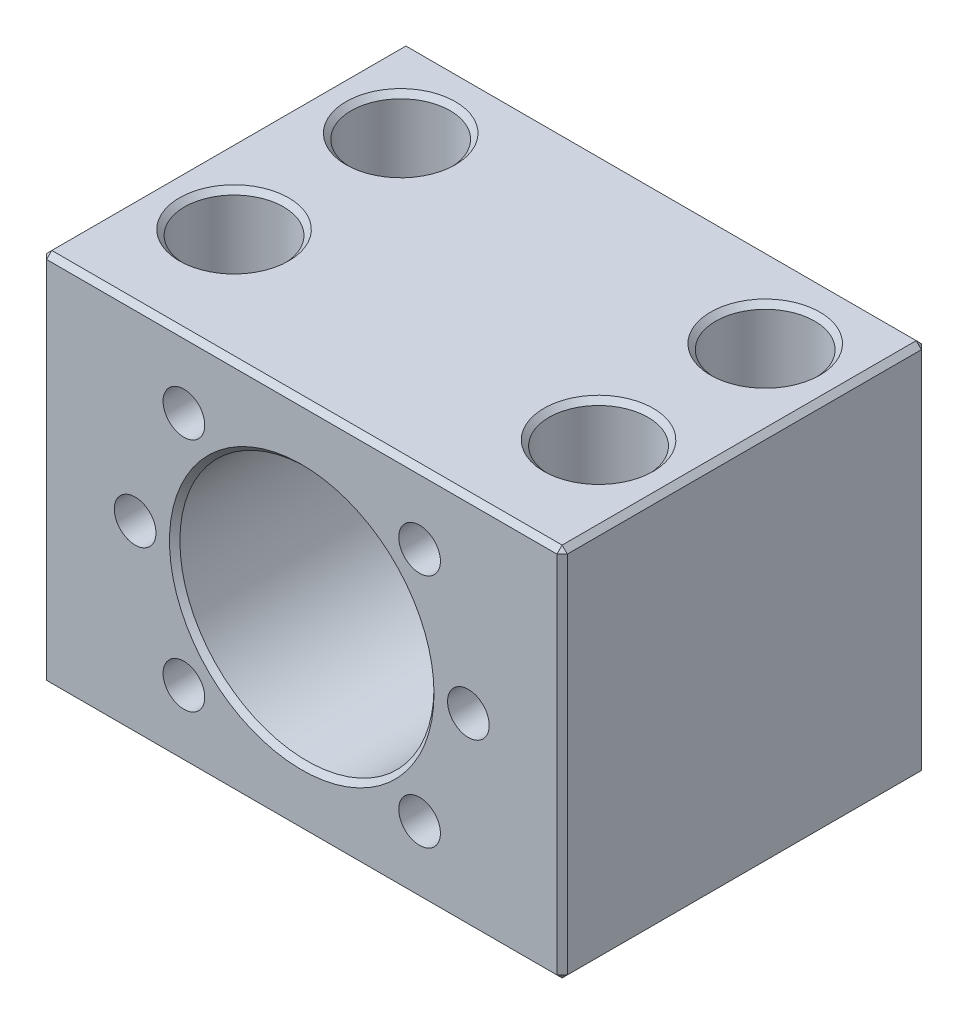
ISO-10303-21;
HEADER;
FILE_DESCRIPTION(('STEP AP214'),'2;1');
FILE_NAME('part.step','',(''),(''),'','','');
FILE_SCHEMA(('AUTOMOTIVE_DESIGN { 1 0 10303 214 1 1 1 1 }'));
ENDSEC;
DATA;
#1=APPLICATION_CONTEXT('core data for automotive mechanical design processes');
#2=APPLICATION_PROTOCOL_DEFINITION('international standard','automotive_design',2000,#1);
#3=PRODUCT_CONTEXT('',#1,'mechanical');
#4=PRODUCT('Part','Part','',(#3));
#5=PRODUCT_RELATED_PRODUCT_CATEGORY('part','',(#4));
#6=PRODUCT_DEFINITION_FORMATION('','',#4);
#7=PRODUCT_DEFINITION_CONTEXT('part definition',#1,'design');
#8=PRODUCT_DEFINITION('design','',#6,#7);
#9=PRODUCT_DEFINITION_SHAPE('','',#8);
#10=(LENGTH_UNIT() NAMED_UNIT(*) SI_UNIT(.MILLI.,.METRE.));
#11=(NAMED_UNIT(*) PLANE_ANGLE_UNIT() SI_UNIT($,.RADIAN.));
#12=(NAMED_UNIT(*) SI_UNIT($,.STERADIAN.) SOLID_ANGLE_UNIT());
#13=UNCERTAINTY_MEASURE_WITH_UNIT(LENGTH_MEASURE(1.E-05),#10,'distance_accuracy_value','');
#14=(GEOMETRIC_REPRESENTATION_CONTEXT(3) GLOBAL_UNCERTAINTY_ASSIGNED_CONTEXT((#13)) GLOBAL_UNIT_ASSIGNED_CONTEXT((#10,
#11,#12)) REPRESENTATION_CONTEXT('',''));
#15=CARTESIAN_POINT('',(0.,0.,0.));
#16=DIRECTION('',(0.,0.,1.));
#17=DIRECTION('',(1.,0.,0.));
#18=AXIS2_PLACEMENT_3D('',#15,#16,#17);
#19=CARTESIAN_POINT('',(-11.3137084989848,11.3137084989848,0.));
#20=DIRECTION('',(0.,0.,-1.));
#21=DIRECTION('',(1.,0.,0.));
#22=AXIS2_PLACEMENT_3D('',#19,#20,#21);
#23=CYLINDRICAL_SURFACE('',#22,2.);
#24=CARTESIAN_POINT('',(-11.3137084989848,11.3137084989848,0.));
#25=DIRECTION('',(0.,0.,-1.));
#26=DIRECTION('',(1.,0.,0.));
#27=AXIS2_PLACEMENT_3D('',#24,#25,#26);
#28=CIRCLE('',#27,2.);
#29=CARTESIAN_POINT('',(-9.31370849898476,11.3137084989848,0.));
#30=VERTEX_POINT('',#29);
#31=CARTESIAN_POINT('',(-13.3137084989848,11.3137084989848,0.));
#32=VERTEX_POINT('',#31);
#33=EDGE_CURVE('E401',#30,#32,#28,.T.);
#34=ORIENTED_EDGE('',*,*,#33,.F.);
#35=CARTESIAN_POINT('',(-11.3137084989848,11.3137084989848,0.));
#36=DIRECTION('',(0.,0.,-1.));
#37=DIRECTION('',(1.,0.,0.));
#38=AXIS2_PLACEMENT_3D('',#35,#36,#37);
#39=CIRCLE('',#38,2.);
#40=EDGE_CURVE('E404',#32,#30,#39,.T.);
#41=ORIENTED_EDGE('',*,*,#40,.F.);
#42=DIRECTION('',(0.,0.,-1.));
#43=VECTOR('',#42,1.);
#44=CARTESIAN_POINT('',(-13.3137084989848,11.3137084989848,0.));
#45=LINE('',#44,#43);
#46=CARTESIAN_POINT('',(-13.3137084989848,11.3137084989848,-8.75557056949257));
#47=VERTEX_POINT('',#46);
#48=EDGE_CURVE('E9',#32,#47,#45,.T.);
#49=ORIENTED_EDGE('',*,*,#48,.T.);
#50=CARTESIAN_POINT('',(-13.3137084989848,11.3137084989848,-8.75557056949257));
#51=CARTESIAN_POINT('',(-13.3137085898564,11.3237663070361,-8.75557041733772));
#52=CARTESIAN_POINT('',(-13.3136326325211,11.3338241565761,-8.75570935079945));
#53=CARTESIAN_POINT('',(-13.3133295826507,11.3539091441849,-8.75626608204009));
#54=CARTESIAN_POINT('',(-13.3131028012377,11.3639363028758,-8.75668330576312));
#55=CARTESIAN_POINT('',(-13.3124994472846,11.3839576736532,-8.75779658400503));
#56=CARTESIAN_POINT('',(-13.312123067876,11.3939519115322,-8.75849227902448));
#57=CARTESIAN_POINT('',(-13.3112220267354,11.4139052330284,-8.76016223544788));
#58=CARTESIAN_POINT('',(-13.3106974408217,11.4238643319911,-8.76113635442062));
#59=CARTESIAN_POINT('',(-13.3095014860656,11.443745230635,-8.76336295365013));
#60=CARTESIAN_POINT('',(-13.3088300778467,11.4536670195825,-8.76461550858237));
#61=CARTESIAN_POINT('',(-13.3073420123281,11.4734712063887,-8.7673987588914));
#62=CARTESIAN_POINT('',(-13.3065252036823,11.483353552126,-8.76892974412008));
#63=CARTESIAN_POINT('',(-13.3047478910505,11.5030768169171,-8.77226964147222));
#64=CARTESIAN_POINT('',(-13.3037871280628,11.5129176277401,-8.77407905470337));
#65=CARTESIAN_POINT('',(-13.3017234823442,11.5325558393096,-8.7779755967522));
#66=CARTESIAN_POINT('',(-13.3006202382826,11.5423530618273,-8.78006343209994));
#67=CARTESIAN_POINT('',(-13.2982732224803,11.5619021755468,-8.78451661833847));
#68=CARTESIAN_POINT('',(-13.2970289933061,11.5716538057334,-8.78688287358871));
#69=CARTESIAN_POINT('',(-13.2944016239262,11.5911098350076,-8.79189269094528));
#70=CARTESIAN_POINT('',(-13.293017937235,11.600813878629,-8.79453734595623));
#71=CARTESIAN_POINT('',(-13.2901132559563,11.6201730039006,-8.80010382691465));
#72=CARTESIAN_POINT('',(-13.2885916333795,11.6298276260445,-8.80302692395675));
#73=CARTESIAN_POINT('',(-13.2854128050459,11.6490857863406,-8.80914992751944));
#74=CARTESIAN_POINT('',(-13.2837548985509,11.6586887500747,-8.81235127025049));
#75=CARTESIAN_POINT('',(-13.2785630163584,11.6875135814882,-8.82240382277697));
#76=CARTESIAN_POINT('',(-13.2748388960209,11.7065653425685,-8.82964997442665));
#77=CARTESIAN_POINT('',(-13.266871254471,11.7444469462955,-8.84524106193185));
#78=CARTESIAN_POINT('',(-13.2626207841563,11.7632691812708,-8.8536008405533));
#79=CARTESIAN_POINT('',(-13.2541034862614,11.798648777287,-8.87045175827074));
#80=CARTESIAN_POINT('',(-13.2498743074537,11.8152549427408,-8.87885970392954));
#81=CARTESIAN_POINT('',(-13.2410836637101,11.8480438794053,-8.89646940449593));
#82=CARTESIAN_POINT('',(-13.2365208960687,11.8642246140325,-8.90567430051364));
#83=CARTESIAN_POINT('',(-13.2270900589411,11.8961601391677,-8.9248758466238));
#84=CARTESIAN_POINT('',(-13.222220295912,11.9119117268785,-8.93487698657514));
#85=CARTESIAN_POINT('',(-13.2122017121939,11.9429876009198,-8.95566986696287));
#86=CARTESIAN_POINT('',(-13.2070509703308,11.9583074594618,-8.96646729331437));
#87=CARTESIAN_POINT('',(-13.1964959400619,11.9885195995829,-8.98885155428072));
#88=CARTESIAN_POINT('',(-13.1910896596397,12.0034062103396,-9.00044509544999));
#89=CARTESIAN_POINT('',(-13.1800483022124,12.0327525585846,-9.02442062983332));
#90=CARTESIAN_POINT('',(-13.1744113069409,12.0472054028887,-9.03681016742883));
#91=CARTESIAN_POINT('',(-13.1629325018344,12.0756858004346,-9.06237691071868));
#92=CARTESIAN_POINT('',(-13.1570889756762,12.0897052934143,-9.07556231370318));
#93=CARTESIAN_POINT('',(-13.1452203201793,12.117321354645,-9.10272019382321));
#94=CARTESIAN_POINT('',(-13.1391937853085,12.1309087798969,-9.11670134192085));
#95=CARTESIAN_POINT('',(-13.1269815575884,12.1576637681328,-9.1454502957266));
#96=CARTESIAN_POINT('',(-13.1207948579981,12.1708212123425,-9.16022707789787));
#97=CARTESIAN_POINT('',(-13.1082839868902,12.1967199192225,-9.1905670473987));
#98=CARTESIAN_POINT('',(-13.1019592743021,12.2094502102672,-9.20613936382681));
#99=CARTESIAN_POINT('',(-13.0891933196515,12.2344988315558,-9.2380703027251));
#100=CARTESIAN_POINT('',(-13.0827520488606,12.2468054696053,-9.25443807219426));
#101=CARTESIAN_POINT('',(-13.0697731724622,12.2710115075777,-9.28795992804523));
#102=CARTESIAN_POINT('',(-13.063236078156,12.2828986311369,-9.30512306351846));
#103=CARTESIAN_POINT('',(-13.0500850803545,12.3062707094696,-9.34023584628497));
#104=CARTESIAN_POINT('',(-13.0434722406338,12.3177429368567,-9.3581943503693));
#105=CARTESIAN_POINT('',(-13.0301883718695,12.3402909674,-9.3948978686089));
#106=CARTESIAN_POINT('',(-13.0235189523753,12.3513537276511,-9.41365146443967));
#107=CARTESIAN_POINT('',(-13.0101406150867,12.373087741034,-9.45194633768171));
#108=CARTESIAN_POINT('',(-13.0034338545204,12.3837457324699,-9.47149588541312));
#109=CARTESIAN_POINT('',(-12.9899959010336,12.4046798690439,-9.51137964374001));
#110=CARTESIAN_POINT('',(-12.983267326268,12.4149427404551,-9.53172167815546));
#111=CARTESIAN_POINT('',(-12.9654695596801,12.4415770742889,-9.58658923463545));
#112=CARTESIAN_POINT('',(-12.9545338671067,12.4573995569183,-9.62142668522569));
#113=CARTESIAN_POINT('',(-12.9332217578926,12.487384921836,-9.6920830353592));
#114=CARTESIAN_POINT('',(-12.9228467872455,12.5015436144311,-9.72790414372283));
#115=CARTESIAN_POINT('',(-12.9027631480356,12.5282809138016,-9.80052283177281));
#116=CARTESIAN_POINT('',(-12.8930579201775,12.5408516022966,-9.83732427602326));
#117=CARTESIAN_POINT('',(-12.8744128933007,12.5644802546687,-9.91190285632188));
#118=CARTESIAN_POINT('',(-12.8654790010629,12.5755268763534,-9.94968505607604));
#119=CARTESIAN_POINT('',(-12.8484608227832,12.5961732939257,-10.0262238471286));
#120=CARTESIAN_POINT('',(-12.8403851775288,12.6057587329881,-10.0649862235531));
#121=CARTESIAN_POINT('',(-12.8251557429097,12.6235427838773,-10.1434848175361));
#122=CARTESIAN_POINT('',(-12.8180134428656,12.631724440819,-10.1832270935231));
#123=CARTESIAN_POINT('',(-12.8047112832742,12.6467549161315,-10.2636853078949));
#124=CARTESIAN_POINT('',(-12.7985657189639,12.6535846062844,-10.3044071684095));
#125=CARTESIAN_POINT('',(-12.7873068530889,12.6659580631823,-10.3868248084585));
#126=CARTESIAN_POINT('',(-12.7822104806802,12.671480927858,-10.4285260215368));
#127=CARTESIAN_POINT('',(-12.7730897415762,12.6812800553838,-10.5129029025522));
#128=CARTESIAN_POINT('',(-12.7690846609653,12.6855340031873,-10.5555832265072));
#129=CARTESIAN_POINT('',(-12.7621765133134,12.6928262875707,-10.6419193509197));
#130=CARTESIAN_POINT('',(-12.759294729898,12.6958412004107,-10.6855788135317));
#131=CARTESIAN_POINT('',(-12.7546547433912,12.7006785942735,-10.7738736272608));
#132=CARTESIAN_POINT('',(-12.752919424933,12.7024768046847,-10.8185114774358));
#133=CARTESIAN_POINT('',(-12.7505825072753,12.704892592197,-10.9087667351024));
#134=CARTESIAN_POINT('',(-12.7500049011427,12.7054851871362,-10.9543854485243));
#135=CARTESIAN_POINT('',(-12.75,12.7054939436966,-11.));
#136=B_SPLINE_CURVE_WITH_KNOTS('',3,(#50,#51,#52,#53,#54,#55,#56,#57,#58,#59,#60,#61,#62,#63,
#64,#65,#66,#67,#68,#69,#70,#71,#72,#73,#74,#75,#76,#77,#78,#79,#80,#81,#82,#83,#84,#85,#86,#87,
#88,#89,#90,#91,#92,#93,#94,#95,#96,#97,#98,#99,#100,#101,#102,#103,#104,#105,#106,#107,#108,
#109,#110,#111,#112,#113,#114,#115,#116,#117,#118,#119,#120,#121,#122,#123,#124,#125,#126,#127,
#128,#129,#130,#131,#132,#133,#134,#135),.UNSPECIFIED.,.F.,.F.,(4,2,2,2,2,2,2,2,2,2,2,2,2,2,2,2,
2,2,2,2,2,2,2,2,2,2,2,2,2,2,2,2,2,2,2,2,2,2,2,2,2,2,4),(0.,0.0301722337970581,
0.0602824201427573,0.0903538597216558,0.120409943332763,0.150474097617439,0.180569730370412,
0.210720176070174,0.240948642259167,0.271278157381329,0.301731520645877,0.332331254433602,
0.363099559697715,0.425222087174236,0.488275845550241,0.545515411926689,0.602991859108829,
0.660819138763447,0.719109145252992,0.777971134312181,0.837511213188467,0.897831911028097,
0.959031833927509,1.02120540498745,1.08444268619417,1.14882927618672,1.21444627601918,
1.28137031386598,1.34967361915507,1.41942413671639,1.49068567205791,1.61001429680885,
1.72963724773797,1.84983492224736,1.97088373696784,2.09305434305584,2.21661003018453,
2.34180535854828,2.46888504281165,2.59808309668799,2.72962223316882,2.86371350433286,
3.0005561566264),.UNSPECIFIED.);
#137=CARTESIAN_POINT('',(-12.75,12.7054939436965,-11.));
#138=VERTEX_POINT('',#137);
#139=EDGE_CURVE('E343',#47,#138,#136,.T.);
#140=ORIENTED_EDGE('',*,*,#139,.T.);
#141=CARTESIAN_POINT('',(-11.3137084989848,11.3137084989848,-11.));
#142=DIRECTION('',(0.,0.,-1.));
#143=DIRECTION('',(1.,0.,0.));
#144=AXIS2_PLACEMENT_3D('',#141,#142,#143);
#145=CIRCLE('',#144,2.);
#146=CARTESIAN_POINT('',(-12.75,9.92192305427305,-11.));
#147=VERTEX_POINT('',#146);
#148=EDGE_CURVE('E298',#138,#147,#145,.T.);
#149=ORIENTED_EDGE('',*,*,#148,.T.);
#150=CARTESIAN_POINT('',(-12.75,9.92192305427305,-11.));
#151=CARTESIAN_POINT('',(-12.7500048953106,9.9219318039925,-10.9543948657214));
#152=CARTESIAN_POINT('',(-12.7505825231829,9.92252442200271,-10.9087855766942));
#153=CARTESIAN_POINT('',(-12.7529194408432,9.92494020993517,-10.8185474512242));
#154=CARTESIAN_POINT('',(-12.7546547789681,9.92673844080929,-10.7739173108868));
#155=CARTESIAN_POINT('',(-12.7592947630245,9.93157583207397,-10.6856362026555));
#156=CARTESIAN_POINT('',(-12.7621765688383,9.93459076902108,-10.6419827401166));
#157=CARTESIAN_POINT('',(-12.7690847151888,9.94188305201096,-10.5556568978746));
#158=CARTESIAN_POINT('',(-12.7730898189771,9.94613702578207,-10.5129808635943));
#159=CARTESIAN_POINT('',(-12.7822105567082,9.95593615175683,-10.4286108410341));
#160=CARTESIAN_POINT('',(-12.7873069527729,9.96145904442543,-10.386912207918));
#161=CARTESIAN_POINT('',(-12.7985658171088,9.9738324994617,-10.3044980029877));
#162=CARTESIAN_POINT('',(-12.8047114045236,9.98066221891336,-10.2637770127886));
#163=CARTESIAN_POINT('',(-12.8180135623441,9.99569269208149,-10.1833188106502));
#164=CARTESIAN_POINT('',(-12.825155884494,10.0038743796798,-10.1435756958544));
#165=CARTESIAN_POINT('',(-12.840385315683,10.0216584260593,-10.0650736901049));
#166=CARTESIAN_POINT('',(-12.8484609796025,10.0312438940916,-10.0263087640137));
#167=CARTESIAN_POINT('',(-12.8654791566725,10.0518903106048,-9.94976314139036));
#168=CARTESIAN_POINT('',(-12.8744130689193,10.0629369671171,-9.91197668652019));
#169=CARTESIAN_POINT('',(-12.8930580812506,10.0865655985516,-9.83738783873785));
#170=CARTESIAN_POINT('',(-12.902763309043,10.0991362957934,-9.80058041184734));
#171=CARTESIAN_POINT('',(-12.9228469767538,10.1258736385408,-9.72794807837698));
#172=CARTESIAN_POINT('',(-12.9332220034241,10.1400324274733,-9.69211933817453));
#173=CARTESIAN_POINT('',(-12.9545339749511,10.1700175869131,-9.62144574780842));
#174=CARTESIAN_POINT('',(-12.9654694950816,10.185839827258,-9.58659872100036));
#175=CARTESIAN_POINT('',(-12.9832625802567,10.2124671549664,-9.53173076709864));
#176=CARTESIAN_POINT('',(-12.989986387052,10.2227226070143,-9.51139760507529));
#177=CARTESIAN_POINT('',(-13.0034158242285,10.2436428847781,-9.47153052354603));
#178=CARTESIAN_POINT('',(-13.0101188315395,10.2542944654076,-9.45198879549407));
#179=CARTESIAN_POINT('',(-13.0234904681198,10.2760164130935,-9.41370830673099));
#180=CARTESIAN_POINT('',(-13.0301569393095,10.287073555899,-9.39496129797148));
#181=CARTESIAN_POINT('',(-13.0434357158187,10.3096112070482,-9.35826974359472));
#182=CARTESIAN_POINT('',(-13.0500464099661,10.3210787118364,-9.34031664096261));
#183=CARTESIAN_POINT('',(-13.063193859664,10.3444422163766,-9.30521343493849));
#184=CARTESIAN_POINT('',(-13.0697295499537,10.3563255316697,-9.28805450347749));
#185=CARTESIAN_POINT('',(-13.0827063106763,10.3805248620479,-9.2545398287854));
#186=CARTESIAN_POINT('',(-13.0891468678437,10.3928286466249,-9.23817506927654));
#187=CARTESIAN_POINT('',(-13.1019120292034,10.4178725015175,-9.20624891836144));
#188=CARTESIAN_POINT('',(-13.1082366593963,10.4306009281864,-9.19067841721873));
#189=CARTESIAN_POINT('',(-13.1207479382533,10.4564968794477,-9.16034084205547));
#190=CARTESIAN_POINT('',(-13.1269351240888,10.4696534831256,-9.14556468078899));
#191=CARTESIAN_POINT('',(-13.1391488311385,10.4964077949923,-9.11681572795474));
#192=CARTESIAN_POINT('',(-13.1451763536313,10.509995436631,-9.10283400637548));
#193=CARTESIAN_POINT('',(-13.1570474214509,10.5376129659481,-9.0756737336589));
#194=CARTESIAN_POINT('',(-13.162892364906,10.5516337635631,-9.06248656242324));
#195=CARTESIAN_POINT('',(-13.1743743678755,10.5801178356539,-9.03691503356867));
#196=CARTESIAN_POINT('',(-13.1800131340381,10.5945731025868,-9.02452253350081));
#197=CARTESIAN_POINT('',(-13.1910583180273,10.6239253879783,-9.00053981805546));
#198=CARTESIAN_POINT('',(-13.1964666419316,10.6388155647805,-8.98894211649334));
#199=CARTESIAN_POINT('',(-13.2070259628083,10.6690359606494,-8.96654828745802));
#200=CARTESIAN_POINT('',(-13.2121789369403,10.6843605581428,-8.95574551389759));
#201=CARTESIAN_POINT('',(-13.2222020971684,10.7154470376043,-8.93494064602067));
#202=CARTESIAN_POINT('',(-13.2270741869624,10.7312045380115,-8.92493292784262));
#203=CARTESIAN_POINT('',(-13.2365097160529,10.7631531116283,-8.90571709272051));
#204=CARTESIAN_POINT('',(-13.2410748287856,10.7793410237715,-8.89650454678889));
#205=CARTESIAN_POINT('',(-13.2498700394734,10.8121452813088,-8.878877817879));
#206=CARTESIAN_POINT('',(-13.254101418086,10.8287596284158,-8.87046055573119));
#207=CARTESIAN_POINT('',(-13.2626181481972,10.8641368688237,-8.85360087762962));
#208=CARTESIAN_POINT('',(-13.2668662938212,10.8829480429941,-8.845240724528));
#209=CARTESIAN_POINT('',(-13.274830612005,10.9208107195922,-8.82964932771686));
#210=CARTESIAN_POINT('',(-13.278553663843,10.9398546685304,-8.82240334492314));
#211=CARTESIAN_POINT('',(-13.2837445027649,10.968668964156,-8.81235116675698));
#212=CARTESIAN_POINT('',(-13.2854022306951,10.9782691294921,-8.80914982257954));
#213=CARTESIAN_POINT('',(-13.2885809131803,10.9975224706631,-8.8030268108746));
#214=CARTESIAN_POINT('',(-13.2901025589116,11.0071750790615,-8.80010372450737));
#215=CARTESIAN_POINT('',(-13.2930074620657,11.0265309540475,-8.79453724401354));
#216=CARTESIAN_POINT('',(-13.2943913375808,11.0362337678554,-8.7918925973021));
#217=CARTESIAN_POINT('',(-13.2970192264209,11.0556881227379,-8.7868827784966));
#218=CARTESIAN_POINT('',(-13.2982637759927,11.0654393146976,-8.78451653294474));
#219=CARTESIAN_POINT('',(-13.3006115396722,11.0849883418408,-8.78006334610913));
#220=CARTESIAN_POINT('',(-13.3017152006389,11.0947859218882,-8.77797552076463));
#221=CARTESIAN_POINT('',(-13.3037797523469,11.1144256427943,-8.77407897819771));
#222=CARTESIAN_POINT('',(-13.3047409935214,11.1242676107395,-8.77226957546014));
#223=CARTESIAN_POINT('',(-13.3065192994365,11.1439939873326,-8.76892967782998));
#224=CARTESIAN_POINT('',(-13.3073366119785,11.1538782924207,-8.76739870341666));
#225=CARTESIAN_POINT('',(-13.3088256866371,11.1736871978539,-8.7646154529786));
#226=CARTESIAN_POINT('',(-13.3094975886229,11.1836117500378,-8.76336290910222));
#227=CARTESIAN_POINT('',(-13.3106944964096,11.2034989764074,-8.76113630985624));
#228=CARTESIAN_POINT('',(-13.3112195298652,11.2134616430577,-8.7601622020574));
#229=CARTESIAN_POINT('',(-13.3121213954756,11.2334229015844,-8.75849224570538));
#230=CARTESIAN_POINT('',(-13.3124981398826,11.2434215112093,-8.75779656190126));
#231=CARTESIAN_POINT('',(-13.3131021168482,11.2634524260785,-8.75668328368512));
#232=CARTESIAN_POINT('',(-13.3133291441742,11.2734847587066,-8.75626607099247));
#233=CARTESIAN_POINT('',(-13.3136325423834,11.2935808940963,-8.7557093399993));
#234=CARTESIAN_POINT('',(-13.3137085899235,11.3036447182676,-8.75557041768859));
#235=CARTESIAN_POINT('',(-13.3137084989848,11.3137084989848,-8.75557056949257));
#236=B_SPLINE_CURVE_WITH_KNOTS('',3,(#150,#151,#152,#153,#154,#155,#156,#157,#158,#159,#160,
#161,#162,#163,#164,#165,#166,#167,#168,#169,#170,#171,#172,#173,#174,#175,#176,#177,#178,#179,
#180,#181,#182,#183,#184,#185,#186,#187,#188,#189,#190,#191,#192,#193,#194,#195,#196,#197,#198,
#199,#200,#201,#202,#203,#204,#205,#206,#207,#208,#209,#210,#211,#212,#213,#214,#215,#216,#217,
#218,#219,#220,#221,#222,#223,#224,#225,#226,#227,#228,#229,#230,#231,#232,#233,#234,#235),
.UNSPECIFIED.,.F.,.F.,(4,2,2,2,2,2,2,2,2,2,2,2,2,2,2,2,2,2,2,2,2,2,2,2,2,2,2,2,2,2,2,2,2,2,2,2,
2,2,2,2,2,2,4),(0.,0.136814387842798,0.270882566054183,0.402403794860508,0.531589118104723,
0.658661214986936,0.783854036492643,0.907412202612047,1.02959014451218,1.15065098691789,
1.27086517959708,1.39050890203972,1.50986228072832,1.58108735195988,1.6508060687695,
1.71908231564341,1.78598410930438,1.85158374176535,1.91595789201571,1.97918769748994,
2.04135877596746,2.10256118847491,2.16288933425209,2.22244177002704,2.28132094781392,
2.3396328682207,2.39748664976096,2.45499401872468,2.51226872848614,2.57529178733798,
2.63739192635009,2.66815228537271,2.69874629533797,2.72919619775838,2.75952455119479,
2.78975418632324,2.81990815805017,2.85000969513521,2.8800821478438,2.91014893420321,
2.94023348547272,2.97035919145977,3.00054934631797),.UNSPECIFIED.);
#237=EDGE_CURVE('E595',#147,#47,#236,.T.);
#238=ORIENTED_EDGE('',*,*,#237,.T.);
#239=ORIENTED_EDGE('',*,*,#48,.F.);
#240=EDGE_LOOP('',(#34,#41,#49,#140,#149,#238,#239));
#241=FACE_BOUND('',#240,.T.);
#242=ADVANCED_FACE('F15',(#241),#23,.F.);
#243=CARTESIAN_POINT('',(-11.3137084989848,-11.3137084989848,-11.));
#244=DIRECTION('',(0.,0.,1.));
#245=DIRECTION('',(1.,0.,0.));
#246=AXIS2_PLACEMENT_3D('',#243,#244,#245);
#247=PLANE('',#246);
#248=CARTESIAN_POINT('',(-11.3137084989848,-11.3137084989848,-11.));
#249=DIRECTION('',(0.,0.,-1.));
#250=DIRECTION('',(1.,0.,0.));
#251=AXIS2_PLACEMENT_3D('',#248,#249,#250);
#252=CIRCLE('',#251,2.);
#253=CARTESIAN_POINT('',(-9.31370849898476,-11.3137084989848,-11.));
#254=VERTEX_POINT('',#253);
#255=CARTESIAN_POINT('',(-13.3137084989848,-11.3137084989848,-11.));
#256=VERTEX_POINT('',#255);
#257=EDGE_CURVE('E28',#254,#256,#252,.T.);
#258=ORIENTED_EDGE('',*,*,#257,.F.);
#259=CARTESIAN_POINT('',(-11.3137084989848,-11.3137084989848,-11.));
#260=DIRECTION('',(0.,0.,-1.));
#261=DIRECTION('',(1.,0.,0.));
#262=AXIS2_PLACEMENT_3D('',#259,#260,#261);
#263=CIRCLE('',#262,2.);
#264=EDGE_CURVE('E143',#256,#254,#263,.T.);
#265=ORIENTED_EDGE('',*,*,#264,.F.);
#266=EDGE_LOOP('',(#258,#265));
#267=FACE_BOUND('',#266,.T.);
#268=ADVANCED_FACE('F391',(#267),#247,.T.);
#269=CARTESIAN_POINT('',(-11.3137084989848,-11.3137084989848,0.));
#270=DIRECTION('',(0.,0.,-1.));
#271=DIRECTION('',(1.,0.,0.));
#272=AXIS2_PLACEMENT_3D('',#269,#270,#271);
#273=CYLINDRICAL_SURFACE('',#272,2.);
#274=CARTESIAN_POINT('',(-11.3137084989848,-11.3137084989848,0.));
#275=DIRECTION('',(0.,0.,-1.));
#276=DIRECTION('',(1.,0.,0.));
#277=AXIS2_PLACEMENT_3D('',#274,#275,#276);
#278=CIRCLE('',#277,2.);
#279=CARTESIAN_POINT('',(-9.31370849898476,-11.3137084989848,0.));
#280=VERTEX_POINT('',#279);
#281=CARTESIAN_POINT('',(-13.3137084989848,-11.3137084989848,0.));
#282=VERTEX_POINT('',#281);
#283=EDGE_CURVE('E419',#280,#282,#278,.T.);
#284=ORIENTED_EDGE('',*,*,#283,.F.);
#285=CARTESIAN_POINT('',(-11.3137084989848,-11.3137084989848,0.));
#286=DIRECTION('',(0.,0.,-1.));
#287=DIRECTION('',(1.,0.,0.));
#288=AXIS2_PLACEMENT_3D('',#285,#286,#287);
#289=CIRCLE('',#288,2.);
#290=EDGE_CURVE('E410',#282,#280,#289,.T.);
#291=ORIENTED_EDGE('',*,*,#290,.F.);
#292=DIRECTION('',(0.,0.,-1.));
#293=VECTOR('',#292,1.);
#294=CARTESIAN_POINT('',(-13.3137084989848,-11.3137084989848,0.));
#295=LINE('',#294,#293);
#296=EDGE_CURVE('E124',#282,#256,#295,.T.);
#297=ORIENTED_EDGE('',*,*,#296,.T.);
#298=ORIENTED_EDGE('',*,*,#264,.T.);
#299=ORIENTED_EDGE('',*,*,#257,.T.);
#300=ORIENTED_EDGE('',*,*,#296,.F.);
#301=EDGE_LOOP('',(#284,#291,#297,#298,#299,#300));
#302=FACE_BOUND('',#301,.T.);
#303=ADVANCED_FACE('F395',(#302),#273,.F.);
#304=CARTESIAN_POINT('',(11.3137084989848,-11.3137084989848,-11.));
#305=DIRECTION('',(0.,0.,1.));
#306=DIRECTION('',(1.,0.,0.));
#307=AXIS2_PLACEMENT_3D('',#304,#305,#306);
#308=PLANE('',#307);
#309=CARTESIAN_POINT('',(11.3137084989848,-11.3137084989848,-11.));
#310=DIRECTION('',(0.,0.,-1.));
#311=DIRECTION('',(1.,0.,0.));
#312=AXIS2_PLACEMENT_3D('',#309,#310,#311);
#313=CIRCLE('',#312,2.);
#314=CARTESIAN_POINT('',(13.3137084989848,-11.3137084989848,-11.));
#315=VERTEX_POINT('',#314);
#316=CARTESIAN_POINT('',(9.3137084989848,-11.3137084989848,-11.));
#317=VERTEX_POINT('',#316);
#318=EDGE_CURVE('E116',#315,#317,#313,.T.);
#319=ORIENTED_EDGE('',*,*,#318,.F.);
#320=CARTESIAN_POINT('',(11.3137084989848,-11.3137084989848,-11.));
#321=DIRECTION('',(0.,0.,-1.));
#322=DIRECTION('',(1.,0.,0.));
#323=AXIS2_PLACEMENT_3D('',#320,#321,#322);
#324=CIRCLE('',#323,2.);
#325=EDGE_CURVE('E119',#317,#315,#324,.T.);
#326=ORIENTED_EDGE('',*,*,#325,.F.);
#327=EDGE_LOOP('',(#319,#326));
#328=FACE_BOUND('',#327,.T.);
#329=ADVANCED_FACE('F118',(#328),#308,.T.);
#330=CARTESIAN_POINT('',(11.3137084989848,-11.3137084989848,0.));
#331=DIRECTION('',(0.,0.,-1.));
#332=DIRECTION('',(1.,0.,0.));
#333=AXIS2_PLACEMENT_3D('',#330,#331,#332);
#334=CYLINDRICAL_SURFACE('',#333,2.);
#335=CARTESIAN_POINT('',(11.3137084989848,-11.3137084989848,0.));
#336=DIRECTION('',(0.,0.,-1.));
#337=DIRECTION('',(1.,0.,0.));
#338=AXIS2_PLACEMENT_3D('',#335,#336,#337);
#339=CIRCLE('',#338,2.);
#340=CARTESIAN_POINT('',(13.3137084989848,-11.3137084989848,0.));
#341=VERTEX_POINT('',#340);
#342=CARTESIAN_POINT('',(9.3137084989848,-11.3137084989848,0.));
#343=VERTEX_POINT('',#342);
#344=EDGE_CURVE('E464',#341,#343,#339,.T.);
#345=ORIENTED_EDGE('',*,*,#344,.F.);
#346=CARTESIAN_POINT('',(11.3137084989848,-11.3137084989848,0.));
#347=DIRECTION('',(0.,0.,-1.));
#348=DIRECTION('',(1.,0.,0.));
#349=AXIS2_PLACEMENT_3D('',#346,#347,#348);
#350=CIRCLE('',#349,2.);
#351=EDGE_CURVE('E468',#343,#341,#350,.T.);
#352=ORIENTED_EDGE('',*,*,#351,.F.);
#353=DIRECTION('',(0.,0.,-1.));
#354=VECTOR('',#353,1.);
#355=CARTESIAN_POINT('',(9.3137084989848,-11.3137084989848,0.));
#356=LINE('',#355,#354);
#357=EDGE_CURVE('E129',#343,#317,#356,.T.);
#358=ORIENTED_EDGE('',*,*,#357,.T.);
#359=ORIENTED_EDGE('',*,*,#325,.T.);
#360=ORIENTED_EDGE('',*,*,#318,.T.);
#361=ORIENTED_EDGE('',*,*,#357,.F.);
#362=EDGE_LOOP('',(#345,#352,#358,#359,#360,#361));
#363=FACE_BOUND('',#362,.T.);
#364=ADVANCED_FACE('F127',(#363),#334,.F.);
#365=CARTESIAN_POINT('',(11.3137084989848,11.3137084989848,0.));
#366=DIRECTION('',(0.,0.,-1.));
#367=DIRECTION('',(1.,0.,0.));
#368=AXIS2_PLACEMENT_3D('',#365,#366,#367);
#369=CYLINDRICAL_SURFACE('',#368,2.);
#370=CARTESIAN_POINT('',(11.3137084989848,11.3137084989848,0.));
#371=DIRECTION('',(0.,0.,-1.));
#372=DIRECTION('',(1.,0.,0.));
#373=AXIS2_PLACEMENT_3D('',#370,#371,#372);
#374=CIRCLE('',#373,2.);
#375=CARTESIAN_POINT('',(13.3137084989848,11.3137084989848,0.));
#376=VERTEX_POINT('',#375);
#377=CARTESIAN_POINT('',(9.3137084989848,11.3137084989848,0.));
#378=VERTEX_POINT('',#377);
#379=EDGE_CURVE('E452',#376,#378,#374,.T.);
#380=ORIENTED_EDGE('',*,*,#379,.F.);
#381=CARTESIAN_POINT('',(11.3137084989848,11.3137084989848,0.));
#382=DIRECTION('',(0.,0.,-1.));
#383=DIRECTION('',(1.,0.,0.));
#384=AXIS2_PLACEMENT_3D('',#381,#382,#383);
#385=CIRCLE('',#384,2.);
#386=EDGE_CURVE('E285',#378,#376,#385,.T.);
#387=ORIENTED_EDGE('',*,*,#386,.F.);
#388=DIRECTION('',(0.,0.,-1.));
#389=VECTOR('',#388,1.);
#390=CARTESIAN_POINT('',(9.3137084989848,11.3137084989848,0.));
#391=LINE('',#390,#389);
#392=CARTESIAN_POINT('',(9.3137084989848,11.3137084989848,-11.));
#393=VERTEX_POINT('',#392);
#394=EDGE_CURVE('E136',#378,#393,#391,.T.);
#395=ORIENTED_EDGE('',*,*,#394,.T.);
#396=CARTESIAN_POINT('',(11.3137084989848,11.3137084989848,-11.));
#397=DIRECTION('',(0.,0.,-1.));
#398=DIRECTION('',(1.,0.,0.));
#399=AXIS2_PLACEMENT_3D('',#396,#397,#398);
#400=CIRCLE('',#399,2.);
#401=CARTESIAN_POINT('',(12.75,12.7054939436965,-11.));
#402=VERTEX_POINT('',#401);
#403=EDGE_CURVE('E281',#393,#402,#400,.T.);
#404=ORIENTED_EDGE('',*,*,#403,.T.);
#405=CARTESIAN_POINT('',(12.75,12.7054939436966,-11.));
#406=CARTESIAN_POINT('',(12.750004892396,12.7054851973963,-10.9543995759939));
#407=CARTESIAN_POINT('',(12.7505825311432,12.7048925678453,-10.9087950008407));
#408=CARTESIAN_POINT('',(12.7529194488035,12.7024767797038,-10.8185654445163));
#409=CARTESIAN_POINT('',(12.7546547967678,12.7006785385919,-10.7739391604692));
#410=CARTESIAN_POINT('',(12.759294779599,12.6958411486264,-10.6856649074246));
#411=CARTESIAN_POINT('',(12.7621765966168,12.6928261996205,-10.64201444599));
#412=CARTESIAN_POINT('',(12.7690847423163,12.6855339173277,-10.5556937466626));
#413=CARTESIAN_POINT('',(12.7730898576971,12.6812799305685,-10.5130198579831));
#414=CARTESIAN_POINT('',(12.7822105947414,12.6714808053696,-10.4286532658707));
#415=CARTESIAN_POINT('',(12.7873070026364,12.6659578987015,-10.3869559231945));
#416=CARTESIAN_POINT('',(12.7985658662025,12.6535844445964,-10.3045434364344));
#417=CARTESIAN_POINT('',(12.8047114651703,12.6467547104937,-10.2638228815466));
#418=CARTESIAN_POINT('',(12.8180136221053,12.631724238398,-10.1833646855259));
#419=CARTESIAN_POINT('',(12.8251559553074,12.6235425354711,-10.1436211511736));
#420=CARTESIAN_POINT('',(12.8403853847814,12.6057584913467,-10.0651174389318));
#421=CARTESIAN_POINT('',(12.8484610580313,12.596173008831,-10.0263512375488));
#422=CARTESIAN_POINT('',(12.8654792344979,12.5755265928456,-9.94980219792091));
#423=CARTESIAN_POINT('',(12.8744131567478,12.5644799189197,-9.9120136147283));
#424=CARTESIAN_POINT('',(12.8930581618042,12.5408512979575,-9.83741963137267));
#425=CARTESIAN_POINT('',(12.9027633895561,12.528280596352,-9.80060921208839));
#426=CARTESIAN_POINT('',(12.9228470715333,12.5015432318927,-9.72797005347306));
#427=CARTESIAN_POINT('',(12.9332221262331,12.487384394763,-9.69213749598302));
#428=CARTESIAN_POINT('',(12.9545340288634,12.4573993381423,-9.62145528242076));
#429=CARTESIAN_POINT('',(12.9654694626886,12.4415772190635,-9.58660346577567));
#430=CARTESIAN_POINT('',(12.9832602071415,12.4149533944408,-9.53173531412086));
#431=CARTESIAN_POINT('',(12.9899816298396,12.4047016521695,-9.51140659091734));
#432=CARTESIAN_POINT('',(13.0034068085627,12.3837883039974,-9.47154785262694));
#433=CARTESIAN_POINT('',(13.0101079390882,12.3731399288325,-9.45201003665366));
#434=CARTESIAN_POINT('',(13.0234762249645,12.3514240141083,-9.41373674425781));
#435=CARTESIAN_POINT('',(13.0301412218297,12.340369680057,-9.39499303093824));
#436=CARTESIAN_POINT('',(13.0434174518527,12.3178372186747,-9.35830746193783));
#437=CARTESIAN_POINT('',(13.0500270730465,12.3063720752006,-9.34035706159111));
#438=CARTESIAN_POINT('',(13.0631727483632,12.2830128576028,-9.30525864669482));
#439=CARTESIAN_POINT('',(13.0697077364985,12.2711314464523,-9.28810181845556));
#440=CARTESIAN_POINT('',(13.0826834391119,12.2469354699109,-9.25459073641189));
#441=CARTESIAN_POINT('',(13.0891236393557,12.2346331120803,-9.23822748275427));
#442=CARTESIAN_POINT('',(13.1018884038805,12.2095916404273,-9.20630372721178));
#443=CARTESIAN_POINT('',(13.1082129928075,12.1968641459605,-9.19073413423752));
#444=CARTESIAN_POINT('',(13.120724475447,12.1709695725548,-9.16039775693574));
#445=CARTESIAN_POINT('',(13.1269119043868,12.1578133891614,-9.14562190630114));
#446=CARTESIAN_POINT('',(13.1391263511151,12.1310594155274,-9.11687295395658));
#447=CARTESIAN_POINT('',(13.1451543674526,12.1174716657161,-9.10289094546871));
#448=CARTESIAN_POINT('',(13.1570266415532,12.0898534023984,-9.07572947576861));
#449=CARTESIAN_POINT('',(13.1628722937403,12.0758319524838,-9.06254141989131));
#450=CARTESIAN_POINT('',(13.1743558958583,12.0473460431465,-9.03696749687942));
#451=CARTESIAN_POINT('',(13.1799955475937,12.032889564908,-9.02457351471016));
#452=CARTESIAN_POINT('',(13.1910426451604,12.0035343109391,-9.00058720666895));
#453=CARTESIAN_POINT('',(13.1964519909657,11.9886423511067,-8.98898742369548));
#454=CARTESIAN_POINT('',(13.2070134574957,11.9584178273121,-8.96658880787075));
#455=CARTESIAN_POINT('',(13.2121675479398,11.9430908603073,-8.95578335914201));
#456=CARTESIAN_POINT('',(13.2221929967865,11.9119990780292,-8.93497249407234));
#457=CARTESIAN_POINT('',(13.2270662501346,11.8962386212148,-8.92496148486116));
#458=CARTESIAN_POINT('',(13.2365041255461,11.8642835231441,-8.90573850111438));
#459=CARTESIAN_POINT('',(13.2410704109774,11.8480920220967,-8.89652212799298));
#460=CARTESIAN_POINT('',(13.2498679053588,11.815280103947,-8.87888688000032));
#461=CARTESIAN_POINT('',(13.2541003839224,11.7986616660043,-8.87046495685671));
#462=CARTESIAN_POINT('',(13.2626168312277,11.763285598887,-8.85360089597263));
#463=CARTESIAN_POINT('',(13.2668638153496,11.7444799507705,-8.84524055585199));
#464=CARTESIAN_POINT('',(13.2748264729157,11.7066267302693,-8.82964900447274));
#465=CARTESIAN_POINT('',(13.2785489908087,11.6875866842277,-8.8224031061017));
#466=CARTESIAN_POINT('',(13.2837393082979,11.6587776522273,-8.81235111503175));
#467=CARTESIAN_POINT('',(13.2853969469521,11.6491788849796,-8.80914977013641));
#468=CARTESIAN_POINT('',(13.2885755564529,11.6299279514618,-8.80302675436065));
#469=CARTESIAN_POINT('',(13.2900972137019,11.6202763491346,-8.80010367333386));
#470=CARTESIAN_POINT('',(13.2930022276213,11.6009220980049,-8.79453719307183));
#471=CARTESIAN_POINT('',(13.2943861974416,11.591219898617,-8.79189255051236));
#472=CARTESIAN_POINT('',(13.2970143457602,11.5717663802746,-8.78688273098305));
#473=CARTESIAN_POINT('',(13.2982590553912,11.5620154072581,-8.78451649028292));
#474=CARTESIAN_POINT('',(13.3006071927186,11.5424664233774,-8.78006330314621));
#475=CARTESIAN_POINT('',(13.301711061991,11.5326686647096,-8.77797548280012));
#476=CARTESIAN_POINT('',(13.3037760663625,11.5130281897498,-8.77407893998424));
#477=CARTESIAN_POINT('',(13.3047375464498,11.503185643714,-8.7722695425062));
#478=CARTESIAN_POINT('',(13.3065163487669,11.4834577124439,-8.76892964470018));
#479=CARTESIAN_POINT('',(13.3073339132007,11.4735724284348,-8.76739867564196));
#480=CARTESIAN_POINT('',(13.3088234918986,11.4537611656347,-8.76461542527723));
#481=CARTESIAN_POINT('',(13.3094956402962,11.443835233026,-8.76336288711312));
#482=CARTESIAN_POINT('',(13.3106930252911,11.4239448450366,-8.7611362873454));
#483=CARTESIAN_POINT('',(13.311218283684,11.4139803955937,-8.76016218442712));
#484=CARTESIAN_POINT('',(13.3121205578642,11.3940151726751,-8.75849223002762));
#485=CARTESIAN_POINT('',(13.3124974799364,11.3840143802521,-8.75779655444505));
#486=CARTESIAN_POINT('',(13.3131017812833,11.3639786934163,-8.75668326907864));
#487=CARTESIAN_POINT('',(13.3133289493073,11.3539437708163,-8.75626605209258));
#488=CARTESIAN_POINT('',(13.3136324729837,11.3338420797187,-8.75570934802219));
#489=CARTESIAN_POINT('',(13.3137084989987,11.3237752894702,-8.75557046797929));
#490=CARTESIAN_POINT('',(13.3137084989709,11.3036536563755,-8.75557067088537));
#491=CARTESIAN_POINT('',(13.3136326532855,11.2935988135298,-8.75570942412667));
#492=CARTESIAN_POINT('',(13.3133298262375,11.273519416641,-8.75626601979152));
#493=CARTESIAN_POINT('',(13.3131031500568,11.2634948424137,-8.7566832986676));
#494=CARTESIAN_POINT('',(13.3125000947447,11.2434782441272,-8.7577966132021));
#495=CARTESIAN_POINT('',(13.3121239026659,11.2334861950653,-8.75849230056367));
#496=CARTESIAN_POINT('',(13.3112232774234,11.2135368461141,-8.76016224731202));
#497=CARTESIAN_POINT('',(13.3106989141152,11.2035795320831,-8.76113637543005));
#498=CARTESIAN_POINT('',(13.3095034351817,11.1837017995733,-8.76336297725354));
#499=CARTESIAN_POINT('',(13.3088322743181,11.1737813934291,-8.76461553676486));
#500=CARTESIAN_POINT('',(13.3073447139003,11.1539795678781,-8.76739878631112));
#501=CARTESIAN_POINT('',(13.3065281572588,11.1440982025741,-8.76892977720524));
#502=CARTESIAN_POINT('',(13.3047513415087,11.124376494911,-8.77226967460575));
#503=CARTESIAN_POINT('',(13.3037908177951,11.1145362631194,-8.77407909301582));
#504=CARTESIAN_POINT('',(13.3017276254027,11.0948988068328,-8.77797563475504));
#505=CARTESIAN_POINT('',(13.3006245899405,11.0851017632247,-8.78006347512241));
#506=CARTESIAN_POINT('',(13.2982779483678,11.0655526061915,-8.78451666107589));
#507=CARTESIAN_POINT('',(13.2970338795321,11.0558007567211,-8.78688292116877));
#508=CARTESIAN_POINT('',(13.2944067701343,11.0363438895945,-8.79189273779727));
#509=CARTESIAN_POINT('',(13.2930231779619,11.0266392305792,-8.79453739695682));
#510=CARTESIAN_POINT('',(13.2901186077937,11.007278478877,-8.80010387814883));
#511=CARTESIAN_POINT('',(13.2885969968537,10.9976228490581,-8.80302698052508));
#512=CARTESIAN_POINT('',(13.2854180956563,10.9783622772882,-8.80914998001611));
#513=CARTESIAN_POINT('',(13.2837600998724,10.9687579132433,-8.81235132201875));
#514=CARTESIAN_POINT('',(13.2785676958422,10.9399278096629,-8.82240406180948));
#515=CARTESIAN_POINT('',(13.2748430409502,10.9208721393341,-8.82965029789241));
#516=CARTESIAN_POINT('',(13.2668737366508,10.8829810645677,-8.84524123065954));
#517=CARTESIAN_POINT('',(13.2626221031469,10.8641532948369,-8.85360082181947));
#518=CARTESIAN_POINT('',(13.2541045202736,10.8287725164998,-8.87044736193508));
#519=CARTESIAN_POINT('',(13.2498764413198,10.812170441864,-8.87885065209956));
#520=CARTESIAN_POINT('',(13.2410880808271,10.7793891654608,-8.89645184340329));
#521=CARTESIAN_POINT('',(13.2365264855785,10.763212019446,-8.90565291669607));
#522=CARTESIAN_POINT('',(13.2270979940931,10.7312830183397,-8.92484732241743));
#523=CARTESIAN_POINT('',(13.2222293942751,10.7155343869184,-8.93484517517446));
#524=CARTESIAN_POINT('',(13.2122130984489,10.6844638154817,-8.95563206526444));
#525=CARTESIAN_POINT('',(13.2070634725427,10.66914632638,-8.96642681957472));
#526=CARTESIAN_POINT('',(13.1965105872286,10.6389383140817,-8.98880629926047));
#527=CARTESIAN_POINT('',(13.1911053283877,10.6240534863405,-9.00039776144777));
#528=CARTESIAN_POINT('',(13.1800658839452,10.5947101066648,-9.02436970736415));
#529=CARTESIAN_POINT('',(13.1744297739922,10.5802584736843,-9.03675776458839));
#530=CARTESIAN_POINT('',(13.1629525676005,10.551779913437,-9.06232211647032));
#531=CARTESIAN_POINT('',(13.1571097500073,10.5377610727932,-9.07550663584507));
#532=CARTESIAN_POINT('',(13.1452423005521,10.5101457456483,-9.1026633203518));
#533=CARTESIAN_POINT('',(13.1392162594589,10.4965584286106,-9.11664418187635));
#534=CARTESIAN_POINT('',(13.1270047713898,10.469803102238,-9.14539313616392));
#535=CARTESIAN_POINT('',(13.1208183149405,10.456645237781,-9.16017022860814));
#536=CARTESIAN_POINT('',(13.1083076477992,10.4307451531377,-9.19051139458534));
#537=CARTESIAN_POINT('',(13.1019828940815,10.4180139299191,-9.2060846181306));
#538=CARTESIAN_POINT('',(13.089216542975,10.3929629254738,-9.23801794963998));
#539=CARTESIAN_POINT('',(13.0827749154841,10.3806548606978,-9.25438722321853));
#540=CARTESIAN_POINT('',(13.0697949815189,10.3564454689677,-9.28791266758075));
#541=CARTESIAN_POINT('',(13.0632571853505,10.3445564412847,-9.30507790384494));
#542=CARTESIAN_POINT('',(13.0501044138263,10.3211800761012,-9.34019547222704));
#543=CARTESIAN_POINT('',(13.0434905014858,10.3097054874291,-9.35815667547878));
#544=CARTESIAN_POINT('',(13.0302040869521,10.2871522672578,-9.39486617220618));
#545=CARTESIAN_POINT('',(13.0235331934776,10.2760866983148,-9.41362305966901));
#546=CARTESIAN_POINT('',(13.0101515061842,10.2543466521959,-9.45192512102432));
#547=CARTESIAN_POINT('',(13.0034428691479,10.2436854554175,-9.47147857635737));
#548=CARTESIAN_POINT('',(12.9900006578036,10.222744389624,-9.51137066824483));
#549=CARTESIAN_POINT('',(12.9832696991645,10.2124778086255,-9.53171713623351));
#550=CARTESIAN_POINT('',(12.9654695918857,10.1858399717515,-9.58658449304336));
#551=CARTESIAN_POINT('',(12.9545338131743,10.1700173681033,-9.62141715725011));
#552=CARTESIAN_POINT('',(12.9332216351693,10.1400319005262,-9.69206489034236));
#553=CARTESIAN_POINT('',(12.9228466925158,10.1258732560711,-9.72788218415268));
#554=CARTESIAN_POINT('',(12.9027630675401,10.0991359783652,-9.80049405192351));
#555=CARTESIAN_POINT('',(12.8930578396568,10.0865652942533,-9.83729250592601));
#556=CARTESIAN_POINT('',(12.8744128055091,10.0629366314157,-9.91186595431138));
#557=CARTESIAN_POINT('',(12.8654789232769,10.0518900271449,-9.9496460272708));
#558=CARTESIAN_POINT('',(12.848460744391,10.0312436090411,-10.0261814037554));
#559=CARTESIAN_POINT('',(12.8403851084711,10.0216581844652,-10.0649425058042));
#560=CARTESIAN_POINT('',(12.8251556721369,10.0038741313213,-10.1434393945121));
#561=CARTESIAN_POINT('',(12.8180133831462,9.99569248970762,-10.1831812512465));
#562=CARTESIAN_POINT('',(12.8047112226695,9.98066201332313,-10.263639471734));
#563=CARTESIAN_POINT('',(12.7985656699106,9.973832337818,-10.3043617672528));
#564=CARTESIAN_POINT('',(12.7873068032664,9.9614588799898,-10.3867811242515));
#565=CARTESIAN_POINT('',(12.7822104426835,9.95593602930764,-10.4284836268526));
#566=CARTESIAN_POINT('',(12.7730897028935,9.94613690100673,-10.5128639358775));
#567=CARTESIAN_POINT('',(12.7690846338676,9.94188296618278,-10.5555464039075));
#568=CARTESIAN_POINT('',(12.7621764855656,9.93459068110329,-10.6418876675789));
#569=CARTESIAN_POINT('',(12.7592947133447,9.93157578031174,-10.6855501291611));
#570=CARTESIAN_POINT('',(12.7546547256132,9.92673838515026,-10.7738517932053));
#571=CARTESIAN_POINT('',(12.7529194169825,9.92494018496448,-10.8184934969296));
#572=CARTESIAN_POINT('',(12.7505824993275,9.92252439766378,-10.9087573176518));
#573=CARTESIAN_POINT('',(12.75000490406,9.92193181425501,-10.9543807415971));
#574=CARTESIAN_POINT('',(12.75,9.92192305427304,-11.));
#575=B_SPLINE_CURVE_WITH_KNOTS('',3,(#405,#406,#407,#408,#409,#410,#411,#412,#413,#414,#415,
#416,#417,#418,#419,#420,#421,#422,#423,#424,#425,#426,#427,#428,#429,#430,#431,#432,#433,#434,
#435,#436,#437,#438,#439,#440,#441,#442,#443,#444,#445,#446,#447,#448,#449,#450,#451,#452,#453,
#454,#455,#456,#457,#458,#459,#460,#461,#462,#463,#464,#465,#466,#467,#468,#469,#470,#471,#472,
#473,#474,#475,#476,#477,#478,#479,#480,#481,#482,#483,#484,#485,#486,#487,#488,#489,#490,#491,
#492,#493,#494,#495,#496,#497,#498,#499,#500,#501,#502,#503,#504,#505,#506,#507,#508,#509,#510,
#511,#512,#513,#514,#515,#516,#517,#518,#519,#520,#521,#522,#523,#524,#525,#526,#527,#528,#529,
#530,#531,#532,#533,#534,#535,#536,#537,#538,#539,#540,#541,#542,#543,#544,#545,#546,#547,#548,
#549,#550,#551,#552,#553,#554,#555,#556,#557,#558,#559,#560,#561,#562,#563,#564,#565,#566,#567,
#568,#569,#570,#571,#572,#573,#574),.UNSPECIFIED.,.F.,.F.,(4,2,2,2,2,2,2,2,2,2,2,2,2,2,2,2,2,2,
2,2,2,2,2,2,2,2,2,2,2,2,2,2,2,2,2,2,2,2,2,2,2,2,2,2,2,2,2,2,2,2,2,2,2,2,2,2,2,2,2,2,2,2,2,2,2,2,
2,2,2,2,2,2,2,2,2,2,2,2,2,2,2,2,2,2,4),(0.,0.136800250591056,0.270856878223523,
0.402369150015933,0.531548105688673,0.658616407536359,0.783807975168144,0.907367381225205,
1.02954899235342,1.1506158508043,1.27083830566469,1.39049241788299,1.50985817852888,
1.58106501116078,1.65076782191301,1.71903053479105,1.7859212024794,1.85151214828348,
1.91588007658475,1.97910614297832,2.04127597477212,2.10247963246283,2.16281150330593,
2.22237011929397,2.28125789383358,2.33958077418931,2.39744781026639,2.45497064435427,
2.51226293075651,2.57527065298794,2.63735960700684,2.66811599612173,2.69870714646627,
2.72915531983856,2.75948309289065,2.78971331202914,2.81986904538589,2.84997353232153,
2.88005013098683,2.91012226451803,2.9402133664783,2.97034682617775,3.00054593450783,
3.03070920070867,3.06081162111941,3.0908764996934,3.12092722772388,3.15098722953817,
3.18107990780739,3.21122858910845,3.24145647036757,3.27178656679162,3.30224166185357,
3.33284425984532,3.36361654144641,3.42575027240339,3.48881939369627,3.5460413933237,
3.60350238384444,3.66131641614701,3.71959546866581,3.77844886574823,3.83798276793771,
3.89829974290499,3.95949842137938,4.02167323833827,4.08491425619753,4.1493070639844,
4.2149327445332,4.28186790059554,4.35018473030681,4.41995114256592,4.49123090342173,
4.61054715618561,4.73015972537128,4.85034914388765,4.97139194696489,5.09355888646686,
5.21711333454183,5.34230991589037,5.4693933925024,5.59859780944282,5.7301458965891,
5.86424871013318,6.00110548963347),.UNSPECIFIED.);
#576=CARTESIAN_POINT('',(12.75,9.92192305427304,-11.));
#577=VERTEX_POINT('',#576);
#578=EDGE_CURVE('E292',#402,#577,#575,.T.);
#579=ORIENTED_EDGE('',*,*,#578,.T.);
#580=CARTESIAN_POINT('',(11.3137084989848,11.3137084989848,-11.));
#581=DIRECTION('',(0.,0.,-1.));
#582=DIRECTION('',(1.,0.,0.));
#583=AXIS2_PLACEMENT_3D('',#580,#581,#582);
#584=CIRCLE('',#583,2.);
#585=EDGE_CURVE('E290',#577,#393,#584,.T.);
#586=ORIENTED_EDGE('',*,*,#585,.T.);
#587=ORIENTED_EDGE('',*,*,#394,.F.);
#588=EDGE_LOOP('',(#380,#387,#395,#404,#579,#586,#587));
#589=FACE_BOUND('',#588,.T.);
#590=ADVANCED_FACE('F169',(#589),#369,.F.);
#591=CARTESIAN_POINT('',(-16.,0.,0.));
#592=DIRECTION('',(0.,0.,-1.));
#593=DIRECTION('',(1.,0.,0.));
#594=AXIS2_PLACEMENT_3D('',#591,#592,#593);
#595=CYLINDRICAL_SURFACE('',#594,2.);
#596=CARTESIAN_POINT('',(-16.,0.,0.));
#597=DIRECTION('',(0.,0.,-1.));
#598=DIRECTION('',(1.,0.,0.));
#599=AXIS2_PLACEMENT_3D('',#596,#597,#598);
#600=CIRCLE('',#599,2.);
#601=CARTESIAN_POINT('',(-14.,0.,0.));
#602=VERTEX_POINT('',#601);
#603=CARTESIAN_POINT('',(-18.,0.,0.));
#604=VERTEX_POINT('',#603);
#605=EDGE_CURVE('E448',#602,#604,#600,.T.);
#606=ORIENTED_EDGE('',*,*,#605,.F.);
#607=CARTESIAN_POINT('',(-16.,0.,0.));
#608=DIRECTION('',(0.,0.,-1.));
#609=DIRECTION('',(1.,0.,0.));
#610=AXIS2_PLACEMENT_3D('',#607,#608,#609);
#611=CIRCLE('',#610,2.);
#612=EDGE_CURVE('E449',#604,#602,#611,.T.);
#613=ORIENTED_EDGE('',*,*,#612,.F.);
#614=DIRECTION('',(0.,0.,-1.));
#615=VECTOR('',#614,1.);
#616=CARTESIAN_POINT('',(-18.,0.,0.));
#617=LINE('',#616,#615);
#618=CARTESIAN_POINT('',(-18.,0.,-8.44852983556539));
#619=VERTEX_POINT('',#618);
#620=EDGE_CURVE('E217',#604,#619,#617,.T.);
#621=ORIENTED_EDGE('',*,*,#620,.T.);
#622=CARTESIAN_POINT('',(-18.,0.,-8.44852983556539));
#623=CARTESIAN_POINT('',(-18.0000001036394,0.0193561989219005,-8.44852889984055));
#624=CARTESIAN_POINT('',(-17.9997190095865,0.0387122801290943,-8.44845328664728));
#625=CARTESIAN_POINT('',(-17.9985654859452,0.0784291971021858,-8.44816352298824));
#626=CARTESIAN_POINT('',(-17.9976626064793,0.0987891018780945,-8.4479422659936));
#627=CARTESIAN_POINT('',(-17.9951742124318,0.140491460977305,-8.44736155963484));
#628=CARTESIAN_POINT('',(-17.9935566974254,0.16183191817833,-8.44699572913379));
#629=CARTESIAN_POINT('',(-17.9895441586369,0.205467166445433,-8.44612494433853));
#630=CARTESIAN_POINT('',(-17.9871156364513,0.227758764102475,-8.44561417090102));
#631=CARTESIAN_POINT('',(-17.9813828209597,0.273261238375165,-8.44445307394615));
#632=CARTESIAN_POINT('',(-17.9780435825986,0.296467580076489,-8.44379744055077));
#633=CARTESIAN_POINT('',(-17.9703882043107,0.343756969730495,-8.4423460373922));
#634=CARTESIAN_POINT('',(-17.9660357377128,0.367833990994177,-8.44154539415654));
#635=CARTESIAN_POINT('',(-17.9562504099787,0.416813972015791,-8.43980392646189));
#636=CARTESIAN_POINT('',(-17.9507799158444,0.441709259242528,-8.43885863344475));
#637=CARTESIAN_POINT('',(-17.9386533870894,0.492265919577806,-8.4368260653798));
#638=CARTESIAN_POINT('',(-17.9319585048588,0.517917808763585,-8.43573460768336));
#639=CARTESIAN_POINT('',(-17.9172768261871,0.569918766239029,-8.43341506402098));
#640=CARTESIAN_POINT('',(-17.9092500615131,0.59625640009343,-8.43218332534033));
#641=CARTESIAN_POINT('',(-17.8917990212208,0.649547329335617,-8.42956049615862));
#642=CARTESIAN_POINT('',(-17.8823338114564,0.676486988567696,-8.42816517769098));
#643=CARTESIAN_POINT('',(-17.8602434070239,0.7353021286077,-8.42507179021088));
#644=CARTESIAN_POINT('',(-17.8473652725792,0.767083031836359,-8.42336916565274));
#645=CARTESIAN_POINT('',(-17.8271735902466,0.813450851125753,-8.42093325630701));
#646=CARTESIAN_POINT('',(-17.8204852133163,0.828311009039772,-8.42016004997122));
#647=CARTESIAN_POINT('',(-17.8069845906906,0.857352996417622,-8.41865623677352));
#648=CARTESIAN_POINT('',(-17.800184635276,0.871540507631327,-8.41792508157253));
#649=CARTESIAN_POINT('',(-17.78003378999,0.912340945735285,-8.41583761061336));
#650=CARTESIAN_POINT('',(-17.7662520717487,0.93874394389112,-8.41450566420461));
#651=CARTESIAN_POINT('',(-17.7386102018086,0.988934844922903,-8.41202264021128));
#652=CARTESIAN_POINT('',(-17.724835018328,1.01276937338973,-8.41086550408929));
#653=CARTESIAN_POINT('',(-17.6974790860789,1.05792405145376,-8.40873336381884));
#654=CARTESIAN_POINT('',(-17.6839748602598,1.07929022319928,-8.40775120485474));
#655=CARTESIAN_POINT('',(-17.6574050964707,1.11961520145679,-8.40597032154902));
#656=CARTESIAN_POINT('',(-17.6444079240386,1.13861870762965,-8.40516304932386));
#657=CARTESIAN_POINT('',(-17.6190681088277,1.17432946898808,-8.40373288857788));
#658=CARTESIAN_POINT('',(-17.6067860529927,1.19107931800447,-8.40309968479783));
#659=CARTESIAN_POINT('',(-17.5830656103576,1.22239358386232,-8.40202175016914));
#660=CARTESIAN_POINT('',(-17.5716803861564,1.23699784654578,-8.40156402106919));
#661=CARTESIAN_POINT('',(-17.5499174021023,1.26412836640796,-8.40083352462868));
#662=CARTESIAN_POINT('',(-17.539585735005,1.27669115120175,-8.4005450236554));
#663=CARTESIAN_POINT('',(-17.520070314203,1.2998394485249,-8.40017658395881));
#664=CARTESIAN_POINT('',(-17.5109258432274,1.31045775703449,-8.40007328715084));
#665=CARTESIAN_POINT('',(-17.4834603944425,1.34168000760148,-8.39999161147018));
#666=CARTESIAN_POINT('',(-17.4648206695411,1.36200598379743,-8.40023077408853));
#667=CARTESIAN_POINT('',(-17.4270160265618,1.40155706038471,-8.40119251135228));
#668=CARTESIAN_POINT('',(-17.4078635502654,1.42079426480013,-8.40190761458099));
#669=CARTESIAN_POINT('',(-17.3691026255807,1.45817413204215,-8.40385341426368));
#670=CARTESIAN_POINT('',(-17.3495055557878,1.47632899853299,-8.405076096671));
#671=CARTESIAN_POINT('',(-17.3099234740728,1.5115527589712,-8.40802870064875));
#672=CARTESIAN_POINT('',(-17.2899487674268,1.52863390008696,-8.40975069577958));
#673=CARTESIAN_POINT('',(-17.2496766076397,1.56172256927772,-8.41370415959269));
#674=CARTESIAN_POINT('',(-17.2293884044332,1.57774230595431,-8.4159276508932));
#675=CARTESIAN_POINT('',(-17.1885519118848,1.60872356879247,-8.42088354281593));
#676=CARTESIAN_POINT('',(-17.1680118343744,1.62369719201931,-8.4236079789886));
#677=CARTESIAN_POINT('',(-17.1267315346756,1.65260453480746,-8.42956590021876));
#678=CARTESIAN_POINT('',(-17.1059985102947,1.66655016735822,-8.43279144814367));
#679=CARTESIAN_POINT('',(-17.0643895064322,1.69342244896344,-8.43975151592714));
#680=CARTESIAN_POINT('',(-17.0435197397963,1.70636075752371,-8.44347815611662));
#681=CARTESIAN_POINT('',(-17.0016916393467,1.73124168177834,-8.45144035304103));
#682=CARTESIAN_POINT('',(-16.9807385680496,1.74319563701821,-8.45566811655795));
#683=CARTESIAN_POINT('',(-16.938795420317,1.76613326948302,-8.46463246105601));
#684=CARTESIAN_POINT('',(-16.9178096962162,1.77712790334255,-8.46936136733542));
#685=CARTESIAN_POINT('',(-16.8758499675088,1.79817419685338,-8.47932786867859));
#686=CARTESIAN_POINT('',(-16.8548794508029,1.80823637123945,-8.48455794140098));
#687=CARTESIAN_POINT('',(-16.8129960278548,1.82744671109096,-8.49552661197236));
#688=CARTESIAN_POINT('',(-16.7920857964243,1.83660489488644,-8.50125787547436));
#689=CARTESIAN_POINT('',(-16.7503660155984,1.85403766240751,-8.5132287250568));
#690=CARTESIAN_POINT('',(-16.729558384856,1.86232171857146,-8.51946120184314));
#691=CARTESIAN_POINT('',(-16.688084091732,1.87803787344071,-8.53243424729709));
#692=CARTESIAN_POINT('',(-16.6674186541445,1.88547885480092,-8.53916796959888));
#693=CARTESIAN_POINT('',(-16.6262662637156,1.89954154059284,-8.55314320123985));
#694=CARTESIAN_POINT('',(-16.6057799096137,1.90617150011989,-8.5603781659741));
#695=CARTESIAN_POINT('',(-16.5650205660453,1.91864565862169,-8.57535566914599));
#696=CARTESIAN_POINT('',(-16.5447476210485,1.92449745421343,-8.58309200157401));
#697=CARTESIAN_POINT('',(-16.5044470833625,1.93544950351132,-8.59907150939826));
#698=CARTESIAN_POINT('',(-16.4844190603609,1.94055667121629,-8.60730885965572));
#699=CARTESIAN_POINT('',(-16.4446386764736,1.95005404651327,-8.62429139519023));
#700=CARTESIAN_POINT('',(-16.4248854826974,1.95445047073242,-8.63303115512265));
#701=CARTESIAN_POINT('',(-16.3856792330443,1.96256176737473,-8.65101298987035));
#702=CARTESIAN_POINT('',(-16.3662250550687,1.96628214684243,-8.66025012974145));
#703=CARTESIAN_POINT('',(-16.3276511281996,1.97307514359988,-8.67924502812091));
#704=CARTESIAN_POINT('',(-16.3085299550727,1.97615257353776,-8.68899817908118));
#705=CARTESIAN_POINT('',(-16.2689237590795,1.98194667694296,-8.70984221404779));
#706=CARTESIAN_POINT('',(-16.2484547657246,1.98461342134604,-8.72097731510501));
#707=CARTESIAN_POINT('',(-16.2077909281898,1.98928137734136,-8.74374969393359));
#708=CARTESIAN_POINT('',(-16.1875955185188,1.99128426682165,-8.75538562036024));
#709=CARTESIAN_POINT('',(-16.1475110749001,1.99465396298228,-8.77917929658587));
#710=CARTESIAN_POINT('',(-16.1276215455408,1.99602193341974,-8.79133604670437));
#711=CARTESIAN_POINT('',(-16.0881659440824,1.99815329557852,-8.8161656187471));
#712=CARTESIAN_POINT('',(-16.0685995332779,1.99891736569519,-8.82883784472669));
#713=CARTESIAN_POINT('',(-16.0298088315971,1.99987192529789,-8.85469940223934));
#714=CARTESIAN_POINT('',(-16.0105844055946,2.00006264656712,-8.86788852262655));
#715=CARTESIAN_POINT('',(-15.9724935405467,1.99990155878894,-8.89478310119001));
#716=CARTESIAN_POINT('',(-15.9536272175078,1.99954957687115,-8.90848872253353));
#717=CARTESIAN_POINT('',(-15.916266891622,1.99833392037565,-8.93641603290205));
#718=CARTESIAN_POINT('',(-15.8977732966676,1.99746971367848,-8.95063824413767));
#719=CARTESIAN_POINT('',(-15.861170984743,1.99526019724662,-8.97959835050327));
#720=CARTESIAN_POINT('',(-15.8430630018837,1.99391404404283,-8.99433710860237));
#721=CARTESIAN_POINT('',(-15.8072428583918,1.99077088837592,-9.02432998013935));
#722=CARTESIAN_POINT('',(-15.7895317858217,1.98897278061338,-9.03958527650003));
#723=CARTESIAN_POINT('',(-15.7545148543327,1.98495557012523,-9.07061090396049));
#724=CARTESIAN_POINT('',(-15.737210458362,1.98273515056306,-9.08638271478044));
#725=CARTESIAN_POINT('',(-15.7030147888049,1.97790270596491,-9.11844109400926));
#726=CARTESIAN_POINT('',(-15.6861253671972,1.97528920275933,-9.13472941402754));
#727=CARTESIAN_POINT('',(-15.6527662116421,1.96969947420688,-9.16782049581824));
#728=CARTESIAN_POINT('',(-15.6362987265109,1.96672165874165,-9.18462525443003));
#729=CARTESIAN_POINT('',(-15.6037885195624,1.96043158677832,-9.21874916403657));
#730=CARTESIAN_POINT('',(-15.5877484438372,1.95711767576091,-9.23607053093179));
#731=CARTESIAN_POINT('',(-15.5560975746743,1.95018323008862,-9.27122673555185));
#732=CARTESIAN_POINT('',(-15.5404898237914,1.94656102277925,-9.28906397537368));
#733=CARTESIAN_POINT('',(-15.4941571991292,1.9352366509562,-9.343531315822));
#734=CARTESIAN_POINT('',(-15.4642465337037,1.92714055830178,-9.38077714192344));
#735=CARTESIAN_POINT('',(-15.4061544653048,1.9100467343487,-9.45731186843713));
#736=CARTESIAN_POINT('',(-15.378006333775,1.90103714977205,-9.49662324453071));
#737=CARTESIAN_POINT('',(-15.3234165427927,1.88230762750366,-9.57728106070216));
#738=CARTESIAN_POINT('',(-15.2970129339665,1.87257808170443,-9.61865096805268));
#739=CARTESIAN_POINT('',(-15.2460212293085,1.85264012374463,-9.70332352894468));
#740=CARTESIAN_POINT('',(-15.221468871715,1.84242654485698,-9.74664649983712));
#741=CARTESIAN_POINT('',(-15.1753708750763,1.8222531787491,-9.8336262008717));
#742=CARTESIAN_POINT('',(-15.1537699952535,1.81229285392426,-9.87725346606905));
#743=CARTESIAN_POINT('',(-15.1134602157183,1.79291297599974,-9.96482815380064));
#744=CARTESIAN_POINT('',(-15.0947014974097,1.78348654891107,-10.0087510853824));
#745=CARTESIAN_POINT('',(-15.0599744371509,1.76542584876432,-10.0969133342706));
#746=CARTESIAN_POINT('',(-15.0439624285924,1.75678047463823,-10.1411331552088));
#747=CARTESIAN_POINT('',(-15.0146240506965,1.74049183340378,-10.229887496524));
#748=CARTESIAN_POINT('',(-15.0012611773,1.73283553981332,-10.2744074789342));
#749=CARTESIAN_POINT('',(-14.9831098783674,1.72220291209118,-10.3415994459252));
#750=CARTESIAN_POINT('',(-14.9773971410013,1.71881445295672,-10.3639607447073));
#751=CARTESIAN_POINT('',(-14.9666039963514,1.71234696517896,-10.4087584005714));
#752=CARTESIAN_POINT('',(-14.9615205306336,1.70926645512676,-10.4311938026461));
#753=CARTESIAN_POINT('',(-14.9519764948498,1.70343120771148,-10.4761385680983));
#754=CARTESIAN_POINT('',(-14.9475133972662,1.7006751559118,-10.4986472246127));
#755=CARTESIAN_POINT('',(-14.9392010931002,1.69550274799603,-10.5437384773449));
#756=CARTESIAN_POINT('',(-14.9353499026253,1.69308529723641,-10.5663205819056));
#757=CARTESIAN_POINT('',(-14.9282534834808,1.68860207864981,-10.6115584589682));
#758=CARTESIAN_POINT('',(-14.9250068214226,1.68653547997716,-10.6342139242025));
#759=CARTESIAN_POINT('',(-14.919112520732,1.68276394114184,-10.6795983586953));
#760=CARTESIAN_POINT('',(-14.9164640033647,1.68105847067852,-10.702327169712));
#761=CARTESIAN_POINT('',(-14.9117601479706,1.6780172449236,-10.7478581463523));
#762=CARTESIAN_POINT('',(-14.9097044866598,1.6766812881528,-10.7706602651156));
#763=CARTESIAN_POINT('',(-14.9061816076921,1.67438517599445,-10.8163377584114));
#764=CARTESIAN_POINT('',(-14.904714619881,1.67342516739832,-10.8392131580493));
#765=CARTESIAN_POINT('',(-14.9023655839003,1.67188539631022,-10.8850371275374));
#766=CARTESIAN_POINT('',(-14.9014843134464,1.67130613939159,-10.9079857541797));
#767=CARTESIAN_POINT('',(-14.9003041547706,1.67052959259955,-10.9539562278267));
#768=CARTESIAN_POINT('',(-14.9000065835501,1.67033316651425,-10.9769781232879));
#769=CARTESIAN_POINT('',(-14.9,1.67032930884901,-11.));
#770=B_SPLINE_CURVE_WITH_KNOTS('',3,(#622,#623,#624,#625,#626,#627,#628,#629,#630,#631,#632,
#633,#634,#635,#636,#637,#638,#639,#640,#641,#642,#643,#644,#645,#646,#647,#648,#649,#650,#651,
#652,#653,#654,#655,#656,#657,#658,#659,#660,#661,#662,#663,#664,#665,#666,#667,#668,#669,#670,
#671,#672,#673,#674,#675,#676,#677,#678,#679,#680,#681,#682,#683,#684,#685,#686,#687,#688,#689,
#690,#691,#692,#693,#694,#695,#696,#697,#698,#699,#700,#701,#702,#703,#704,#705,#706,#707,#708,
#709,#710,#711,#712,#713,#714,#715,#716,#717,#718,#719,#720,#721,#722,#723,#724,#725,#726,#727,
#728,#729,#730,#731,#732,#733,#734,#735,#736,#737,#738,#739,#740,#741,#742,#743,#744,#745,#746,
#747,#748,#749,#750,#751,#752,#753,#754,#755,#756,#757,#758,#759,#760,#761,#762,#763,#764,#765,
#766,#767,#768,#769),.UNSPECIFIED.,.F.,.F.,(4,2,2,2,2,2,2,2,2,2,2,2,2,2,2,2,2,2,2,2,2,2,2,2,2,2,
2,2,2,2,2,2,2,2,2,2,2,2,2,2,2,2,2,2,2,2,2,2,2,2,2,2,2,2,2,2,2,2,2,2,2,2,2,2,2,2,2,2,2,2,2,2,2,
4),(0.,0.0580663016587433,0.119199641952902,0.18340264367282,0.250677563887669,
0.321026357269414,0.394450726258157,0.470952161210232,0.550531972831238,0.633191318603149,
0.718931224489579,0.82187992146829,0.870818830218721,0.918064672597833,1.00747179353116,
1.09010853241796,1.1659753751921,1.23507303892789,1.29740256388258,1.35296546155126,
1.40176396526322,1.44380148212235,1.52650923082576,1.60794831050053,1.68814772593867,
1.76713784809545,1.84495046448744,1.92161882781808,1.99717770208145,2.07166340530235,
2.14511384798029,2.21756856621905,2.28906874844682,2.35965725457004,2.42937862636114,
2.49827908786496,2.56640653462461,2.63381051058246,2.70054217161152,2.7666542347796,
2.83220091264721,2.89723783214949,2.96758177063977,3.03774653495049,3.10778217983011,
3.17773903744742,3.24766761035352,3.31761846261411,3.38764211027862,3.45778891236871,
3.52810896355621,3.59865198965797,3.66946724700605,3.74060342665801,3.81210856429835,
3.88402995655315,4.02929124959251,4.17676470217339,4.32679517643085,4.47922222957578,
4.62821813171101,4.77418846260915,4.91756454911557,5.05880154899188,5.12877368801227,
5.19839114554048,5.26771608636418,5.33681146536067,5.40574086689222,5.47456833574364,
5.54335820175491,5.61217490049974,5.68108279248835,5.75014598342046),.UNSPECIFIED.);
#771=CARTESIAN_POINT('',(-14.9,1.67032930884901,-11.));
#772=VERTEX_POINT('',#771);
#773=EDGE_CURVE('E151',#619,#772,#770,.T.);
#774=ORIENTED_EDGE('',*,*,#773,.T.);
#775=CARTESIAN_POINT('',(-16.,0.,-11.));
#776=DIRECTION('',(0.,0.,-1.));
#777=DIRECTION('',(1.,0.,0.));
#778=AXIS2_PLACEMENT_3D('',#775,#776,#777);
#779=CIRCLE('',#778,2.);
#780=CARTESIAN_POINT('',(-14.9,-1.67032930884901,-11.));
#781=VERTEX_POINT('',#780);
#782=EDGE_CURVE('E228',#772,#781,#779,.T.);
#783=ORIENTED_EDGE('',*,*,#782,.T.);
#784=CARTESIAN_POINT('',(-14.9,-1.67032930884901,-11.));
#785=CARTESIAN_POINT('',(-14.9000063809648,-1.67033303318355,-10.9769858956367));
#786=CARTESIAN_POINT('',(-14.9003037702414,-1.67052933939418,-10.9539717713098));
#787=CARTESIAN_POINT('',(-14.9014835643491,-1.67130564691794,-10.9080160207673));
#788=CARTESIAN_POINT('',(-14.9023646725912,-1.67188479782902,-10.8850743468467));
#789=CARTESIAN_POINT('',(-14.9047133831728,-1.6734243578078,-10.839263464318));
#790=CARTESIAN_POINT('',(-14.9061802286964,-1.67438427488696,-10.8163942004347));
#791=CARTESIAN_POINT('',(-14.9097028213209,-1.67668020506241,-10.7707281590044));
#792=CARTESIAN_POINT('',(-14.9117583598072,-1.67801608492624,-10.747931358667));
#793=CARTESIAN_POINT('',(-14.9164619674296,-1.6810571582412,-10.7024101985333));
#794=CARTESIAN_POINT('',(-14.9191103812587,-1.68276256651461,-10.6796858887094));
#795=CARTESIAN_POINT('',(-14.9250044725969,-1.68653398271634,-10.6343096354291));
#796=CARTESIAN_POINT('',(-14.928251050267,-1.68860053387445,-10.6116578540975));
#797=CARTESIAN_POINT('',(-14.9353472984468,-1.69308365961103,-10.5664265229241));
#798=CARTESIAN_POINT('',(-14.9391984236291,-1.69550107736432,-10.5438472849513));
#799=CARTESIAN_POINT('',(-14.9475105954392,-1.70067342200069,-10.4987609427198));
#800=CARTESIAN_POINT('',(-14.9519736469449,-1.70342945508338,-10.4762543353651));
#801=CARTESIAN_POINT('',(-14.9615175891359,-1.7092646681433,-10.4313128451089));
#802=CARTESIAN_POINT('',(-14.9666010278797,-1.71234517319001,-10.4088786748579));
#803=CARTESIAN_POINT('',(-14.9773941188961,-1.71881265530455,-10.3640826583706));
#804=CARTESIAN_POINT('',(-14.9831068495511,-1.72220112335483,-10.3417217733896));
#805=CARTESIAN_POINT('',(-15.0012584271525,-1.73283395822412,-10.274528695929));
#806=CARTESIAN_POINT('',(-15.0146213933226,-1.74049032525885,-10.230007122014));
#807=CARTESIAN_POINT('',(-15.0439599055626,-1.75677910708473,-10.1412462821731));
#808=CARTESIAN_POINT('',(-15.0599720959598,-1.76542459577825,-10.0970216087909));
#809=CARTESIAN_POINT('',(-15.0946994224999,-1.78348550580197,-10.0088462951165));
#810=CARTESIAN_POINT('',(-15.1134583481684,-1.79291205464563,-9.96491520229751));
#811=CARTESIAN_POINT('',(-15.1537687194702,-1.81229226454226,-9.87732100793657));
#812=CARTESIAN_POINT('',(-15.1753700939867,-1.82225280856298,-9.83368244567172));
#813=CARTESIAN_POINT('',(-15.2214683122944,-1.8424263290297,-9.74667630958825));
#814=CARTESIAN_POINT('',(-15.2460204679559,-1.85263982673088,-9.70333822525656));
#815=CARTESIAN_POINT('',(-15.2969914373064,-1.87256967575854,-9.61867345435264));
#816=CARTESIAN_POINT('',(-15.3233725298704,-1.88229146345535,-9.57732532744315));
#817=CARTESIAN_POINT('',(-15.3779221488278,-1.90100930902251,-9.49670656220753));
#818=CARTESIAN_POINT('',(-15.4060528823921,-1.91001486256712,-9.45741261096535));
#819=CARTESIAN_POINT('',(-15.464114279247,-1.92710358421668,-9.38090748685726));
#820=CARTESIAN_POINT('',(-15.4940119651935,-1.93519847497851,-9.34367403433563));
#821=CARTESIAN_POINT('',(-15.5403269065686,-1.94652251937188,-9.28922343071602));
#822=CARTESIAN_POINT('',(-15.5559299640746,-1.95014503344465,-9.27139051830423));
#823=CARTESIAN_POINT('',(-15.5875726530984,-1.95708061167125,-9.23624170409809));
#824=CARTESIAN_POINT('',(-15.6036092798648,-1.96039532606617,-9.21892342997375));
#825=CARTESIAN_POINT('',(-15.6361138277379,-1.96668744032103,-9.18480444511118));
#826=CARTESIAN_POINT('',(-15.6525791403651,-1.96966647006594,-9.1680015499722));
#827=CARTESIAN_POINT('',(-15.6859352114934,-1.97525897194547,-9.13491293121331));
#828=CARTESIAN_POINT('',(-15.7028237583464,-1.97787400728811,-9.118625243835));
#829=CARTESIAN_POINT('',(-15.737018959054,-1.98270976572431,-9.08656686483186));
#830=CARTESIAN_POINT('',(-15.7543237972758,-1.98493193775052,-9.07079445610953));
#831=CARTESIAN_POINT('',(-15.7893429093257,-1.98895280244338,-9.03976636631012));
#832=CARTESIAN_POINT('',(-15.807055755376,-1.99075278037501,-9.02450924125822));
#833=CARTESIAN_POINT('',(-15.8428807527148,-1.99389972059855,-8.99451144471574));
#834=CARTESIAN_POINT('',(-15.8609918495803,-1.99524775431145,-8.97976962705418));
#835=CARTESIAN_POINT('',(-15.8976017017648,-1.99746096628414,-8.95080213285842));
#836=CARTESIAN_POINT('',(-15.9160997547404,-1.99832695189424,-8.93657563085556));
#837=CARTESIAN_POINT('',(-15.9534703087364,-1.99954598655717,-8.90863847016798));
#838=CARTESIAN_POINT('',(-15.9723424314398,-1.99989952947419,-8.89492732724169));
#839=CARTESIAN_POINT('',(-16.0104461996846,-2.00006344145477,-8.86802043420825));
#840=CARTESIAN_POINT('',(-16.029677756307,-1.99987394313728,-8.85482455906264));
#841=CARTESIAN_POINT('',(-16.0684840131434,-1.99892140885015,-8.82894822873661));
#842=CARTESIAN_POINT('',(-16.0880588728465,-1.99815809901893,-8.81626802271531));
#843=CARTESIAN_POINT('',(-16.1275326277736,-1.99602771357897,-8.79142119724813));
#844=CARTESIAN_POINT('',(-16.1474318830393,-1.99465991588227,-8.77925521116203));
#845=CARTESIAN_POINT('',(-16.187537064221,-1.99128988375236,-8.7554418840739));
#846=CARTESIAN_POINT('',(-16.2077435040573,-1.98928644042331,-8.74379557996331));
#847=CARTESIAN_POINT('',(-16.2484304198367,-1.98461659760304,-8.72100083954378));
#848=CARTESIAN_POINT('',(-16.268911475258,-1.98194847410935,-8.70985378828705));
#849=CARTESIAN_POINT('',(-16.308516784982,-1.97615450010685,-8.68900039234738));
#850=CARTESIAN_POINT('',(-16.3276247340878,-1.97307939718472,-8.67924910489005));
#851=CARTESIAN_POINT('',(-16.3661738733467,-1.96629155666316,-8.66025797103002));
#852=CARTESIAN_POINT('',(-16.3856165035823,-1.96257397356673,-8.65102277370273));
#853=CARTESIAN_POINT('',(-16.4248011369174,-1.95446869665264,-8.63304448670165));
#854=CARTESIAN_POINT('',(-16.4445442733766,-1.95007546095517,-8.62430637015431));
#855=CARTESIAN_POINT('',(-16.4843060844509,-1.9405847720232,-8.60732688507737));
#856=CARTESIAN_POINT('',(-16.5043256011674,-1.93548106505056,-8.59909098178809));
#857=CARTESIAN_POINT('',(-16.5446106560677,-1.92453613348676,-8.58311410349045));
#858=CARTESIAN_POINT('',(-16.5648766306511,-1.91868795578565,-8.57537899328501));
#859=CARTESIAN_POINT('',(-16.6056235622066,-1.90622110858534,-8.56040367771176));
#860=CARTESIAN_POINT('',(-16.626104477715,-1.89959480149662,-8.55316971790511));
#861=CARTESIAN_POINT('',(-16.6672475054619,-1.88553937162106,-8.53919623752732));
#862=CARTESIAN_POINT('',(-16.6879090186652,-1.87810195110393,-8.53246330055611));
#863=CARTESIAN_POINT('',(-16.7293769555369,-1.86239274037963,-8.51949156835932));
#864=CARTESIAN_POINT('',(-16.7501821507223,-1.85411202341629,-8.51325965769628));
#865=CARTESIAN_POINT('',(-16.7918985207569,-1.83668562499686,-8.50128968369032));
#866=CARTESIAN_POINT('',(-16.8128077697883,-1.82753042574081,-8.49555876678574));
#867=CARTESIAN_POINT('',(-16.8546906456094,-1.80832561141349,-8.48459053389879));
#868=CARTESIAN_POINT('',(-16.8756615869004,-1.79826593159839,-8.47936058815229));
#869=CARTESIAN_POINT('',(-16.9176235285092,-1.77722404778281,-8.46939408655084));
#870=CARTESIAN_POINT('',(-16.9386110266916,-1.76623128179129,-8.46466508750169));
#871=CARTESIAN_POINT('',(-16.9805590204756,-1.74329666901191,-8.45570030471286));
#872=CARTESIAN_POINT('',(-17.0015151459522,-1.73134381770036,-8.45147222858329));
#873=CARTESIAN_POINT('',(-17.0433505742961,-1.70646424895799,-8.44350915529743));
#874=CARTESIAN_POINT('',(-17.0642245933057,-1.69352614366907,-8.43978198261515));
#875=CARTESIAN_POINT('',(-17.1058432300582,-1.66665328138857,-8.43282060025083));
#876=CARTESIAN_POINT('',(-17.1265816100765,-1.65270681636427,-8.42959429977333));
#877=CARTESIAN_POINT('',(-17.167873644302,-1.62379668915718,-8.42363462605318));
#878=CARTESIAN_POINT('',(-17.1884200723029,-1.60882106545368,-8.42090921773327));
#879=CARTESIAN_POINT('',(-17.2292701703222,-1.57783455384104,-8.4159511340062));
#880=CARTESIAN_POINT('',(-17.2495655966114,-1.5618115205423,-8.41372644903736));
#881=CARTESIAN_POINT('',(-17.2898529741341,-1.52871488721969,-8.40977035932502));
#882=CARTESIAN_POINT('',(-17.3098356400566,-1.51162903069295,-8.40804695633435));
#883=CARTESIAN_POINT('',(-17.3494342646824,-1.47639435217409,-8.40509127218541));
#884=CARTESIAN_POINT('',(-17.3690398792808,-1.45823323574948,-8.40386693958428));
#885=CARTESIAN_POINT('',(-17.4078183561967,-1.42083927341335,-8.40191768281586));
#886=CARTESIAN_POINT('',(-17.4269797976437,-1.40159417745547,-8.40120079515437));
#887=CARTESIAN_POINT('',(-17.4648026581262,-1.36202562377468,-8.40023492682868));
#888=CARTESIAN_POINT('',(-17.4834515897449,-1.34169001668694,-8.39999343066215));
#889=CARTESIAN_POINT('',(-17.5109195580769,-1.31046490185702,-8.40007233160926));
#890=CARTESIAN_POINT('',(-17.5200578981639,-1.29985386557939,-8.40017462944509));
#891=CARTESIAN_POINT('',(-17.5395627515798,-1.27671877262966,-8.40054131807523));
#892=CARTESIAN_POINT('',(-17.5498899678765,-1.26416190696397,-8.40082916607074));
#893=CARTESIAN_POINT('',(-17.5716457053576,-1.23704183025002,-8.40155846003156));
#894=CARTESIAN_POINT('',(-17.5830281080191,-1.22244206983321,-8.4020156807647));
#895=CARTESIAN_POINT('',(-17.6067444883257,-1.19113533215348,-8.40309277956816));
#896=CARTESIAN_POINT('',(-17.6190252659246,-1.17438847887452,-8.40372569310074));
#897=CARTESIAN_POINT('',(-17.6443639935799,-1.13868212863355,-8.4051554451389));
#898=CARTESIAN_POINT('',(-17.6573613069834,-1.11968000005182,-8.40596262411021));
#899=CARTESIAN_POINT('',(-17.6839326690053,-1.07935607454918,-8.40774350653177));
#900=CARTESIAN_POINT('',(-17.6974382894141,-1.05798953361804,-8.40872577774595));
#901=CARTESIAN_POINT('',(-17.7247981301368,-1.01283228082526,-8.41085833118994));
#902=CARTESIAN_POINT('',(-17.7385757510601,-0.988995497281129,-8.41201578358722));
#903=CARTESIAN_POINT('',(-17.7662233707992,-0.93879811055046,-8.41449963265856));
#904=CARTESIAN_POINT('',(-17.7800083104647,-0.912390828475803,-8.41583210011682));
#905=CARTESIAN_POINT('',(-17.8001640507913,-0.87158308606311,-8.41792045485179));
#906=CARTESIAN_POINT('',(-17.806965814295,-0.857392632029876,-8.41865194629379));
#907=CARTESIAN_POINT('',(-17.8204701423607,-0.828344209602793,-8.42015648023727));
#908=CARTESIAN_POINT('',(-17.8271604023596,-0.813480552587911,-8.42093007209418));
#909=CARTESIAN_POINT('',(-17.8473581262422,-0.767100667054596,-8.42336727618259));
#910=CARTESIAN_POINT('',(-17.8602400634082,-0.735311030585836,-8.42507085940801));
#911=CARTESIAN_POINT('',(-17.8823311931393,-0.676493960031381,-8.42816519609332));
#912=CARTESIAN_POINT('',(-17.8917940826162,-0.649561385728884,-8.42956052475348));
#913=CARTESIAN_POINT('',(-17.9092415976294,-0.596283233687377,-8.43218336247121));
#914=CARTESIAN_POINT('',(-17.917267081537,-0.569951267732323,-8.43341509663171));
#915=CARTESIAN_POINT('',(-17.9319470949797,-0.517960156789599,-8.43573463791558));
#916=CARTESIAN_POINT('',(-17.9386415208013,-0.49231242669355,-8.43682609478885));
#917=CARTESIAN_POINT('',(-17.9507678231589,-0.441762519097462,-8.43885866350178));
#918=CARTESIAN_POINT('',(-17.9562384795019,-0.416869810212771,-8.4398039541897));
#919=CARTESIAN_POINT('',(-17.9660246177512,-0.367893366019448,-8.44154542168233));
#920=CARTESIAN_POINT('',(-17.9703776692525,-0.34381729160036,-8.44234606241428));
#921=CARTESIAN_POINT('',(-17.9780345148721,-0.29652813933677,-8.4437974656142));
#922=CARTESIAN_POINT('',(-17.9813745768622,-0.273321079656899,-8.44445309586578));
#923=CARTESIAN_POINT('',(-17.987109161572,-0.227815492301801,-8.44561419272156));
#924=CARTESIAN_POINT('',(-17.989538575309,-0.205521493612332,-8.44612496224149));
#925=CARTESIAN_POINT('',(-17.9935528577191,-0.161879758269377,-8.4469957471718));
#926=CARTESIAN_POINT('',(-17.9951711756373,-0.140535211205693,-8.44736157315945));
#927=CARTESIAN_POINT('',(-17.9976609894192,-0.0988229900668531,-8.44794227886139));
#928=CARTESIAN_POINT('',(-17.9985644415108,-0.078457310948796,-8.44816352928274));
#929=CARTESIAN_POINT('',(-17.9997187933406,-0.0387271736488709,-8.44845329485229));
#930=CARTESIAN_POINT('',(-18.0000001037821,-0.0193636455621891,-8.44852890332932));
#931=CARTESIAN_POINT('',(-18.,0.,-8.44852983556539));
#932=B_SPLINE_CURVE_WITH_KNOTS('',3,(#784,#785,#786,#787,#788,#789,#790,#791,#792,#793,#794,
#795,#796,#797,#798,#799,#800,#801,#802,#803,#804,#805,#806,#807,#808,#809,#810,#811,#812,#813,
#814,#815,#816,#817,#818,#819,#820,#821,#822,#823,#824,#825,#826,#827,#828,#829,#830,#831,#832,
#833,#834,#835,#836,#837,#838,#839,#840,#841,#842,#843,#844,#845,#846,#847,#848,#849,#850,#851,
#852,#853,#854,#855,#856,#857,#858,#859,#860,#861,#862,#863,#864,#865,#866,#867,#868,#869,#870,
#871,#872,#873,#874,#875,#876,#877,#878,#879,#880,#881,#882,#883,#884,#885,#886,#887,#888,#889,
#890,#891,#892,#893,#894,#895,#896,#897,#898,#899,#900,#901,#902,#903,#904,#905,#906,#907,#908,
#909,#910,#911,#912,#913,#914,#915,#916,#917,#918,#919,#920,#921,#922,#923,#924,#925,#926,#927,
#928,#929,#930,#931),.UNSPECIFIED.,.F.,.F.,(4,2,2,2,2,2,2,2,2,2,2,2,2,2,2,2,2,2,2,2,2,2,2,2,2,2,
2,2,2,2,2,2,2,2,2,2,2,2,2,2,2,2,2,2,2,2,2,2,2,2,2,2,2,2,2,2,2,2,2,2,2,2,2,2,2,2,2,2,2,2,2,2,2,
4),(0.,0.0690398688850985,0.137926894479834,0.206725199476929,0.275499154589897,
0.344313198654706,0.413231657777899,0.482318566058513,0.551637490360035,0.621251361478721,
0.691222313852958,0.832464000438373,0.975853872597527,1.12184666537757,1.27087323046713,
1.42333863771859,1.5732748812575,1.72067437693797,1.86588247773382,1.93778518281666,
2.00927695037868,2.08040509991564,2.15121767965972,2.2217633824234,2.29209145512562,
2.36225160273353,2.4322938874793,2.50226862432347,2.57222627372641,2.64221733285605,
2.71229222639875,2.78250119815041,2.85289420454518,2.91789264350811,2.98340458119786,
3.04948574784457,3.11619044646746,3.18357147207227,3.25168004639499,3.32056576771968,
3.39027657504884,3.4608587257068,3.53235678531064,3.60481362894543,3.67827045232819,
3.75276679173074,3.82834055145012,3.90502803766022,3.98286399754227,4.06188166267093,
4.14211279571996,4.22358773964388,4.30633546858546,4.3483444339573,4.39712071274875,
4.45266772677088,4.51498771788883,4.58408220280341,4.65995222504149,4.74259850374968,
4.83202152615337,4.8792777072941,4.92822854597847,5.03120586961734,5.11692346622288,
5.1995654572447,5.27913287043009,5.35562686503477,5.42904875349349,5.49940002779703,
5.5666823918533,5.63089780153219,5.69204851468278,5.75013715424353),.UNSPECIFIED.);
#933=EDGE_CURVE('E191',#781,#619,#932,.T.);
#934=ORIENTED_EDGE('',*,*,#933,.T.);
#935=ORIENTED_EDGE('',*,*,#620,.F.);
#936=EDGE_LOOP('',(#606,#613,#621,#774,#783,#934,#935));
#937=FACE_BOUND('',#936,.T.);
#938=ADVANCED_FACE('F158',(#937),#595,.F.);
#939=CARTESIAN_POINT('',(16.,0.,0.));
#940=DIRECTION('',(0.,0.,-1.));
#941=DIRECTION('',(1.,0.,0.));
#942=AXIS2_PLACEMENT_3D('',#939,#940,#941);
#943=CYLINDRICAL_SURFACE('',#942,2.);
#944=CARTESIAN_POINT('',(16.,0.,0.));
#945=DIRECTION('',(0.,0.,-1.));
#946=DIRECTION('',(1.,0.,0.));
#947=AXIS2_PLACEMENT_3D('',#944,#945,#946);
#948=CIRCLE('',#947,2.);
#949=CARTESIAN_POINT('',(18.,0.,0.));
#950=VERTEX_POINT('',#949);
#951=CARTESIAN_POINT('',(14.,0.,0.));
#952=VERTEX_POINT('',#951);
#953=EDGE_CURVE('E443',#950,#952,#948,.T.);
#954=ORIENTED_EDGE('',*,*,#953,.F.);
#955=CARTESIAN_POINT('',(16.,0.,0.));
#956=DIRECTION('',(0.,0.,-1.));
#957=DIRECTION('',(1.,0.,0.));
#958=AXIS2_PLACEMENT_3D('',#955,#956,#957);
#959=CIRCLE('',#958,2.);
#960=EDGE_CURVE('E444',#952,#950,#959,.T.);
#961=ORIENTED_EDGE('',*,*,#960,.F.);
#962=DIRECTION('',(0.,0.,-1.));
#963=VECTOR('',#962,1.);
#964=CARTESIAN_POINT('',(14.,0.,0.));
#965=LINE('',#964,#963);
#966=CARTESIAN_POINT('',(14.,0.,-11.));
#967=VERTEX_POINT('',#966);
#968=EDGE_CURVE('E225',#952,#967,#965,.T.);
#969=ORIENTED_EDGE('',*,*,#968,.T.);
#970=CARTESIAN_POINT('',(16.,0.,-11.));
#971=DIRECTION('',(0.,0.,-1.));
#972=DIRECTION('',(1.,0.,0.));
#973=AXIS2_PLACEMENT_3D('',#970,#971,#972);
#974=CIRCLE('',#973,2.);
#975=CARTESIAN_POINT('',(14.9,1.670329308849,-11.));
#976=VERTEX_POINT('',#975);
#977=EDGE_CURVE('E243',#967,#976,#974,.T.);
#978=ORIENTED_EDGE('',*,*,#977,.T.);
#979=CARTESIAN_POINT('',(14.9,1.670329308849,-11.));
#980=CARTESIAN_POINT('',(14.9000066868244,1.67033323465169,-10.97698552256));
#981=CARTESIAN_POINT('',(14.9003043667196,1.6705297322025,-10.9539710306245));
#982=CARTESIAN_POINT('',(14.9014847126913,1.67130640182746,-10.9080145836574));
#983=CARTESIAN_POINT('',(14.9023660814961,1.67188572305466,-10.8850725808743));
#984=CARTESIAN_POINT('',(14.904715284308,1.67342560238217,-10.8392610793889));
#985=CARTESIAN_POINT('',(14.9061823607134,1.67438566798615,-10.8163915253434));
#986=CARTESIAN_POINT('',(14.9097053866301,1.67668187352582,-10.7707249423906));
#987=CARTESIAN_POINT('',(14.9117611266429,1.67801787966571,-10.7479278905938));
#988=CARTESIAN_POINT('',(14.9164651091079,1.68105918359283,-10.7024062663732));
#989=CARTESIAN_POINT('',(14.9191136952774,1.68276469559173,-10.6796817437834));
#990=CARTESIAN_POINT('',(14.9250081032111,1.68653629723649,-10.6343051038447));
#991=CARTESIAN_POINT('',(14.9282548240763,1.688602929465,-10.6116531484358));
#992=CARTESIAN_POINT('',(14.9353513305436,1.69308619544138,-10.5664215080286));
#993=CARTESIAN_POINT('',(14.9392025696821,1.6955036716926,-10.5438421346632));
#994=CARTESIAN_POINT('',(14.9475149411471,1.70067611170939,-10.4987555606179));
#995=CARTESIAN_POINT('',(14.9519780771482,1.70343218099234,-10.4762488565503));
#996=CARTESIAN_POINT('',(14.9615221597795,1.70926744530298,-10.4313072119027));
#997=CARTESIAN_POINT('',(14.966605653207,1.71234796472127,-10.4088729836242));
#998=CARTESIAN_POINT('',(14.9773988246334,1.71881545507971,-10.3640768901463));
#999=CARTESIAN_POINT('',(14.9831115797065,1.72220391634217,-10.3417159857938));
#1000=CARTESIAN_POINT('',(15.0012631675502,1.73283669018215,-10.2745229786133));
#1001=CARTESIAN_POINT('',(15.0146260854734,1.74049298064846,-10.2300014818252));
#1002=CARTESIAN_POINT('',(15.0439643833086,1.75678154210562,-10.1412409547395));
#1003=CARTESIAN_POINT('',(15.0599763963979,1.76542688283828,-10.0970165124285));
#1004=CARTESIAN_POINT('',(15.0947032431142,1.78348744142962,-10.0088418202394));
#1005=CARTESIAN_POINT('',(15.1134618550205,1.79291378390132,-9.9649111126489));
#1006=CARTESIAN_POINT('',(15.153771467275,1.81229354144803,-9.87731784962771));
#1007=CARTESIAN_POINT('',(15.1753723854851,1.82225383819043,-9.83367982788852));
#1008=CARTESIAN_POINT('',(15.221469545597,1.84242684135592,-9.74667493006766));
#1009=CARTESIAN_POINT('',(15.2460210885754,1.85264006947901,-9.70333753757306));
#1010=CARTESIAN_POINT('',(15.2969909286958,1.87256947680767,-9.61867396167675));
#1011=CARTESIAN_POINT('',(15.3233715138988,1.88229109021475,-9.57732634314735));
#1012=CARTESIAN_POINT('',(15.3779202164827,1.90100867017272,-9.49670848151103));
#1013=CARTESIAN_POINT('',(15.406050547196,1.91001412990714,-9.45741492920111));
#1014=CARTESIAN_POINT('',(15.464111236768,1.92710273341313,-9.38091048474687));
#1015=CARTESIAN_POINT('',(15.4940086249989,1.93519759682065,-9.34367731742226));
#1016=CARTESIAN_POINT('',(15.5403231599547,1.94652163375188,-9.28922709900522));
#1017=CARTESIAN_POINT('',(15.5559261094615,1.95014415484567,-9.27139428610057));
#1018=CARTESIAN_POINT('',(15.5875686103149,1.95707975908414,-9.23624564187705));
#1019=CARTESIAN_POINT('',(15.6036051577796,1.96039449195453,-9.21892743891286));
#1020=CARTESIAN_POINT('',(15.6361095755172,1.96668665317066,-9.18480856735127));
#1021=CARTESIAN_POINT('',(15.6525748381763,1.96966571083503,-9.16800571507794));
#1022=CARTESIAN_POINT('',(15.6859308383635,1.97525827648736,-9.13491715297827));
#1023=CARTESIAN_POINT('',(15.7028193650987,1.97787334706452,-9.1186294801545));
#1024=CARTESIAN_POINT('',(15.7370145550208,1.98270918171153,-9.08657110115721));
#1025=CARTESIAN_POINT('',(15.7543194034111,1.98493139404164,-9.07079867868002));
#1026=CARTESIAN_POINT('',(15.7893385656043,1.98895234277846,-9.03977053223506));
#1027=CARTESIAN_POINT('',(15.8070514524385,1.99075236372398,-9.0245133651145));
#1028=CARTESIAN_POINT('',(15.8428765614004,1.993899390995,-8.99451545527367));
#1029=CARTESIAN_POINT('',(15.8609877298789,1.99524746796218,-8.97977356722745));
#1030=CARTESIAN_POINT('',(15.8975977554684,1.99746076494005,-8.95080590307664));
#1031=CARTESIAN_POINT('',(15.9160959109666,1.99832679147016,-8.9365793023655));
#1032=CARTESIAN_POINT('',(15.9534667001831,1.99954590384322,-8.90864191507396));
#1033=CARTESIAN_POINT('',(15.9723389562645,1.99989948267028,-8.89493064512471));
#1034=CARTESIAN_POINT('',(16.010443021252,2.00006345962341,-8.86802346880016));
#1035=CARTESIAN_POINT('',(16.029674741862,1.99987398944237,-8.85482743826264));
#1036=CARTESIAN_POINT('',(16.0684813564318,1.99892150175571,-8.82895076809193));
#1037=CARTESIAN_POINT('',(16.0880564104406,1.99815820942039,-8.81627037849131));
#1038=CARTESIAN_POINT('',(16.1275305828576,1.99602784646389,-8.79142315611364));
#1039=CARTESIAN_POINT('',(16.1474300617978,1.99466005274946,-8.77925695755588));
#1040=CARTESIAN_POINT('',(16.1875357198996,1.99129001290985,-8.75544317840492));
#1041=CARTESIAN_POINT('',(16.2077424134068,1.9892865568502,-8.74379663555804));
#1042=CARTESIAN_POINT('',(16.2484298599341,1.98461667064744,-8.72100138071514));
#1043=CARTESIAN_POINT('',(16.2689111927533,1.9819485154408,-8.70985405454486));
#1044=CARTESIAN_POINT('',(16.3085164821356,1.97615454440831,-8.6890004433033));
#1045=CARTESIAN_POINT('',(16.3276241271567,1.97307949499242,-8.67924919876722));
#1046=CARTESIAN_POINT('',(16.3661726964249,1.96629177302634,-8.66025815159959));
#1047=CARTESIAN_POINT('',(16.3856150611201,1.96257425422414,-8.6510229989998));
#1048=CARTESIAN_POINT('',(16.4247991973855,1.9544691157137,-8.63304479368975));
#1049=CARTESIAN_POINT('',(16.444542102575,1.95007595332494,-8.62430671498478));
#1050=CARTESIAN_POINT('',(16.4843034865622,1.94058541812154,-8.60732730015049));
#1051=CARTESIAN_POINT('',(16.5043228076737,1.93548179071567,-8.59909143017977));
#1052=CARTESIAN_POINT('',(16.5446075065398,1.9245370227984,-8.58311461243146));
#1053=CARTESIAN_POINT('',(16.5648733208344,1.91868892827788,-8.57537953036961));
#1054=CARTESIAN_POINT('',(16.6056199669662,1.90622224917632,-8.5604042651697));
#1055=CARTESIAN_POINT('',(16.6261007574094,1.89959602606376,-8.55317032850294));
#1056=CARTESIAN_POINT('',(16.667243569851,1.88554076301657,-8.53919688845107));
#1057=CARTESIAN_POINT('',(16.6879049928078,1.8781034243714,-8.5324639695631));
#1058=CARTESIAN_POINT('',(16.7293727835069,1.86239437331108,-8.51949226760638));
#1059=CARTESIAN_POINT('',(16.7501779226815,1.85411373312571,-8.51326036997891));
#1060=CARTESIAN_POINT('',(16.7918942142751,1.83668748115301,-8.50129041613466));
#1061=CARTESIAN_POINT('',(16.8128034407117,1.82753235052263,-8.49555950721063));
#1062=CARTESIAN_POINT('',(16.8546863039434,1.80832766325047,-8.48459128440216));
#1063=CARTESIAN_POINT('',(16.8756572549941,1.79826804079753,-8.47936134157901));
#1064=CARTESIAN_POINT('',(16.9176192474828,1.77722625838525,-8.46939483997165));
#1065=CARTESIAN_POINT('',(16.9386067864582,1.76623353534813,-8.46466583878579));
#1066=CARTESIAN_POINT('',(16.9805548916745,1.74329899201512,-8.45570104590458));
#1067=CARTESIAN_POINT('',(17.0015110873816,1.73134616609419,-8.45147296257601));
#1068=CARTESIAN_POINT('',(17.0433466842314,1.70646662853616,-8.44350986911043));
#1069=CARTESIAN_POINT('',(17.0642208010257,1.69352852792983,-8.43978268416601));
#1070=CARTESIAN_POINT('',(17.1058396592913,1.66665565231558,-8.43282127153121));
#1071=CARTESIAN_POINT('',(17.1265781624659,1.65270916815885,-8.42959495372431));
#1072=CARTESIAN_POINT('',(17.1678704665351,1.62379897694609,-8.42363523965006));
#1073=CARTESIAN_POINT('',(17.1884170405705,1.60882330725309,-8.42090980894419));
#1074=CARTESIAN_POINT('',(17.2292674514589,1.57783667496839,-8.41595167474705));
#1075=CARTESIAN_POINT('',(17.2495630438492,1.56181356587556,-8.41372696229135));
#1076=CARTESIAN_POINT('',(17.289850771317,1.52871674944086,-8.40977081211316));
#1077=CARTESIAN_POINT('',(17.3098336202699,1.51163078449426,-8.40804737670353));
#1078=CARTESIAN_POINT('',(17.3494326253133,1.47639585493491,-8.40509162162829));
#1079=CARTESIAN_POINT('',(17.369038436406,1.45823459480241,-8.40386725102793));
#1080=CARTESIAN_POINT('',(17.4078173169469,1.42084030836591,-8.40191791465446));
#1081=CARTESIAN_POINT('',(17.4269789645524,1.40159503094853,-8.40120098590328));
#1082=CARTESIAN_POINT('',(17.4648022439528,1.3620260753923,-8.40023502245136));
#1083=CARTESIAN_POINT('',(17.4834513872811,1.34169024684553,-8.39999347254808));
#1084=CARTESIAN_POINT('',(17.5109194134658,1.31046506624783,-8.40007230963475));
#1085=CARTESIAN_POINT('',(17.5200576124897,1.29985419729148,-8.40017458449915));
#1086=CARTESIAN_POINT('',(17.5395622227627,1.27671940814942,-8.40054123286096));
#1087=CARTESIAN_POINT('',(17.5498893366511,1.26416267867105,-8.40082906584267));
#1088=CARTESIAN_POINT('',(17.5716449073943,1.23704284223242,-8.40155833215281));
#1089=CARTESIAN_POINT('',(17.5830272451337,1.22244318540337,-8.40201554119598));
#1090=CARTESIAN_POINT('',(17.6067435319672,1.19113662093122,-8.40309262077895));
#1091=CARTESIAN_POINT('',(17.6190242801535,1.174389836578,-8.40372552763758));
#1092=CARTESIAN_POINT('',(17.6443629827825,1.13868358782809,-8.40515527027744));
#1093=CARTESIAN_POINT('',(17.6573602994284,1.1196814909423,-8.40596244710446));
#1094=CARTESIAN_POINT('',(17.6839316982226,1.07935758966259,-8.40774332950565));
#1095=CARTESIAN_POINT('',(17.6974373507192,1.05799104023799,-8.40872560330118));
#1096=CARTESIAN_POINT('',(17.7247972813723,1.01283372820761,-8.41085816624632));
#1097=CARTESIAN_POINT('',(17.7385749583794,0.988996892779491,-8.41201562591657));
#1098=CARTESIAN_POINT('',(17.7662227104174,0.938799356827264,-8.41449949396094));
#1099=CARTESIAN_POINT('',(17.7800077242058,0.912391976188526,-8.41583197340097));
#1100=CARTESIAN_POINT('',(17.8001635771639,0.871584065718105,-8.41792034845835));
#1101=CARTESIAN_POINT('',(17.8069653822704,0.857393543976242,-8.41865184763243));
#1102=CARTESIAN_POINT('',(17.8204697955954,0.828344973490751,-8.42015639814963));
#1103=CARTESIAN_POINT('',(17.8271600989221,0.813481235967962,-8.42092999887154));
#1104=CARTESIAN_POINT('',(17.8473579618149,0.767101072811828,-8.42336723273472));
#1105=CARTESIAN_POINT('',(17.8602399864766,0.735311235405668,-8.4250708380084));
#1106=CARTESIAN_POINT('',(17.8823311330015,0.676494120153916,-8.4281651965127));
#1107=CARTESIAN_POINT('',(17.8917939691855,0.649561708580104,-8.42956052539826));
#1108=CARTESIAN_POINT('',(17.9092414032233,0.59628385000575,-8.43218336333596));
#1109=CARTESIAN_POINT('',(17.9172668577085,0.569952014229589,-8.43341509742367));
#1110=CARTESIAN_POINT('',(17.9319468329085,0.517961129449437,-8.43573463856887));
#1111=CARTESIAN_POINT('',(17.938641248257,0.49231349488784,-8.43682609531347));
#1112=CARTESIAN_POINT('',(17.9507675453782,0.441763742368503,-8.43885866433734));
#1113=CARTESIAN_POINT('',(17.9562382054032,0.416871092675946,-8.43980395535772));
#1114=CARTESIAN_POINT('',(17.9660243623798,0.367894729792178,-8.44154542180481));
#1115=CARTESIAN_POINT('',(17.9703774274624,0.343818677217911,-8.44234606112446));
#1116=CARTESIAN_POINT('',(17.9780343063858,0.296529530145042,-8.44379746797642));
#1117=CARTESIAN_POINT('',(17.9813743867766,0.273322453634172,-8.44445310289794));
#1118=CARTESIAN_POINT('',(17.9871090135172,0.227816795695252,-8.44561418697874));
#1119=CARTESIAN_POINT('',(17.9895384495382,0.205522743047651,-8.44612493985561));
#1120=CARTESIAN_POINT('',(17.9935527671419,0.161880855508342,-8.44699576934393));
#1121=CARTESIAN_POINT('',(17.9951710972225,0.140536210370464,-8.44736165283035));
#1122=CARTESIAN_POINT('',(17.9976609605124,0.0988237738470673,-8.44794220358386));
#1123=CARTESIAN_POINT('',(17.9985644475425,0.0784579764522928,-8.44816325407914));
#1124=CARTESIAN_POINT('',(17.9997187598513,0.0387274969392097,-8.44845355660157));
#1125=CARTESIAN_POINT('',(17.9999999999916,0.0193637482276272,-8.44852985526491));
#1126=CARTESIAN_POINT('',(18.0000000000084,-0.0193560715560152,-8.44852981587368));
#1127=CARTESIAN_POINT('',(17.9997189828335,-0.0387121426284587,-8.44845353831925));
#1128=CARTESIAN_POINT('',(17.9985655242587,-0.0784289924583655,-8.44816325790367));
#1129=CARTESIAN_POINT('',(17.997662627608,-0.0987888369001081,-8.44794219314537));
#1130=CARTESIAN_POINT('',(17.9951742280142,-0.14049110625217,-8.44736163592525));
#1131=CARTESIAN_POINT('',(17.993556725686,-0.161831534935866,-8.44699574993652));
#1132=CARTESIAN_POINT('',(17.98954420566,-0.205466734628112,-8.44612492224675));
#1133=CARTESIAN_POINT('',(17.9871156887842,-0.227758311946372,-8.44561416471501));
#1134=CARTESIAN_POINT('',(17.9813828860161,-0.27326076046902,-8.44445308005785));
#1135=CARTESIAN_POINT('',(17.9780436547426,-0.296467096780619,-8.44379744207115));
#1136=CARTESIAN_POINT('',(17.9703882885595,-0.34375648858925,-8.442346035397));
#1137=CARTESIAN_POINT('',(17.9660358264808,-0.367833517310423,-8.44154539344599));
#1138=CARTESIAN_POINT('',(17.9562505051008,-0.416813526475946,-8.43980392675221));
#1139=CARTESIAN_POINT('',(17.9507800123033,-0.441708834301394,-8.43885863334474));
#1140=CARTESIAN_POINT('',(17.9386534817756,-0.492265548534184,-8.43682606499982));
#1141=CARTESIAN_POINT('',(17.9319585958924,-0.517917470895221,-8.43573460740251));
#1142=CARTESIAN_POINT('',(17.9172769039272,-0.569918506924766,-8.43341506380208));
#1143=CARTESIAN_POINT('',(17.9092501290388,-0.596256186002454,-8.43218332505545));
#1144=CARTESIAN_POINT('',(17.8917990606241,-0.649547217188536,-8.42956049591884));
#1145=CARTESIAN_POINT('',(17.8823338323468,-0.676486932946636,-8.4281651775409));
#1146=CARTESIAN_POINT('',(17.8602434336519,-0.735302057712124,-8.42507179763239));
#1147=CARTESIAN_POINT('',(17.847365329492,-0.767082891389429,-8.4233691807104));
#1148=CARTESIAN_POINT('',(17.827173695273,-0.813450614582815,-8.42093328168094));
#1149=CARTESIAN_POINT('',(17.8204853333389,-0.828310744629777,-8.4201600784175));
#1150=CARTESIAN_POINT('',(17.8069847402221,-0.857352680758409,-8.41865627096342));
#1151=CARTESIAN_POINT('',(17.8001847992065,-0.871540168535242,-8.4179251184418));
#1152=CARTESIAN_POINT('',(17.7800339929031,-0.912340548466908,-8.41583765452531));
#1153=CARTESIAN_POINT('',(17.7662523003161,-0.938743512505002,-8.41450571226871));
#1154=CARTESIAN_POINT('',(17.7386104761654,-0.988934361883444,-8.41202269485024));
#1155=CARTESIAN_POINT('',(17.7248353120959,-1.01276887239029,-8.41086556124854));
#1156=CARTESIAN_POINT('',(17.6974794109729,-1.05792352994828,-8.40873342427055));
#1157=CARTESIAN_POINT('',(17.6839751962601,-1.07928969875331,-8.4077512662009));
#1158=CARTESIAN_POINT('',(17.6574054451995,-1.1196146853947,-8.40597038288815));
#1159=CARTESIAN_POINT('',(17.6444082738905,-1.13861820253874,-8.40516310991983));
#1160=CARTESIAN_POINT('',(17.6190684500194,-1.1743289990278,-8.40373294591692));
#1161=CARTESIAN_POINT('',(17.6067863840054,-1.19107887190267,-8.40309973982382));
#1162=CARTESIAN_POINT('',(17.5830659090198,-1.22239319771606,-8.40202179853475));
#1163=CARTESIAN_POINT('',(17.5716806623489,-1.23699749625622,-8.40156406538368));
#1164=CARTESIAN_POINT('',(17.5499176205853,-1.26412809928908,-8.40083355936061));
#1165=CARTESIAN_POINT('',(17.5395859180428,-1.27669093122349,-8.40054505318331));
#1166=CARTESIAN_POINT('',(17.5200704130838,-1.29983933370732,-8.40017659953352));
#1167=CARTESIAN_POINT('',(17.5109258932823,-1.31045770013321,-8.40007329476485));
#1168=CARTESIAN_POINT('',(17.4834604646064,-1.34167992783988,-8.39999159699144));
#1169=CARTESIAN_POINT('',(17.4648208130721,-1.362005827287,-8.40023074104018));
#1170=CARTESIAN_POINT('',(17.4270163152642,-1.40155676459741,-8.40119244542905));
#1171=CARTESIAN_POINT('',(17.4078639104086,-1.42079390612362,-8.4019075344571));
#1172=CARTESIAN_POINT('',(17.3691031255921,-1.45817366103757,-8.40385330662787));
#1173=CARTESIAN_POINT('',(17.3495061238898,-1.47632847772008,-8.40507597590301));
#1174=CARTESIAN_POINT('',(17.3099241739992,-1.51155215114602,-8.40802855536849));
#1175=CARTESIAN_POINT('',(17.2899495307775,-1.52863325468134,-8.40975053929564));
#1176=CARTESIAN_POINT('',(17.2496774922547,-1.56172186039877,-8.4137039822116));
#1177=CARTESIAN_POINT('',(17.2293893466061,-1.57774157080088,-8.41592746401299));
#1178=CARTESIAN_POINT('',(17.1885529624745,-1.60872279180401,-8.42088333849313));
#1179=CARTESIAN_POINT('',(17.1680129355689,-1.62369639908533,-8.42360776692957));
#1180=CARTESIAN_POINT('',(17.1267327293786,-1.65260371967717,-8.42956567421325));
#1181=CARTESIAN_POINT('',(17.1059997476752,-1.66654934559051,-8.43279121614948));
#1182=CARTESIAN_POINT('',(17.0643908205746,-1.69342162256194,-8.43975127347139));
#1183=CARTESIAN_POINT('',(17.0435210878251,-1.7063599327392,-8.44347790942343));
#1184=CARTESIAN_POINT('',(17.0016930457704,-1.73124086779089,-8.45144009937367));
#1185=CARTESIAN_POINT('',(16.980739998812,-1.74319483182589,-8.45566786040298));
#1186=CARTESIAN_POINT('',(16.938796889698,-1.76613248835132,-8.46463220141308));
#1187=CARTESIAN_POINT('',(16.9178111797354,-1.77712713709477,-8.4693611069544));
#1188=CARTESIAN_POINT('',(16.8758514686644,-1.79817346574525,-8.47932760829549));
#1189=CARTESIAN_POINT('',(16.8548809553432,-1.8082356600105,-8.48455768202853));
#1190=CARTESIAN_POINT('',(16.8129975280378,-1.82744604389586,-8.49552635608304));
#1191=CARTESIAN_POINT('',(16.7920872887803,-1.83660425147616,-8.50125762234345));
#1192=CARTESIAN_POINT('',(16.7503674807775,-1.85403706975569,-8.51322847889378));
#1193=CARTESIAN_POINT('',(16.729559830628,-1.86232115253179,-8.51946096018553));
#1194=CARTESIAN_POINT('',(16.6880854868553,-1.87803736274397,-8.53243401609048));
#1195=CARTESIAN_POINT('',(16.6674200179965,-1.8854783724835,-8.53916774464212));
#1196=CARTESIAN_POINT('',(16.6262675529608,-1.89954111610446,-8.55314299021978));
#1197=CARTESIAN_POINT('',(16.605781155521,-1.90617110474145,-8.56037796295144));
#1198=CARTESIAN_POINT('',(16.5650217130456,-1.91864532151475,-8.57535548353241));
#1199=CARTESIAN_POINT('',(16.5447487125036,-1.92449714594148,-8.58309182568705));
#1200=CARTESIAN_POINT('',(16.5044480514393,-1.93544925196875,-8.59907135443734));
#1201=CARTESIAN_POINT('',(16.4844199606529,-1.94055644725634,-8.60730871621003));
#1202=CARTESIAN_POINT('',(16.4446394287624,-1.95005387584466,-8.62429127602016));
#1203=CARTESIAN_POINT('',(16.4248861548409,-1.95445032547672,-8.63303104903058));
#1204=CARTESIAN_POINT('',(16.3856797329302,-1.96256167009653,-8.65101291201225));
#1205=CARTESIAN_POINT('',(16.3662254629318,-1.9662820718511,-8.66025006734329));
#1206=CARTESIAN_POINT('',(16.3276513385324,-1.97307510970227,-8.67924499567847));
#1207=CARTESIAN_POINT('',(16.3085300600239,-1.97615255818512,-8.68899816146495));
#1208=CARTESIAN_POINT('',(16.268923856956,-1.98194666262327,-8.7098421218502));
#1209=CARTESIAN_POINT('',(16.2484549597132,-1.98461339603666,-8.72097712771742));
#1210=CARTESIAN_POINT('',(16.207791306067,-1.98928133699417,-8.74374932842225));
#1211=CARTESIAN_POINT('',(16.1875959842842,-1.99128422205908,-8.7553851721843));
#1212=CARTESIAN_POINT('',(16.1475117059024,-1.99465391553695,-8.77917869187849));
#1213=CARTESIAN_POINT('',(16.1276222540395,-1.99602188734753,-8.79133536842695));
#1214=CARTESIAN_POINT('',(16.0881667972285,-1.99815325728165,-8.81616480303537));
#1215=CARTESIAN_POINT('',(16.0686004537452,-1.99891733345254,-8.82883696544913));
#1216=CARTESIAN_POINT('',(16.0298098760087,-1.99987190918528,-8.85469840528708));
#1217=CARTESIAN_POINT('',(16.0105855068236,-2.00006264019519,-8.86788747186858));
#1218=CARTESIAN_POINT('',(15.9724947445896,-1.9999015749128,-8.89478195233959));
#1219=CARTESIAN_POINT('',(15.9536284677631,-1.99954960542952,-8.90848752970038));
#1220=CARTESIAN_POINT('',(15.9162682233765,-1.99833397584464,-8.93641476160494));
#1221=CARTESIAN_POINT('',(15.8977746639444,-1.99746978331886,-8.95063693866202));
#1222=CARTESIAN_POINT('',(15.8611724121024,-1.99526029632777,-8.97959698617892));
#1223=CARTESIAN_POINT('',(15.8430644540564,-1.99391415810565,-8.99433571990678));
#1224=CARTESIAN_POINT('',(15.8072443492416,-1.99077103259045,-9.02432855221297));
#1225=CARTESIAN_POINT('',(15.7895332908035,-1.98897293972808,-9.03958383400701));
#1226=CARTESIAN_POINT('',(15.7545163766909,-1.98495575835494,-9.07060944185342));
#1227=CARTESIAN_POINT('',(15.7372119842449,-1.98273535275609,-9.08638124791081));
#1228=CARTESIAN_POINT('',(15.7030163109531,-1.97790293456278,-9.1184396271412));
#1229=CARTESIAN_POINT('',(15.6861268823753,-1.97528944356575,-9.13472795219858));
#1230=CARTESIAN_POINT('',(15.6527677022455,-1.96969973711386,-9.1678190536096));
#1231=CARTESIAN_POINT('',(15.6363001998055,-1.96672193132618,-9.18462382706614));
#1232=CARTESIAN_POINT('',(15.6037899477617,-1.9604318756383,-9.21874777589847));
#1233=CARTESIAN_POINT('',(15.5877498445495,-1.95711797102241,-9.23606916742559));
#1234=CARTESIAN_POINT('',(15.5560989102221,-1.95018353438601,-9.27122543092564));
#1235=CARTESIAN_POINT('',(15.540491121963,-1.94656132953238,-9.28906270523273));
#1236=CARTESIAN_POINT('',(15.4941583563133,-1.93523695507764,-9.3435301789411));
#1237=CARTESIAN_POINT('',(15.4642475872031,-1.92714085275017,-9.380776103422));
#1238=CARTESIAN_POINT('',(15.4061552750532,-1.91004698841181,-9.45731106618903));
#1239=CARTESIAN_POINT('',(15.3780070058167,-1.90103737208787,-9.49662258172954));
#1240=CARTESIAN_POINT('',(15.3234168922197,-1.88230775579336,-9.57728070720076));
#1241=CARTESIAN_POINT('',(15.2970131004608,-1.87257814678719,-9.61865078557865));
#1242=CARTESIAN_POINT('',(15.2460214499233,-1.85264021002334,-9.70332306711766));
#1243=CARTESIAN_POINT('',(15.2214692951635,-1.84242672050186,-9.74664556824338));
#1244=CARTESIAN_POINT('',(15.1753716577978,-1.82225353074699,-9.83362443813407));
#1245=CARTESIAN_POINT('',(15.1537709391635,-1.81229329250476,-9.87725134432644));
#1246=CARTESIAN_POINT('',(15.1134614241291,-1.79291357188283,-9.96482541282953));
#1247=CARTESIAN_POINT('',(15.0947028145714,-1.7834872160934,-10.0087480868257));
#1248=CARTESIAN_POINT('',(15.0599759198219,-1.76542663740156,-10.0969099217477));
#1249=CARTESIAN_POINT('',(15.043963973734,-1.75678131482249,-10.141129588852));
#1250=CARTESIAN_POINT('',(15.0146256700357,-1.74049274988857,-10.2298837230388));
#1251=CARTESIAN_POINT('',(15.0012628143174,-1.73283648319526,-10.2744036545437));
#1252=CARTESIAN_POINT('',(14.9831115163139,-1.7222038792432,-10.3415955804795));
#1253=CARTESIAN_POINT('',(14.9773987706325,-1.7188154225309,-10.363956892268));
#1254=CARTESIAN_POINT('',(14.9666055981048,-1.71234793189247,-10.4087545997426));
#1255=CARTESIAN_POINT('',(14.9615221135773,-1.70926741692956,-10.4311900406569));
#1256=CARTESIAN_POINT('',(14.9519780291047,-1.70343215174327,-10.4761349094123));
#1257=CARTESIAN_POINT('',(14.947514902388,-1.70067608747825,-10.4986436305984));
#1258=CARTESIAN_POINT('',(14.9392025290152,-1.69550364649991,-10.5437350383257));
#1259=CARTESIAN_POINT('',(14.9353512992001,-1.69308617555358,-10.5663172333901));
#1260=CARTESIAN_POINT('',(14.9282547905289,-1.68860290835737,-10.6115553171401));
#1261=CARTESIAN_POINT('',(14.9250080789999,-1.6865362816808,-10.6342108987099));
#1262=CARTESIAN_POINT('',(14.9191136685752,-1.68276467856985,-10.679595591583));
#1263=CARTESIAN_POINT('',(14.916465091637,-1.681059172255,-10.7023245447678));
#1264=CARTESIAN_POINT('',(14.9117611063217,-1.67801786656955,-10.7478558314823));
#1265=CARTESIAN_POINT('',(14.9097053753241,-1.67668186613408,-10.7706581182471));
#1266=CARTESIAN_POINT('',(14.9061823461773,-1.67438565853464,-10.8163359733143));
#1267=CARTESIAN_POINT('',(14.9047152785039,-1.67342559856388,-10.8392115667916));
#1268=CARTESIAN_POINT('',(14.9023660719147,-1.67188571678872,-10.8850359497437));
#1269=CARTESIAN_POINT('',(14.9014847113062,-1.67130640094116,-10.9079847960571));
#1270=CARTESIAN_POINT('',(14.9003043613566,-1.67052972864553,-10.9539557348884));
#1271=CARTESIAN_POINT('',(14.9000066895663,-1.67033323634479,-10.9769778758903));
#1272=CARTESIAN_POINT('',(14.9,-1.670329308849,-11.));
#1273=B_SPLINE_CURVE_WITH_KNOTS('',3,(#979,#980,#981,#982,#983,#984,#985,#986,#987,#988,#989,
#990,#991,#992,#993,#994,#995,#996,#997,#998,#999,#1000,#1001,#1002,#1003,#1004,#1005,#1006,
#1007,#1008,#1009,#1010,#1011,#1012,#1013,#1014,#1015,#1016,#1017,#1018,#1019,#1020,#1021,#1022,
#1023,#1024,#1025,#1026,#1027,#1028,#1029,#1030,#1031,#1032,#1033,#1034,#1035,#1036,#1037,#1038,
#1039,#1040,#1041,#1042,#1043,#1044,#1045,#1046,#1047,#1048,#1049,#1050,#1051,#1052,#1053,#1054,
#1055,#1056,#1057,#1058,#1059,#1060,#1061,#1062,#1063,#1064,#1065,#1066,#1067,#1068,#1069,#1070,
#1071,#1072,#1073,#1074,#1075,#1076,#1077,#1078,#1079,#1080,#1081,#1082,#1083,#1084,#1085,#1086,
#1087,#1088,#1089,#1090,#1091,#1092,#1093,#1094,#1095,#1096,#1097,#1098,#1099,#1100,#1101,#1102,
#1103,#1104,#1105,#1106,#1107,#1108,#1109,#1110,#1111,#1112,#1113,#1114,#1115,#1116,#1117,#1118,
#1119,#1120,#1121,#1122,#1123,#1124,#1125,#1126,#1127,#1128,#1129,#1130,#1131,#1132,#1133,#1134,
#1135,#1136,#1137,#1138,#1139,#1140,#1141,#1142,#1143,#1144,#1145,#1146,#1147,#1148,#1149,#1150,
#1151,#1152,#1153,#1154,#1155,#1156,#1157,#1158,#1159,#1160,#1161,#1162,#1163,#1164,#1165,#1166,
#1167,#1168,#1169,#1170,#1171,#1172,#1173,#1174,#1175,#1176,#1177,#1178,#1179,#1180,#1181,#1182,
#1183,#1184,#1185,#1186,#1187,#1188,#1189,#1190,#1191,#1192,#1193,#1194,#1195,#1196,#1197,#1198,
#1199,#1200,#1201,#1202,#1203,#1204,#1205,#1206,#1207,#1208,#1209,#1210,#1211,#1212,#1213,#1214,
#1215,#1216,#1217,#1218,#1219,#1220,#1221,#1222,#1223,#1224,#1225,#1226,#1227,#1228,#1229,#1230,
#1231,#1232,#1233,#1234,#1235,#1236,#1237,#1238,#1239,#1240,#1241,#1242,#1243,#1244,#1245,#1246,
#1247,#1248,#1249,#1250,#1251,#1252,#1253,#1254,#1255,#1256,#1257,#1258,#1259,#1260,#1261,#1262,
#1263,#1264,#1265,#1266,#1267,#1268,#1269,#1270,#1271,#1272),.UNSPECIFIED.,.F.,.F.,(4,2,2,2,2,2,
2,2,2,2,2,2,2,2,2,2,2,2,2,2,2,2,2,2,2,2,2,2,2,2,2,2,2,2,2,2,2,2,2,2,2,2,2,2,2,2,2,2,2,2,2,2,2,2,
2,2,2,2,2,2,2,2,2,2,2,2,2,2,2,2,2,2,2,2,2,2,2,2,2,2,2,2,2,2,2,2,2,2,2,2,2,2,2,2,2,2,2,2,2,2,2,2,
2,2,2,2,2,2,2,2,2,2,2,2,2,2,2,2,2,2,2,2,2,2,2,2,2,2,2,2,2,2,2,2,2,2,2,2,2,2,2,2,2,2,2,2,4),(0.,
0.0690409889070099,0.137929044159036,0.20672828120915,0.275503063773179,0.344317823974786,
0.413236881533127,0.482324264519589,0.551643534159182,0.621257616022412,0.691228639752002,
0.832470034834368,0.975859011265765,1.12185028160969,1.27087468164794,1.42333727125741,
1.57327134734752,1.72066914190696,1.86587601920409,1.93777829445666,2.00926975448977,
2.08039771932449,2.15121023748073,2.22175600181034,2.29208425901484,2.36224471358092,
2.43228742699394,2.50226271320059,2.57222103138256,2.64221287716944,2.71228867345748,
2.78249866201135,2.85289279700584,2.9178903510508,2.98340148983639,3.04948194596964,
3.11618602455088,3.18356652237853,3.25167466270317,3.32056004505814,3.39027060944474,
3.46085261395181,3.53235062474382,3.60480751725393,3.67826448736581,3.75276107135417,
3.82833517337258,3.90502309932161,3.98285959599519,4.06187789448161,4.14210975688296,
4.22358552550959,4.30633417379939,4.34834248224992,4.39711824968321,4.45266489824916,
4.51498467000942,4.58407908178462,4.65994917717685,4.7425956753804,4.83201906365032,
4.87927548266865,4.92822659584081,5.0312045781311,5.11692166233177,5.19956325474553,
5.27913038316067,5.35562420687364,5.42904603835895,5.49939736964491,5.56667990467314,
5.63089559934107,5.69204671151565,5.75013586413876,5.80820198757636,5.86933518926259,
5.93353809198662,6.00081295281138,6.07116172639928,6.14458611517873,6.221087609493,
6.30066752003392,6.38332700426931,6.46906708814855,6.57201555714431,6.62095437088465,
6.6682001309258,6.75760712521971,6.84024378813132,6.91611060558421,6.98520829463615,
7.04753789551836,7.10310091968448,7.15189960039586,7.19393734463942,7.27664477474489,
7.35808356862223,7.43828273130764,7.51727263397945,7.59508506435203,7.67175327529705,
7.7473120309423,7.82179764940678,7.89524804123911,7.96770274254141,8.03920294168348,
8.10979149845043,8.1795129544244,8.24841353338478,8.31654113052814,8.38394528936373,
8.45067716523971,8.51678947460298,8.58233642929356,8.64737365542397,8.71771720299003,
8.78788161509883,8.85791694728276,8.92787353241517,8.99780187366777,9.06775253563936,
9.13777603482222,9.20792273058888,9.27824271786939,9.34878572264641,9.41960100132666,
9.49073724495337,9.56224248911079,9.63416403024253,9.77942574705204,9.9268997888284,
10.0769310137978,10.2293565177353,10.3783512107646,10.5243206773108,10.6676962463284,
10.8089330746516,10.8789052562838,10.9485228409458,11.0178479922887,11.0869436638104,
11.1558734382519,11.2247013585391,11.2934917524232,11.3623090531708,11.43121761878,
11.5002815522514),.UNSPECIFIED.);
#1274=CARTESIAN_POINT('',(14.9,-1.67032930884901,-11.));
#1275=VERTEX_POINT('',#1274);
#1276=EDGE_CURVE('E1238',#976,#1275,#1273,.T.);
#1277=ORIENTED_EDGE('',*,*,#1276,.T.);
#1278=CARTESIAN_POINT('',(16.,0.,-11.));
#1279=DIRECTION('',(0.,0.,-1.));
#1280=DIRECTION('',(1.,0.,0.));
#1281=AXIS2_PLACEMENT_3D('',#1278,#1279,#1280);
#1282=CIRCLE('',#1281,2.);
#1283=EDGE_CURVE('E231',#1275,#967,#1282,.T.);
#1284=ORIENTED_EDGE('',*,*,#1283,.T.);
#1285=ORIENTED_EDGE('',*,*,#968,.F.);
#1286=EDGE_LOOP('',(#954,#961,#969,#978,#1277,#1284,#1285));
#1287=FACE_BOUND('',#1286,.T.);
#1288=ADVANCED_FACE('F168',(#1287),#943,.F.);
#1289=CARTESIAN_POINT('',(-16.,0.,-11.));
#1290=DIRECTION('',(0.,0.,1.));
#1291=DIRECTION('',(1.,0.,0.));
#1292=AXIS2_PLACEMENT_3D('',#1289,#1290,#1291);
#1293=PLANE('',#1292);
#1294=DIRECTION('',(0.,-1.,0.));
#1295=VECTOR('',#1294,1.);
#1296=CARTESIAN_POINT('',(-14.9,-18.,-11.));
#1297=LINE('',#1296,#1295);
#1298=EDGE_CURVE('E234',#772,#781,#1297,.T.);
#1299=ORIENTED_EDGE('',*,*,#1298,.T.);
#1300=ORIENTED_EDGE('',*,*,#782,.F.);
#1301=EDGE_LOOP('',(#1299,#1300));
#1302=FACE_BOUND('',#1301,.T.);
#1303=ADVANCED_FACE('F1223',(#1302),#1293,.T.);
#1304=CARTESIAN_POINT('',(16.,0.,-11.));
#1305=DIRECTION('',(0.,0.,1.));
#1306=DIRECTION('',(1.,0.,0.));
#1307=AXIS2_PLACEMENT_3D('',#1304,#1305,#1306);
#1308=PLANE('',#1307);
#1309=DIRECTION('',(0.,1.,0.));
#1310=VECTOR('',#1309,1.);
#1311=CARTESIAN_POINT('',(14.9,-18.,-11.));
#1312=LINE('',#1311,#1310);
#1313=EDGE_CURVE('E260',#1275,#976,#1312,.T.);
#1314=ORIENTED_EDGE('',*,*,#1313,.T.);
#1315=ORIENTED_EDGE('',*,*,#977,.F.);
#1316=ORIENTED_EDGE('',*,*,#1283,.F.);
#1317=EDGE_LOOP('',(#1314,#1315,#1316));
#1318=FACE_BOUND('',#1317,.T.);
#1319=ADVANCED_FACE('F209',(#1318),#1308,.T.);
#1320=CARTESIAN_POINT('',(-17.5,-18.,-11.));
#1321=DIRECTION('',(0.,1.,0.));
#1322=DIRECTION('',(1.,0.,0.));
#1323=AXIS2_PLACEMENT_3D('',#1320,#1321,#1322);
#1324=CYLINDRICAL_SURFACE('',#1323,2.6);
#1325=ORIENTED_EDGE('',*,*,#933,.F.);
#1326=ORIENTED_EDGE('',*,*,#1298,.F.);
#1327=ORIENTED_EDGE('',*,*,#773,.F.);
#1328=EDGE_LOOP('',(#1325,#1326,#1327));
#1329=FACE_BOUND('',#1328,.T.);
#1330=CARTESIAN_POINT('',(-17.5,-7.,-11.));
#1331=DIRECTION('',(0.,-1.,0.));
#1332=DIRECTION('',(1.,0.,0.));
#1333=AXIS2_PLACEMENT_3D('',#1330,#1331,#1332);
#1334=CIRCLE('',#1333,2.6);
#1335=CARTESIAN_POINT('',(-20.1,-7.,-11.));
#1336=VERTEX_POINT('',#1335);
#1337=EDGE_CURVE('E2494',#1336,#1336,#1334,.T.);
#1338=ORIENTED_EDGE('',*,*,#1337,.T.);
#1339=DIRECTION('',(0.,1.,0.));
#1340=VECTOR('',#1339,1.);
#1341=CARTESIAN_POINT('',(-20.1,-18.,-11.));
#1342=LINE('',#1341,#1340);
#1343=CARTESIAN_POINT('',(-20.1,9.,-11.));
#1344=VERTEX_POINT('',#1343);
#1345=EDGE_CURVE('E244',#1336,#1344,#1342,.T.);
#1346=ORIENTED_EDGE('',*,*,#1345,.T.);
#1347=CARTESIAN_POINT('',(-17.5,9.,-11.));
#1348=DIRECTION('',(0.,1.,0.));
#1349=DIRECTION('',(1.,0.,0.));
#1350=AXIS2_PLACEMENT_3D('',#1347,#1348,#1349);
#1351=CIRCLE('',#1350,2.6);
#1352=CARTESIAN_POINT('',(-14.9,9.,-11.));
#1353=VERTEX_POINT('',#1352);
#1354=EDGE_CURVE('E713',#1344,#1353,#1351,.T.);
#1355=ORIENTED_EDGE('',*,*,#1354,.T.);
#1356=CARTESIAN_POINT('',(-17.5,9.,-11.));
#1357=DIRECTION('',(0.,1.,0.));
#1358=DIRECTION('',(1.,0.,0.));
#1359=AXIS2_PLACEMENT_3D('',#1356,#1357,#1358);
#1360=CIRCLE('',#1359,2.6);
#1361=EDGE_CURVE('E709',#1353,#1344,#1360,.T.);
#1362=ORIENTED_EDGE('',*,*,#1361,.T.);
#1363=ORIENTED_EDGE('',*,*,#1345,.F.);
#1364=EDGE_LOOP('',(#1338,#1346,#1355,#1362,#1363));
#1365=FACE_BOUND('',#1364,.T.);
#1366=ADVANCED_FACE('F198',(#1329,#1365),#1324,.F.);
#1367=CARTESIAN_POINT('',(-17.5,-18.,-27.));
#1368=DIRECTION('',(0.,1.,0.));
#1369=DIRECTION('',(1.,0.,0.));
#1370=AXIS2_PLACEMENT_3D('',#1367,#1368,#1369);
#1371=CYLINDRICAL_SURFACE('',#1370,2.6);
#1372=CARTESIAN_POINT('',(-17.5,-7.,-27.));
#1373=DIRECTION('',(0.,-1.,0.));
#1374=DIRECTION('',(1.,0.,0.));
#1375=AXIS2_PLACEMENT_3D('',#1372,#1373,#1374);
#1376=CIRCLE('',#1375,2.6);
#1377=CARTESIAN_POINT('',(-20.1,-7.,-27.));
#1378=VERTEX_POINT('',#1377);
#1379=EDGE_CURVE('E2575',#1378,#1378,#1376,.T.);
#1380=ORIENTED_EDGE('',*,*,#1379,.T.);
#1381=DIRECTION('',(0.,1.,0.));
#1382=VECTOR('',#1381,1.);
#1383=CARTESIAN_POINT('',(-20.1,-18.,-27.));
#1384=LINE('',#1383,#1382);
#1385=CARTESIAN_POINT('',(-20.1,9.,-27.));
#1386=VERTEX_POINT('',#1385);
#1387=EDGE_CURVE('E250',#1378,#1386,#1384,.T.);
#1388=ORIENTED_EDGE('',*,*,#1387,.T.);
#1389=CARTESIAN_POINT('',(-17.5,9.,-27.));
#1390=DIRECTION('',(0.,1.,0.));
#1391=DIRECTION('',(1.,0.,0.));
#1392=AXIS2_PLACEMENT_3D('',#1389,#1390,#1391);
#1393=CIRCLE('',#1392,2.6);
#1394=CARTESIAN_POINT('',(-14.9,9.,-27.));
#1395=VERTEX_POINT('',#1394);
#1396=EDGE_CURVE('E305',#1386,#1395,#1393,.T.);
#1397=ORIENTED_EDGE('',*,*,#1396,.T.);
#1398=CARTESIAN_POINT('',(-17.5,9.,-27.));
#1399=DIRECTION('',(0.,1.,0.));
#1400=DIRECTION('',(1.,0.,0.));
#1401=AXIS2_PLACEMENT_3D('',#1398,#1399,#1400);
#1402=CIRCLE('',#1401,2.6);
#1403=EDGE_CURVE('E310',#1395,#1386,#1402,.T.);
#1404=ORIENTED_EDGE('',*,*,#1403,.T.);
#1405=ORIENTED_EDGE('',*,*,#1387,.F.);
#1406=EDGE_LOOP('',(#1380,#1388,#1397,#1404,#1405));
#1407=FACE_BOUND('',#1406,.T.);
#1408=ADVANCED_FACE('F208',(#1407),#1371,.F.);
#1409=CARTESIAN_POINT('',(17.5,-18.,-11.));
#1410=DIRECTION('',(0.,1.,0.));
#1411=DIRECTION('',(1.,0.,0.));
#1412=AXIS2_PLACEMENT_3D('',#1409,#1410,#1411);
#1413=CYLINDRICAL_SURFACE('',#1412,2.6);
#1414=CARTESIAN_POINT('',(17.5,-7.,-11.));
#1415=DIRECTION('',(0.,-1.,0.));
#1416=DIRECTION('',(1.,0.,0.));
#1417=AXIS2_PLACEMENT_3D('',#1414,#1415,#1416);
#1418=CIRCLE('',#1417,2.6);
#1419=CARTESIAN_POINT('',(14.9,-7.,-11.));
#1420=VERTEX_POINT('',#1419);
#1421=EDGE_CURVE('E1148',#1420,#1420,#1418,.T.);
#1422=ORIENTED_EDGE('',*,*,#1421,.T.);
#1423=DIRECTION('',(0.,1.,0.));
#1424=VECTOR('',#1423,1.);
#1425=CARTESIAN_POINT('',(14.9,-18.,-11.));
#1426=LINE('',#1425,#1424);
#1427=EDGE_CURVE('E1294',#1420,#1275,#1426,.T.);
#1428=ORIENTED_EDGE('',*,*,#1427,.T.);
#1429=ORIENTED_EDGE('',*,*,#1276,.F.);
#1430=DIRECTION('',(0.,1.,0.));
#1431=VECTOR('',#1430,1.);
#1432=CARTESIAN_POINT('',(14.9,-18.,-11.));
#1433=LINE('',#1432,#1431);
#1434=CARTESIAN_POINT('',(14.9,9.,-11.));
#1435=VERTEX_POINT('',#1434);
#1436=EDGE_CURVE('E1285',#976,#1435,#1433,.T.);
#1437=ORIENTED_EDGE('',*,*,#1436,.T.);
#1438=CARTESIAN_POINT('',(17.5,9.,-11.));
#1439=DIRECTION('',(0.,1.,0.));
#1440=DIRECTION('',(1.,0.,0.));
#1441=AXIS2_PLACEMENT_3D('',#1438,#1439,#1440);
#1442=CIRCLE('',#1441,2.6);
#1443=CARTESIAN_POINT('',(20.1,9.,-11.));
#1444=VERTEX_POINT('',#1443);
#1445=EDGE_CURVE('E698',#1435,#1444,#1442,.T.);
#1446=ORIENTED_EDGE('',*,*,#1445,.T.);
#1447=CARTESIAN_POINT('',(17.5,9.,-11.));
#1448=DIRECTION('',(0.,1.,0.));
#1449=DIRECTION('',(1.,0.,0.));
#1450=AXIS2_PLACEMENT_3D('',#1447,#1448,#1449);
#1451=CIRCLE('',#1450,2.6);
#1452=EDGE_CURVE('E694',#1444,#1435,#1451,.T.);
#1453=ORIENTED_EDGE('',*,*,#1452,.T.);
#1454=ORIENTED_EDGE('',*,*,#1436,.F.);
#1455=ORIENTED_EDGE('',*,*,#1313,.F.);
#1456=ORIENTED_EDGE('',*,*,#1427,.F.);
#1457=EDGE_LOOP('',(#1422,#1428,#1429,#1437,#1446,#1453,#1454,#1455,#1456));
#1458=FACE_BOUND('',#1457,.T.);
#1459=ADVANCED_FACE('F1244',(#1458),#1413,.F.);
#1460=CARTESIAN_POINT('',(17.5,-18.,-27.));
#1461=DIRECTION('',(0.,1.,0.));
#1462=DIRECTION('',(1.,0.,0.));
#1463=AXIS2_PLACEMENT_3D('',#1460,#1461,#1462);
#1464=CYLINDRICAL_SURFACE('',#1463,2.6);
#1465=CARTESIAN_POINT('',(17.5,-7.,-27.));
#1466=DIRECTION('',(0.,-1.,0.));
#1467=DIRECTION('',(1.,0.,0.));
#1468=AXIS2_PLACEMENT_3D('',#1465,#1466,#1467);
#1469=CIRCLE('',#1468,2.6);
#1470=CARTESIAN_POINT('',(14.9,-7.,-27.));
#1471=VERTEX_POINT('',#1470);
#1472=EDGE_CURVE('E2538',#1471,#1471,#1469,.T.);
#1473=ORIENTED_EDGE('',*,*,#1472,.T.);
#1474=DIRECTION('',(0.,1.,0.));
#1475=VECTOR('',#1474,1.);
#1476=CARTESIAN_POINT('',(14.9,-18.,-27.));
#1477=LINE('',#1476,#1475);
#1478=CARTESIAN_POINT('',(14.9,9.,-27.));
#1479=VERTEX_POINT('',#1478);
#1480=EDGE_CURVE('E264',#1471,#1479,#1477,.T.);
#1481=ORIENTED_EDGE('',*,*,#1480,.T.);
#1482=CARTESIAN_POINT('',(17.5,9.,-27.));
#1483=DIRECTION('',(0.,1.,0.));
#1484=DIRECTION('',(1.,0.,0.));
#1485=AXIS2_PLACEMENT_3D('',#1482,#1483,#1484);
#1486=CIRCLE('',#1485,2.6);
#1487=CARTESIAN_POINT('',(20.1,9.,-27.));
#1488=VERTEX_POINT('',#1487);
#1489=EDGE_CURVE('E705',#1479,#1488,#1486,.T.);
#1490=ORIENTED_EDGE('',*,*,#1489,.T.);
#1491=CARTESIAN_POINT('',(17.5,9.,-27.));
#1492=DIRECTION('',(0.,1.,0.));
#1493=DIRECTION('',(1.,0.,0.));
#1494=AXIS2_PLACEMENT_3D('',#1491,#1492,#1493);
#1495=CIRCLE('',#1494,2.6);
#1496=EDGE_CURVE('E701',#1488,#1479,#1495,.T.);
#1497=ORIENTED_EDGE('',*,*,#1496,.T.);
#1498=ORIENTED_EDGE('',*,*,#1480,.F.);
#1499=EDGE_LOOP('',(#1473,#1481,#1490,#1497,#1498));
#1500=FACE_BOUND('',#1499,.T.);
#1501=ADVANCED_FACE('F1254',(#1500),#1464,.F.);
#1502=CARTESIAN_POINT('',(-11.3137084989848,11.3137084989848,-11.));
#1503=DIRECTION('',(0.,0.,1.));
#1504=DIRECTION('',(1.,0.,0.));
#1505=AXIS2_PLACEMENT_3D('',#1502,#1503,#1504);
#1506=PLANE('',#1505);
#1507=DIRECTION('',(0.,-1.,0.));
#1508=VECTOR('',#1507,1.);
#1509=CARTESIAN_POINT('',(-12.75,18.,-11.));
#1510=LINE('',#1509,#1508);
#1511=EDGE_CURVE('E2280',#138,#147,#1510,.T.);
#1512=ORIENTED_EDGE('',*,*,#1511,.T.);
#1513=ORIENTED_EDGE('',*,*,#148,.F.);
#1514=EDGE_LOOP('',(#1512,#1513));
#1515=FACE_BOUND('',#1514,.T.);
#1516=ADVANCED_FACE('F1338',(#1515),#1506,.T.);
#1517=CARTESIAN_POINT('',(11.3137084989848,11.3137084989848,-11.));
#1518=DIRECTION('',(0.,0.,1.));
#1519=DIRECTION('',(1.,0.,0.));
#1520=AXIS2_PLACEMENT_3D('',#1517,#1518,#1519);
#1521=PLANE('',#1520);
#1522=DIRECTION('',(0.,1.,0.));
#1523=VECTOR('',#1522,1.);
#1524=CARTESIAN_POINT('',(12.75,18.,-11.));
#1525=LINE('',#1524,#1523);
#1526=EDGE_CURVE('E302',#577,#402,#1525,.T.);
#1527=ORIENTED_EDGE('',*,*,#1526,.T.);
#1528=ORIENTED_EDGE('',*,*,#403,.F.);
#1529=ORIENTED_EDGE('',*,*,#585,.F.);
#1530=EDGE_LOOP('',(#1527,#1528,#1529));
#1531=FACE_BOUND('',#1530,.T.);
#1532=ADVANCED_FACE('F300',(#1531),#1521,.T.);
#1533=CARTESIAN_POINT('',(-17.5,9.,-27.));
#1534=DIRECTION('',(0.,1.,0.));
#1535=DIRECTION('',(1.,0.,0.));
#1536=AXIS2_PLACEMENT_3D('',#1533,#1534,#1535);
#1537=PLANE('',#1536);
#1538=ORIENTED_EDGE('',*,*,#1403,.F.);
#1539=ORIENTED_EDGE('',*,*,#1396,.F.);
#1540=EDGE_LOOP('',(#1538,#1539));
#1541=FACE_BOUND('',#1540,.T.);
#1542=CARTESIAN_POINT('',(-17.5,9.,-27.));
#1543=DIRECTION('',(0.,-1.,0.));
#1544=DIRECTION('',(1.,0.,0.));
#1545=AXIS2_PLACEMENT_3D('',#1542,#1543,#1544);
#1546=CIRCLE('',#1545,4.75);
#1547=CARTESIAN_POINT('',(-12.75,9.,-27.));
#1548=VERTEX_POINT('',#1547);
#1549=CARTESIAN_POINT('',(-22.25,9.,-27.));
#1550=VERTEX_POINT('',#1549);
#1551=EDGE_CURVE('E545',#1548,#1550,#1546,.T.);
#1552=ORIENTED_EDGE('',*,*,#1551,.F.);
#1553=CARTESIAN_POINT('',(-17.5,9.,-27.));
#1554=DIRECTION('',(0.,-1.,0.));
#1555=DIRECTION('',(1.,0.,0.));
#1556=AXIS2_PLACEMENT_3D('',#1553,#1554,#1555);
#1557=CIRCLE('',#1556,4.75);
#1558=EDGE_CURVE('E544',#1550,#1548,#1557,.T.);
#1559=ORIENTED_EDGE('',*,*,#1558,.F.);
#1560=EDGE_LOOP('',(#1552,#1559));
#1561=FACE_BOUND('',#1560,.T.);
#1562=ADVANCED_FACE('F729',(#1541,#1561),#1537,.T.);
#1563=CARTESIAN_POINT('',(-17.5,9.,-11.));
#1564=DIRECTION('',(0.,1.,0.));
#1565=DIRECTION('',(1.,0.,0.));
#1566=AXIS2_PLACEMENT_3D('',#1563,#1564,#1565);
#1567=PLANE('',#1566);
#1568=ORIENTED_EDGE('',*,*,#1361,.F.);
#1569=ORIENTED_EDGE('',*,*,#1354,.F.);
#1570=EDGE_LOOP('',(#1568,#1569));
#1571=FACE_BOUND('',#1570,.T.);
#1572=CARTESIAN_POINT('',(-17.5,9.,-11.));
#1573=DIRECTION('',(0.,-1.,0.));
#1574=DIRECTION('',(1.,0.,0.));
#1575=AXIS2_PLACEMENT_3D('',#1572,#1573,#1574);
#1576=CIRCLE('',#1575,4.75);
#1577=CARTESIAN_POINT('',(-12.75,9.,-11.));
#1578=VERTEX_POINT('',#1577);
#1579=CARTESIAN_POINT('',(-22.25,9.,-11.));
#1580=VERTEX_POINT('',#1579);
#1581=EDGE_CURVE('E587',#1578,#1580,#1576,.T.);
#1582=ORIENTED_EDGE('',*,*,#1581,.F.);
#1583=CARTESIAN_POINT('',(-17.5,9.,-11.));
#1584=DIRECTION('',(0.,-1.,0.));
#1585=DIRECTION('',(1.,0.,0.));
#1586=AXIS2_PLACEMENT_3D('',#1583,#1584,#1585);
#1587=CIRCLE('',#1586,4.75);
#1588=EDGE_CURVE('E583',#1580,#1578,#1587,.T.);
#1589=ORIENTED_EDGE('',*,*,#1588,.F.);
#1590=EDGE_LOOP('',(#1582,#1589));
#1591=FACE_BOUND('',#1590,.T.);
#1592=ADVANCED_FACE('F732',(#1571,#1591),#1567,.T.);
#1593=CARTESIAN_POINT('',(17.5,9.,-27.));
#1594=DIRECTION('',(0.,1.,0.));
#1595=DIRECTION('',(1.,0.,0.));
#1596=AXIS2_PLACEMENT_3D('',#1593,#1594,#1595);
#1597=PLANE('',#1596);
#1598=ORIENTED_EDGE('',*,*,#1496,.F.);
#1599=ORIENTED_EDGE('',*,*,#1489,.F.);
#1600=EDGE_LOOP('',(#1598,#1599));
#1601=FACE_BOUND('',#1600,.T.);
#1602=CARTESIAN_POINT('',(17.5,9.,-27.));
#1603=DIRECTION('',(0.,-1.,0.));
#1604=DIRECTION('',(1.,0.,0.));
#1605=AXIS2_PLACEMENT_3D('',#1602,#1603,#1604);
#1606=CIRCLE('',#1605,4.75);
#1607=CARTESIAN_POINT('',(22.25,9.,-27.));
#1608=VERTEX_POINT('',#1607);
#1609=CARTESIAN_POINT('',(12.75,9.,-27.));
#1610=VERTEX_POINT('',#1609);
#1611=EDGE_CURVE('E566',#1608,#1610,#1606,.T.);
#1612=ORIENTED_EDGE('',*,*,#1611,.F.);
#1613=CARTESIAN_POINT('',(17.5,9.,-27.));
#1614=DIRECTION('',(0.,-1.,0.));
#1615=DIRECTION('',(1.,0.,0.));
#1616=AXIS2_PLACEMENT_3D('',#1613,#1614,#1615);
#1617=CIRCLE('',#1616,4.75);
#1618=EDGE_CURVE('E562',#1610,#1608,#1617,.T.);
#1619=ORIENTED_EDGE('',*,*,#1618,.F.);
#1620=EDGE_LOOP('',(#1612,#1619));
#1621=FACE_BOUND('',#1620,.T.);
#1622=ADVANCED_FACE('F1378',(#1601,#1621),#1597,.T.);
#1623=CARTESIAN_POINT('',(17.5,9.,-11.));
#1624=DIRECTION('',(0.,1.,0.));
#1625=DIRECTION('',(1.,0.,0.));
#1626=AXIS2_PLACEMENT_3D('',#1623,#1624,#1625);
#1627=PLANE('',#1626);
#1628=ORIENTED_EDGE('',*,*,#1452,.F.);
#1629=ORIENTED_EDGE('',*,*,#1445,.F.);
#1630=EDGE_LOOP('',(#1628,#1629));
#1631=FACE_BOUND('',#1630,.T.);
#1632=CARTESIAN_POINT('',(17.5,9.,-11.));
#1633=DIRECTION('',(0.,-1.,0.));
#1634=DIRECTION('',(1.,0.,0.));
#1635=AXIS2_PLACEMENT_3D('',#1632,#1633,#1634);
#1636=CIRCLE('',#1635,4.75);
#1637=CARTESIAN_POINT('',(22.25,9.,-11.));
#1638=VERTEX_POINT('',#1637);
#1639=CARTESIAN_POINT('',(12.75,9.,-11.));
#1640=VERTEX_POINT('',#1639);
#1641=EDGE_CURVE('E620',#1638,#1640,#1636,.T.);
#1642=ORIENTED_EDGE('',*,*,#1641,.F.);
#1643=CARTESIAN_POINT('',(17.5,9.,-11.));
#1644=DIRECTION('',(0.,-1.,0.));
#1645=DIRECTION('',(1.,0.,0.));
#1646=AXIS2_PLACEMENT_3D('',#1643,#1644,#1645);
#1647=CIRCLE('',#1646,4.75);
#1648=EDGE_CURVE('E334',#1640,#1638,#1647,.T.);
#1649=ORIENTED_EDGE('',*,*,#1648,.F.);
#1650=EDGE_LOOP('',(#1642,#1649));
#1651=FACE_BOUND('',#1650,.T.);
#1652=ADVANCED_FACE('F1369',(#1631,#1651),#1627,.T.);
#1653=CARTESIAN_POINT('',(25.,18.,0.));
#1654=DIRECTION('',(1.,0.,0.));
#1655=DIRECTION('',(0.,1.,0.));
#1656=AXIS2_PLACEMENT_3D('',#1653,#1654,#1655);
#1657=PLANE('',#1656);
#1658=DIRECTION('',(0.,0.,1.));
#1659=VECTOR('',#1658,1.);
#1660=CARTESIAN_POINT('',(25.,-17.5,0.));
#1661=LINE('',#1660,#1659);
#1662=CARTESIAN_POINT('',(25.,-17.5,-34.5));
#1663=VERTEX_POINT('',#1662);
#1664=CARTESIAN_POINT('',(25.,-17.5,-0.5));
#1665=VERTEX_POINT('',#1664);
#1666=EDGE_CURVE('E684',#1663,#1665,#1661,.T.);
#1667=ORIENTED_EDGE('',*,*,#1666,.F.);
#1668=DIRECTION('',(0.,-1.,0.));
#1669=VECTOR('',#1668,1.);
#1670=CARTESIAN_POINT('',(25.,9.,-34.5));
#1671=LINE('',#1670,#1669);
#1672=CARTESIAN_POINT('',(25.,17.5,-34.5));
#1673=VERTEX_POINT('',#1672);
#1674=EDGE_CURVE('E607',#1673,#1663,#1671,.T.);
#1675=ORIENTED_EDGE('',*,*,#1674,.F.);
#1676=DIRECTION('',(0.,0.,-1.));
#1677=VECTOR('',#1676,1.);
#1678=CARTESIAN_POINT('',(25.,17.5,0.));
#1679=LINE('',#1678,#1677);
#1680=CARTESIAN_POINT('',(25.,17.5,-0.5));
#1681=VERTEX_POINT('',#1680);
#1682=EDGE_CURVE('E473',#1681,#1673,#1679,.T.);
#1683=ORIENTED_EDGE('',*,*,#1682,.F.);
#1684=DIRECTION('',(0.,1.,0.));
#1685=VECTOR('',#1684,1.);
#1686=CARTESIAN_POINT('',(25.,9.,-0.5));
#1687=LINE('',#1686,#1685);
#1688=EDGE_CURVE('E469',#1665,#1681,#1687,.T.);
#1689=ORIENTED_EDGE('',*,*,#1688,.F.);
#1690=EDGE_LOOP('',(#1667,#1675,#1683,#1689));
#1691=FACE_BOUND('',#1690,.T.);
#1692=ADVANCED_FACE('F1367',(#1691),#1657,.T.);
#1693=CARTESIAN_POINT('',(25.,-18.,0.));
#1694=DIRECTION('',(0.,-1.,0.));
#1695=DIRECTION('',(0.,0.,-1.));
#1696=AXIS2_PLACEMENT_3D('',#1693,#1694,#1695);
#1697=PLANE('',#1696);
#1698=CARTESIAN_POINT('',(17.5,-18.,-11.));
#1699=DIRECTION('',(0.,1.,0.));
#1700=DIRECTION('',(1.,0.,0.));
#1701=AXIS2_PLACEMENT_3D('',#1698,#1699,#1700);
#1702=CIRCLE('',#1701,3.);
#1703=CARTESIAN_POINT('',(20.5,-18.,-11.));
#1704=VERTEX_POINT('',#1703);
#1705=CARTESIAN_POINT('',(14.5,-18.,-11.));
#1706=VERTEX_POINT('',#1705);
#1707=EDGE_CURVE('E2487',#1704,#1706,#1702,.T.);
#1708=ORIENTED_EDGE('',*,*,#1707,.T.);
#1709=CARTESIAN_POINT('',(17.5,-18.,-11.));
#1710=DIRECTION('',(0.,1.,0.));
#1711=DIRECTION('',(1.,0.,0.));
#1712=AXIS2_PLACEMENT_3D('',#1709,#1710,#1711);
#1713=CIRCLE('',#1712,3.);
#1714=EDGE_CURVE('E1133',#1706,#1704,#1713,.T.);
#1715=ORIENTED_EDGE('',*,*,#1714,.T.);
#1716=EDGE_LOOP('',(#1708,#1715));
#1717=FACE_BOUND('',#1716,.T.);
#1718=CARTESIAN_POINT('',(-17.5,-18.,-11.));
#1719=DIRECTION('',(0.,1.,0.));
#1720=DIRECTION('',(1.,0.,0.));
#1721=AXIS2_PLACEMENT_3D('',#1718,#1719,#1720);
#1722=CIRCLE('',#1721,3.);
#1723=CARTESIAN_POINT('',(-14.5,-18.,-11.));
#1724=VERTEX_POINT('',#1723);
#1725=CARTESIAN_POINT('',(-20.5,-18.,-11.));
#1726=VERTEX_POINT('',#1725);
#1727=EDGE_CURVE('E2508',#1724,#1726,#1722,.T.);
#1728=ORIENTED_EDGE('',*,*,#1727,.T.);
#1729=CARTESIAN_POINT('',(-17.5,-18.,-11.));
#1730=DIRECTION('',(0.,1.,0.));
#1731=DIRECTION('',(1.,0.,0.));
#1732=AXIS2_PLACEMENT_3D('',#1729,#1730,#1731);
#1733=CIRCLE('',#1732,3.);
#1734=EDGE_CURVE('E2503',#1726,#1724,#1733,.T.);
#1735=ORIENTED_EDGE('',*,*,#1734,.T.);
#1736=EDGE_LOOP('',(#1728,#1735));
#1737=FACE_BOUND('',#1736,.T.);
#1738=CARTESIAN_POINT('',(17.5,-18.,-27.));
#1739=DIRECTION('',(0.,1.,0.));
#1740=DIRECTION('',(1.,0.,0.));
#1741=AXIS2_PLACEMENT_3D('',#1738,#1739,#1740);
#1742=CIRCLE('',#1741,3.);
#1743=CARTESIAN_POINT('',(20.5,-18.,-27.));
#1744=VERTEX_POINT('',#1743);
#1745=CARTESIAN_POINT('',(14.5,-18.,-27.));
#1746=VERTEX_POINT('',#1745);
#1747=EDGE_CURVE('E2561',#1744,#1746,#1742,.T.);
#1748=ORIENTED_EDGE('',*,*,#1747,.T.);
#1749=CARTESIAN_POINT('',(17.5,-18.,-27.));
#1750=DIRECTION('',(0.,1.,0.));
#1751=DIRECTION('',(1.,0.,0.));
#1752=AXIS2_PLACEMENT_3D('',#1749,#1750,#1751);
#1753=CIRCLE('',#1752,3.);
#1754=EDGE_CURVE('E2551',#1746,#1744,#1753,.T.);
#1755=ORIENTED_EDGE('',*,*,#1754,.T.);
#1756=EDGE_LOOP('',(#1748,#1755));
#1757=FACE_BOUND('',#1756,.T.);
#1758=CARTESIAN_POINT('',(-17.5,-18.,-27.));
#1759=DIRECTION('',(0.,1.,0.));
#1760=DIRECTION('',(1.,0.,0.));
#1761=AXIS2_PLACEMENT_3D('',#1758,#1759,#1760);
#1762=CIRCLE('',#1761,3.);
#1763=CARTESIAN_POINT('',(-14.5,-18.,-27.));
#1764=VERTEX_POINT('',#1763);
#1765=CARTESIAN_POINT('',(-20.5,-18.,-27.));
#1766=VERTEX_POINT('',#1765);
#1767=EDGE_CURVE('E2625',#1764,#1766,#1762,.T.);
#1768=ORIENTED_EDGE('',*,*,#1767,.T.);
#1769=CARTESIAN_POINT('',(-17.5,-18.,-27.));
#1770=DIRECTION('',(0.,1.,0.));
#1771=DIRECTION('',(1.,0.,0.));
#1772=AXIS2_PLACEMENT_3D('',#1769,#1770,#1771);
#1773=CIRCLE('',#1772,3.);
#1774=EDGE_CURVE('E2621',#1766,#1764,#1773,.T.);
#1775=ORIENTED_EDGE('',*,*,#1774,.T.);
#1776=EDGE_LOOP('',(#1768,#1775));
#1777=FACE_BOUND('',#1776,.T.);
#1778=DIRECTION('',(0.,0.,1.));
#1779=VECTOR('',#1778,1.);
#1780=CARTESIAN_POINT('',(-24.5,-18.,0.));
#1781=LINE('',#1780,#1779);
#1782=CARTESIAN_POINT('',(-24.5,-18.,-34.5));
#1783=VERTEX_POINT('',#1782);
#1784=CARTESIAN_POINT('',(-24.5,-18.,-0.5));
#1785=VERTEX_POINT('',#1784);
#1786=EDGE_CURVE('E434',#1783,#1785,#1781,.T.);
#1787=ORIENTED_EDGE('',*,*,#1786,.F.);
#1788=DIRECTION('',(-1.,0.,0.));
#1789=VECTOR('',#1788,1.);
#1790=CARTESIAN_POINT('',(12.5,-18.,-34.5));
#1791=LINE('',#1790,#1789);
#1792=CARTESIAN_POINT('',(24.5,-18.,-34.5));
#1793=VERTEX_POINT('',#1792);
#1794=EDGE_CURVE('E612',#1793,#1783,#1791,.T.);
#1795=ORIENTED_EDGE('',*,*,#1794,.F.);
#1796=DIRECTION('',(0.,0.,-1.));
#1797=VECTOR('',#1796,1.);
#1798=CARTESIAN_POINT('',(24.5,-18.,0.));
#1799=LINE('',#1798,#1797);
#1800=CARTESIAN_POINT('',(24.5,-18.,-0.5));
#1801=VERTEX_POINT('',#1800);
#1802=EDGE_CURVE('E474',#1801,#1793,#1799,.T.);
#1803=ORIENTED_EDGE('',*,*,#1802,.F.);
#1804=DIRECTION('',(1.,0.,0.));
#1805=VECTOR('',#1804,1.);
#1806=CARTESIAN_POINT('',(12.5,-18.,-0.5));
#1807=LINE('',#1806,#1805);
#1808=EDGE_CURVE('E680',#1785,#1801,#1807,.T.);
#1809=ORIENTED_EDGE('',*,*,#1808,.F.);
#1810=EDGE_LOOP('',(#1787,#1795,#1803,#1809));
#1811=FACE_BOUND('',#1810,.T.);
#1812=ADVANCED_FACE('F1099',(#1717,#1737,#1757,#1777,#1811),#1697,.T.);
#1813=CARTESIAN_POINT('',(-25.,-18.,0.));
#1814=DIRECTION('',(-1.,0.,0.));
#1815=DIRECTION('',(0.,0.,1.));
#1816=AXIS2_PLACEMENT_3D('',#1813,#1814,#1815);
#1817=PLANE('',#1816);
#1818=DIRECTION('',(0.,-1.,0.));
#1819=VECTOR('',#1818,1.);
#1820=CARTESIAN_POINT('',(-25.,-9.,-0.5));
#1821=LINE('',#1820,#1819);
#1822=CARTESIAN_POINT('',(-25.,17.5,-0.5));
#1823=VERTEX_POINT('',#1822);
#1824=CARTESIAN_POINT('',(-25.,-17.5,-0.5));
#1825=VERTEX_POINT('',#1824);
#1826=EDGE_CURVE('E430',#1823,#1825,#1821,.T.);
#1827=ORIENTED_EDGE('',*,*,#1826,.F.);
#1828=DIRECTION('',(0.,0.,1.));
#1829=VECTOR('',#1828,1.);
#1830=CARTESIAN_POINT('',(-25.,17.5,0.));
#1831=LINE('',#1830,#1829);
#1832=CARTESIAN_POINT('',(-25.,17.5,-34.5));
#1833=VERTEX_POINT('',#1832);
#1834=EDGE_CURVE('E611',#1833,#1823,#1831,.T.);
#1835=ORIENTED_EDGE('',*,*,#1834,.F.);
#1836=DIRECTION('',(0.,1.,0.));
#1837=VECTOR('',#1836,1.);
#1838=CARTESIAN_POINT('',(-25.,-9.,-34.5));
#1839=LINE('',#1838,#1837);
#1840=CARTESIAN_POINT('',(-25.,-17.5,-34.5));
#1841=VERTEX_POINT('',#1840);
#1842=EDGE_CURVE('E693',#1841,#1833,#1839,.T.);
#1843=ORIENTED_EDGE('',*,*,#1842,.F.);
#1844=DIRECTION('',(0.,0.,-1.));
#1845=VECTOR('',#1844,1.);
#1846=CARTESIAN_POINT('',(-25.,-17.5,0.));
#1847=LINE('',#1846,#1845);
#1848=EDGE_CURVE('E631',#1825,#1841,#1847,.T.);
#1849=ORIENTED_EDGE('',*,*,#1848,.F.);
#1850=EDGE_LOOP('',(#1827,#1835,#1843,#1849));
#1851=FACE_BOUND('',#1850,.T.);
#1852=ADVANCED_FACE('F1375',(#1851),#1817,.T.);
#1853=CARTESIAN_POINT('',(-24.75,-9.,-34.75));
#1854=DIRECTION('',(-0.707106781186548,0.,-0.707106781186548));
#1855=DIRECTION('',(-0.707106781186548,0.,0.707106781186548));
#1856=AXIS2_PLACEMENT_3D('',#1853,#1854,#1855);
#1857=PLANE('',#1856);
#1858=DIRECTION('',(0.707106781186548,0.,-0.707106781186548));
#1859=VECTOR('',#1858,1.);
#1860=CARTESIAN_POINT('',(-25.,17.5,-34.5));
#1861=LINE('',#1860,#1859);
#1862=CARTESIAN_POINT('',(-24.5,17.5,-35.));
#1863=VERTEX_POINT('',#1862);
#1864=EDGE_CURVE('E498',#1833,#1863,#1861,.T.);
#1865=ORIENTED_EDGE('',*,*,#1864,.T.);
#1866=DIRECTION('',(0.,-1.,0.));
#1867=VECTOR('',#1866,1.);
#1868=CARTESIAN_POINT('',(-24.5,-9.,-35.));
#1869=LINE('',#1868,#1867);
#1870=CARTESIAN_POINT('',(-24.5,-17.5,-35.));
#1871=VERTEX_POINT('',#1870);
#1872=EDGE_CURVE('E770',#1863,#1871,#1869,.T.);
#1873=ORIENTED_EDGE('',*,*,#1872,.T.);
#1874=DIRECTION('',(-0.707106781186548,0.,0.707106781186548));
#1875=VECTOR('',#1874,1.);
#1876=CARTESIAN_POINT('',(-24.5,-17.5,-35.));
#1877=LINE('',#1876,#1875);
#1878=EDGE_CURVE('E639',#1871,#1841,#1877,.T.);
#1879=ORIENTED_EDGE('',*,*,#1878,.T.);
#1880=ORIENTED_EDGE('',*,*,#1842,.T.);
#1881=EDGE_LOOP('',(#1865,#1873,#1879,#1880));
#1882=FACE_BOUND('',#1881,.T.);
#1883=ADVANCED_FACE('F1192',(#1882),#1857,.T.);
#1884=CARTESIAN_POINT('',(-24.75,17.75,0.));
#1885=DIRECTION('',(-0.707106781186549,0.707106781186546,0.));
#1886=DIRECTION('',(0.,0.,1.));
#1887=AXIS2_PLACEMENT_3D('',#1884,#1885,#1886);
#1888=PLANE('',#1887);
#1889=DIRECTION('',(-0.707106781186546,-0.707106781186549,0.));
#1890=VECTOR('',#1889,1.);
#1891=CARTESIAN_POINT('',(-24.5,18.,-34.5));
#1892=LINE('',#1891,#1890);
#1893=CARTESIAN_POINT('',(-24.5,18.,-34.5));
#1894=VERTEX_POINT('',#1893);
#1895=EDGE_CURVE('E493',#1894,#1833,#1892,.T.);
#1896=ORIENTED_EDGE('',*,*,#1895,.T.);
#1897=ORIENTED_EDGE('',*,*,#1834,.T.);
#1898=DIRECTION('',(0.707106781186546,0.707106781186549,0.));
#1899=VECTOR('',#1898,1.);
#1900=CARTESIAN_POINT('',(-25.,17.5,-0.5));
#1901=LINE('',#1900,#1899);
#1902=CARTESIAN_POINT('',(-24.5,18.,-0.5));
#1903=VERTEX_POINT('',#1902);
#1904=EDGE_CURVE('E643',#1823,#1903,#1901,.T.);
#1905=ORIENTED_EDGE('',*,*,#1904,.T.);
#1906=DIRECTION('',(0.,0.,-1.));
#1907=VECTOR('',#1906,1.);
#1908=CARTESIAN_POINT('',(-24.5,18.,0.));
#1909=LINE('',#1908,#1907);
#1910=EDGE_CURVE('E525',#1903,#1894,#1909,.T.);
#1911=ORIENTED_EDGE('',*,*,#1910,.T.);
#1912=EDGE_LOOP('',(#1896,#1897,#1905,#1911));
#1913=FACE_BOUND('',#1912,.T.);
#1914=ADVANCED_FACE('F1447',(#1913),#1888,.T.);
#1915=CARTESIAN_POINT('',(-12.5,17.75,-34.75));
#1916=DIRECTION('',(0.,0.707106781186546,-0.707106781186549));
#1917=DIRECTION('',(-1.,0.,0.));
#1918=AXIS2_PLACEMENT_3D('',#1915,#1916,#1917);
#1919=PLANE('',#1918);
#1920=DIRECTION('',(0.,-0.707106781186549,-0.707106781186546));
#1921=VECTOR('',#1920,1.);
#1922=CARTESIAN_POINT('',(24.5,18.,-34.5));
#1923=LINE('',#1922,#1921);
#1924=CARTESIAN_POINT('',(24.5,18.,-34.5));
#1925=VERTEX_POINT('',#1924);
#1926=CARTESIAN_POINT('',(24.5,17.5,-35.));
#1927=VERTEX_POINT('',#1926);
#1928=EDGE_CURVE('E490',#1925,#1927,#1923,.T.);
#1929=ORIENTED_EDGE('',*,*,#1928,.T.);
#1930=DIRECTION('',(-1.,0.,0.));
#1931=VECTOR('',#1930,1.);
#1932=CARTESIAN_POINT('',(-12.5,17.5,-35.));
#1933=LINE('',#1932,#1931);
#1934=EDGE_CURVE('E774',#1927,#1863,#1933,.T.);
#1935=ORIENTED_EDGE('',*,*,#1934,.T.);
#1936=DIRECTION('',(0.,0.707106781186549,0.707106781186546));
#1937=VECTOR('',#1936,1.);
#1938=CARTESIAN_POINT('',(-24.5,17.5,-35.));
#1939=LINE('',#1938,#1937);
#1940=EDGE_CURVE('E497',#1863,#1894,#1939,.T.);
#1941=ORIENTED_EDGE('',*,*,#1940,.T.);
#1942=DIRECTION('',(1.,0.,0.));
#1943=VECTOR('',#1942,1.);
#1944=CARTESIAN_POINT('',(-12.5,18.,-34.5));
#1945=LINE('',#1944,#1943);
#1946=EDGE_CURVE('E519',#1894,#1925,#1945,.T.);
#1947=ORIENTED_EDGE('',*,*,#1946,.T.);
#1948=EDGE_LOOP('',(#1929,#1935,#1941,#1947));
#1949=FACE_BOUND('',#1948,.T.);
#1950=ADVANCED_FACE('F371',(#1949),#1919,.T.);
#1951=CARTESIAN_POINT('',(24.75,9.,-34.75));
#1952=DIRECTION('',(0.707106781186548,0.,-0.707106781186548));
#1953=DIRECTION('',(0.,-1.,0.));
#1954=AXIS2_PLACEMENT_3D('',#1951,#1952,#1953);
#1955=PLANE('',#1954);
#1956=DIRECTION('',(-0.707106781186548,0.,-0.707106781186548));
#1957=VECTOR('',#1956,1.);
#1958=CARTESIAN_POINT('',(25.,-17.5,-34.5));
#1959=LINE('',#1958,#1957);
#1960=CARTESIAN_POINT('',(24.5,-17.5,-35.));
#1961=VERTEX_POINT('',#1960);
#1962=EDGE_CURVE('E635',#1663,#1961,#1959,.T.);
#1963=ORIENTED_EDGE('',*,*,#1962,.T.);
#1964=DIRECTION('',(0.,1.,0.));
#1965=VECTOR('',#1964,1.);
#1966=CARTESIAN_POINT('',(24.5,9.,-35.));
#1967=LINE('',#1966,#1965);
#1968=EDGE_CURVE('E778',#1961,#1927,#1967,.T.);
#1969=ORIENTED_EDGE('',*,*,#1968,.T.);
#1970=DIRECTION('',(0.707106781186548,0.,0.707106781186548));
#1971=VECTOR('',#1970,1.);
#1972=CARTESIAN_POINT('',(24.5,17.5,-35.));
#1973=LINE('',#1972,#1971);
#1974=EDGE_CURVE('E647',#1927,#1673,#1973,.T.);
#1975=ORIENTED_EDGE('',*,*,#1974,.T.);
#1976=ORIENTED_EDGE('',*,*,#1674,.T.);
#1977=EDGE_LOOP('',(#1963,#1969,#1975,#1976));
#1978=FACE_BOUND('',#1977,.T.);
#1979=ADVANCED_FACE('F377',(#1978),#1955,.T.);
#1980=CARTESIAN_POINT('',(12.5,-17.75,-34.75));
#1981=DIRECTION('',(0.,-0.707106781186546,-0.707106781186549));
#1982=DIRECTION('',(0.,-0.707106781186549,0.707106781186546));
#1983=AXIS2_PLACEMENT_3D('',#1980,#1981,#1982);
#1984=PLANE('',#1983);
#1985=DIRECTION('',(0.,0.707106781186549,-0.707106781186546));
#1986=VECTOR('',#1985,1.);
#1987=CARTESIAN_POINT('',(-24.5,-18.,-34.5));
#1988=LINE('',#1987,#1986);
#1989=EDGE_CURVE('E506',#1783,#1871,#1988,.T.);
#1990=ORIENTED_EDGE('',*,*,#1989,.T.);
#1991=DIRECTION('',(1.,0.,0.));
#1992=VECTOR('',#1991,1.);
#1993=CARTESIAN_POINT('',(12.5,-17.5,-35.));
#1994=LINE('',#1993,#1992);
#1995=EDGE_CURVE('E766',#1871,#1961,#1994,.T.);
#1996=ORIENTED_EDGE('',*,*,#1995,.T.);
#1997=DIRECTION('',(0.,-0.707106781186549,0.707106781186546));
#1998=VECTOR('',#1997,1.);
#1999=CARTESIAN_POINT('',(24.5,-17.5,-35.));
#2000=LINE('',#1999,#1998);
#2001=EDGE_CURVE('E591',#1961,#1793,#2000,.T.);
#2002=ORIENTED_EDGE('',*,*,#2001,.T.);
#2003=ORIENTED_EDGE('',*,*,#1794,.T.);
#2004=EDGE_LOOP('',(#1990,#1996,#2002,#2003));
#2005=FACE_BOUND('',#2004,.T.);
#2006=ADVANCED_FACE('F373',(#2005),#1984,.T.);
#2007=CARTESIAN_POINT('',(-12.5,17.75,-0.25));
#2008=DIRECTION('',(0.,0.707106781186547,0.707106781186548));
#2009=DIRECTION('',(1.,0.,0.));
#2010=AXIS2_PLACEMENT_3D('',#2007,#2008,#2009);
#2011=PLANE('',#2010);
#2012=DIRECTION('',(0.,-0.707106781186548,0.707106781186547));
#2013=VECTOR('',#2012,1.);
#2014=CARTESIAN_POINT('',(-24.5,18.,-0.5));
#2015=LINE('',#2014,#2013);
#2016=CARTESIAN_POINT('',(-24.5,17.5,0.));
#2017=VERTEX_POINT('',#2016);
#2018=EDGE_CURVE('E487',#1903,#2017,#2015,.T.);
#2019=ORIENTED_EDGE('',*,*,#2018,.T.);
#2020=DIRECTION('',(1.,0.,0.));
#2021=VECTOR('',#2020,1.);
#2022=CARTESIAN_POINT('',(-12.5,17.5,0.));
#2023=LINE('',#2022,#2021);
#2024=CARTESIAN_POINT('',(24.5,17.5,0.));
#2025=VERTEX_POINT('',#2024);
#2026=EDGE_CURVE('E439',#2017,#2025,#2023,.T.);
#2027=ORIENTED_EDGE('',*,*,#2026,.T.);
#2028=DIRECTION('',(0.,0.707106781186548,-0.707106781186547));
#2029=VECTOR('',#2028,1.);
#2030=CARTESIAN_POINT('',(24.5,17.5,0.));
#2031=LINE('',#2030,#2029);
#2032=CARTESIAN_POINT('',(24.5,18.,-0.5));
#2033=VERTEX_POINT('',#2032);
#2034=EDGE_CURVE('E459',#2025,#2033,#2031,.T.);
#2035=ORIENTED_EDGE('',*,*,#2034,.T.);
#2036=DIRECTION('',(-1.,0.,0.));
#2037=VECTOR('',#2036,1.);
#2038=CARTESIAN_POINT('',(-12.5,18.,-0.5));
#2039=LINE('',#2038,#2037);
#2040=EDGE_CURVE('E520',#2033,#1903,#2039,.T.);
#2041=ORIENTED_EDGE('',*,*,#2040,.T.);
#2042=EDGE_LOOP('',(#2019,#2027,#2035,#2041));
#2043=FACE_BOUND('',#2042,.T.);
#2044=ADVANCED_FACE('F376',(#2043),#2011,.T.);
#2045=CARTESIAN_POINT('',(24.75,17.75,0.));
#2046=DIRECTION('',(0.707106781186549,0.707106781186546,0.));
#2047=DIRECTION('',(0.,0.,-1.));
#2048=AXIS2_PLACEMENT_3D('',#2045,#2046,#2047);
#2049=PLANE('',#2048);
#2050=DIRECTION('',(-0.707106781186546,0.707106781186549,0.));
#2051=VECTOR('',#2050,1.);
#2052=CARTESIAN_POINT('',(25.,17.5,-34.5));
#2053=LINE('',#2052,#2051);
#2054=EDGE_CURVE('E624',#1673,#1925,#2053,.T.);
#2055=ORIENTED_EDGE('',*,*,#2054,.T.);
#2056=DIRECTION('',(0.,0.,1.));
#2057=VECTOR('',#2056,1.);
#2058=CARTESIAN_POINT('',(24.5,18.,0.));
#2059=LINE('',#2058,#2057);
#2060=EDGE_CURVE('E515',#1925,#2033,#2059,.T.);
#2061=ORIENTED_EDGE('',*,*,#2060,.T.);
#2062=DIRECTION('',(0.707106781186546,-0.707106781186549,0.));
#2063=VECTOR('',#2062,1.);
#2064=CARTESIAN_POINT('',(24.5,18.,-0.5));
#2065=LINE('',#2064,#2063);
#2066=EDGE_CURVE('E458',#2033,#1681,#2065,.T.);
#2067=ORIENTED_EDGE('',*,*,#2066,.T.);
#2068=ORIENTED_EDGE('',*,*,#1682,.T.);
#2069=EDGE_LOOP('',(#2055,#2061,#2067,#2068));
#2070=FACE_BOUND('',#2069,.T.);
#2071=ADVANCED_FACE('F384',(#2070),#2049,.T.);
#2072=CARTESIAN_POINT('',(24.75,9.,-0.25));
#2073=DIRECTION('',(0.707106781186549,0.,0.707106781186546));
#2074=DIRECTION('',(0.,-1.,0.));
#2075=AXIS2_PLACEMENT_3D('',#2072,#2073,#2074);
#2076=PLANE('',#2075);
#2077=DIRECTION('',(-0.707106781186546,0.,0.707106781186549));
#2078=VECTOR('',#2077,1.);
#2079=CARTESIAN_POINT('',(25.,17.5,-0.5));
#2080=LINE('',#2079,#2078);
#2081=EDGE_CURVE('E454',#1681,#2025,#2080,.T.);
#2082=ORIENTED_EDGE('',*,*,#2081,.T.);
#2083=DIRECTION('',(0.,-1.,0.));
#2084=VECTOR('',#2083,1.);
#2085=CARTESIAN_POINT('',(24.5,9.,0.));
#2086=LINE('',#2085,#2084);
#2087=CARTESIAN_POINT('',(24.5,-17.5,0.));
#2088=VERTEX_POINT('',#2087);
#2089=EDGE_CURVE('E429',#2025,#2088,#2086,.T.);
#2090=ORIENTED_EDGE('',*,*,#2089,.T.);
#2091=DIRECTION('',(0.707106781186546,0.,-0.707106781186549));
#2092=VECTOR('',#2091,1.);
#2093=CARTESIAN_POINT('',(24.5,-17.5,0.));
#2094=LINE('',#2093,#2092);
#2095=EDGE_CURVE('E601',#2088,#1665,#2094,.T.);
#2096=ORIENTED_EDGE('',*,*,#2095,.T.);
#2097=ORIENTED_EDGE('',*,*,#1688,.T.);
#2098=EDGE_LOOP('',(#2082,#2090,#2096,#2097));
#2099=FACE_BOUND('',#2098,.T.);
#2100=ADVANCED_FACE('F1115',(#2099),#2076,.T.);
#2101=CARTESIAN_POINT('',(24.75,-17.75,0.));
#2102=DIRECTION('',(0.707106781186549,-0.707106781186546,0.));
#2103=DIRECTION('',(0.,0.,-1.));
#2104=AXIS2_PLACEMENT_3D('',#2101,#2102,#2103);
#2105=PLANE('',#2104);
#2106=DIRECTION('',(0.707106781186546,0.707106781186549,0.));
#2107=VECTOR('',#2106,1.);
#2108=CARTESIAN_POINT('',(24.5,-18.,-34.5));
#2109=LINE('',#2108,#2107);
#2110=EDGE_CURVE('E667',#1793,#1663,#2109,.T.);
#2111=ORIENTED_EDGE('',*,*,#2110,.T.);
#2112=ORIENTED_EDGE('',*,*,#1666,.T.);
#2113=DIRECTION('',(-0.707106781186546,-0.707106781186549,0.));
#2114=VECTOR('',#2113,1.);
#2115=CARTESIAN_POINT('',(25.,-17.5,-0.5));
#2116=LINE('',#2115,#2114);
#2117=EDGE_CURVE('E600',#1665,#1801,#2116,.T.);
#2118=ORIENTED_EDGE('',*,*,#2117,.T.);
#2119=ORIENTED_EDGE('',*,*,#1802,.T.);
#2120=EDGE_LOOP('',(#2111,#2112,#2118,#2119));
#2121=FACE_BOUND('',#2120,.T.);
#2122=ADVANCED_FACE('F1108',(#2121),#2105,.T.);
#2123=CARTESIAN_POINT('',(12.5,-17.75,-0.25));
#2124=DIRECTION('',(0.,-0.707106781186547,0.707106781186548));
#2125=DIRECTION('',(-1.,0.,0.));
#2126=AXIS2_PLACEMENT_3D('',#2123,#2124,#2125);
#2127=PLANE('',#2126);
#2128=DIRECTION('',(0.,0.707106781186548,0.707106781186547));
#2129=VECTOR('',#2128,1.);
#2130=CARTESIAN_POINT('',(24.5,-18.,-0.5));
#2131=LINE('',#2130,#2129);
#2132=EDGE_CURVE('E596',#1801,#2088,#2131,.T.);
#2133=ORIENTED_EDGE('',*,*,#2132,.T.);
#2134=DIRECTION('',(-1.,0.,0.));
#2135=VECTOR('',#2134,1.);
#2136=CARTESIAN_POINT('',(12.5,-17.5,0.));
#2137=LINE('',#2136,#2135);
#2138=CARTESIAN_POINT('',(-24.5,-17.5,0.));
#2139=VERTEX_POINT('',#2138);
#2140=EDGE_CURVE('E425',#2088,#2139,#2137,.T.);
#2141=ORIENTED_EDGE('',*,*,#2140,.T.);
#2142=DIRECTION('',(0.,-0.707106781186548,-0.707106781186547));
#2143=VECTOR('',#2142,1.);
#2144=CARTESIAN_POINT('',(-24.5,-17.5,0.));
#2145=LINE('',#2144,#2143);
#2146=EDGE_CURVE('E654',#2139,#1785,#2145,.T.);
#2147=ORIENTED_EDGE('',*,*,#2146,.T.);
#2148=ORIENTED_EDGE('',*,*,#1808,.T.);
#2149=EDGE_LOOP('',(#2133,#2141,#2147,#2148));
#2150=FACE_BOUND('',#2149,.T.);
#2151=ADVANCED_FACE('F1104',(#2150),#2127,.T.);
#2152=CARTESIAN_POINT('',(24.5,-18.,-0.5));
#2153=DIRECTION('',(0.577350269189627,-0.577350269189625,0.577350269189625));
#2154=DIRECTION('',(0.,-0.707106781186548,-0.707106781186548));
#2155=AXIS2_PLACEMENT_3D('',#2152,#2153,#2154);
#2156=PLANE('',#2155);
#2157=ORIENTED_EDGE('',*,*,#2095,.F.);
#2158=ORIENTED_EDGE('',*,*,#2132,.F.);
#2159=ORIENTED_EDGE('',*,*,#2117,.F.);
#2160=EDGE_LOOP('',(#2157,#2158,#2159));
#2161=FACE_BOUND('',#2160,.T.);
#2162=ADVANCED_FACE('F1111',(#2161),#2156,.T.);
#2163=CARTESIAN_POINT('',(25.,17.5,-0.5));
#2164=DIRECTION('',(0.577350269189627,0.577350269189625,0.577350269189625));
#2165=DIRECTION('',(0.,0.707106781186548,-0.707106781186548));
#2166=AXIS2_PLACEMENT_3D('',#2163,#2164,#2165);
#2167=PLANE('',#2166);
#2168=ORIENTED_EDGE('',*,*,#2034,.F.);
#2169=ORIENTED_EDGE('',*,*,#2081,.F.);
#2170=ORIENTED_EDGE('',*,*,#2066,.F.);
#2171=EDGE_LOOP('',(#2168,#2169,#2170));
#2172=FACE_BOUND('',#2171,.T.);
#2173=ADVANCED_FACE('F1119',(#2172),#2167,.T.);
#2174=CARTESIAN_POINT('',(24.5,-18.,-34.5));
#2175=DIRECTION('',(0.577350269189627,-0.577350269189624,-0.577350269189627));
#2176=DIRECTION('',(0.,-0.707106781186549,0.707106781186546));
#2177=AXIS2_PLACEMENT_3D('',#2174,#2175,#2176);
#2178=PLANE('',#2177);
#2179=ORIENTED_EDGE('',*,*,#1962,.F.);
#2180=ORIENTED_EDGE('',*,*,#2110,.F.);
#2181=ORIENTED_EDGE('',*,*,#2001,.F.);
#2182=EDGE_LOOP('',(#2179,#2180,#2181));
#2183=FACE_BOUND('',#2182,.T.);
#2184=ADVANCED_FACE('F1207',(#2183),#2178,.T.);
#2185=CARTESIAN_POINT('',(-24.75,-17.75,0.));
#2186=DIRECTION('',(-0.707106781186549,-0.707106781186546,0.));
#2187=DIRECTION('',(-0.707106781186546,0.707106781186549,0.));
#2188=AXIS2_PLACEMENT_3D('',#2185,#2186,#2187);
#2189=PLANE('',#2188);
#2190=DIRECTION('',(0.707106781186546,-0.707106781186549,0.));
#2191=VECTOR('',#2190,1.);
#2192=CARTESIAN_POINT('',(-25.,-17.5,-34.5));
#2193=LINE('',#2192,#2191);
#2194=EDGE_CURVE('E551',#1841,#1783,#2193,.T.);
#2195=ORIENTED_EDGE('',*,*,#2194,.T.);
#2196=ORIENTED_EDGE('',*,*,#1786,.T.);
#2197=DIRECTION('',(-0.707106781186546,0.707106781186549,0.));
#2198=VECTOR('',#2197,1.);
#2199=CARTESIAN_POINT('',(-24.5,-18.,-0.5));
#2200=LINE('',#2199,#2198);
#2201=EDGE_CURVE('E435',#1785,#1825,#2200,.T.);
#2202=ORIENTED_EDGE('',*,*,#2201,.T.);
#2203=ORIENTED_EDGE('',*,*,#1848,.T.);
#2204=EDGE_LOOP('',(#2195,#2196,#2202,#2203));
#2205=FACE_BOUND('',#2204,.T.);
#2206=ADVANCED_FACE('F1209',(#2205),#2189,.T.);
#2207=CARTESIAN_POINT('',(-24.75,-9.,-0.25));
#2208=DIRECTION('',(-0.707106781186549,0.,0.707106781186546));
#2209=DIRECTION('',(0.,1.,0.));
#2210=AXIS2_PLACEMENT_3D('',#2207,#2208,#2209);
#2211=PLANE('',#2210);
#2212=DIRECTION('',(0.707106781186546,0.,0.707106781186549));
#2213=VECTOR('',#2212,1.);
#2214=CARTESIAN_POINT('',(-25.,-17.5,-0.5));
#2215=LINE('',#2214,#2213);
#2216=EDGE_CURVE('E616',#1825,#2139,#2215,.T.);
#2217=ORIENTED_EDGE('',*,*,#2216,.T.);
#2218=DIRECTION('',(0.,1.,0.));
#2219=VECTOR('',#2218,1.);
#2220=CARTESIAN_POINT('',(-24.5,-9.,0.));
#2221=LINE('',#2220,#2219);
#2222=EDGE_CURVE('E423',#2139,#2017,#2221,.T.);
#2223=ORIENTED_EDGE('',*,*,#2222,.T.);
#2224=DIRECTION('',(-0.707106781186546,0.,-0.707106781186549));
#2225=VECTOR('',#2224,1.);
#2226=CARTESIAN_POINT('',(-24.5,17.5,0.));
#2227=LINE('',#2226,#2225);
#2228=EDGE_CURVE('E491',#2017,#1823,#2227,.T.);
#2229=ORIENTED_EDGE('',*,*,#2228,.T.);
#2230=ORIENTED_EDGE('',*,*,#1826,.T.);
#2231=EDGE_LOOP('',(#2217,#2223,#2229,#2230));
#2232=FACE_BOUND('',#2231,.T.);
#2233=ADVANCED_FACE('F804',(#2232),#2211,.T.);
#2234=CARTESIAN_POINT('',(-25.,-17.5,-0.5));
#2235=DIRECTION('',(-0.577350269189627,-0.577350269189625,0.577350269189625));
#2236=DIRECTION('',(-0.707106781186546,0.707106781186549,0.));
#2237=AXIS2_PLACEMENT_3D('',#2234,#2235,#2236);
#2238=PLANE('',#2237);
#2239=ORIENTED_EDGE('',*,*,#2146,.F.);
#2240=ORIENTED_EDGE('',*,*,#2216,.F.);
#2241=ORIENTED_EDGE('',*,*,#2201,.F.);
#2242=EDGE_LOOP('',(#2239,#2240,#2241));
#2243=FACE_BOUND('',#2242,.T.);
#2244=ADVANCED_FACE('F1555',(#2243),#2238,.T.);
#2245=CARTESIAN_POINT('',(25.,17.5,-34.5));
#2246=DIRECTION('',(0.577350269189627,0.577350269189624,-0.577350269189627));
#2247=DIRECTION('',(0.,-0.707106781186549,-0.707106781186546));
#2248=AXIS2_PLACEMENT_3D('',#2245,#2246,#2247);
#2249=PLANE('',#2248);
#2250=ORIENTED_EDGE('',*,*,#1928,.F.);
#2251=ORIENTED_EDGE('',*,*,#2054,.F.);
#2252=ORIENTED_EDGE('',*,*,#1974,.F.);
#2253=EDGE_LOOP('',(#2250,#2251,#2252));
#2254=FACE_BOUND('',#2253,.T.);
#2255=ADVANCED_FACE('F1204',(#2254),#2249,.T.);
#2256=CARTESIAN_POINT('',(-24.5,17.5,0.));
#2257=DIRECTION('',(-0.577350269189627,0.577350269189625,0.577350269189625));
#2258=DIRECTION('',(0.707106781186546,0.,0.707106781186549));
#2259=AXIS2_PLACEMENT_3D('',#2256,#2257,#2258);
#2260=PLANE('',#2259);
#2261=ORIENTED_EDGE('',*,*,#1904,.F.);
#2262=ORIENTED_EDGE('',*,*,#2228,.F.);
#2263=ORIENTED_EDGE('',*,*,#2018,.F.);
#2264=EDGE_LOOP('',(#2261,#2262,#2263));
#2265=FACE_BOUND('',#2264,.T.);
#2266=ADVANCED_FACE('F1124',(#2265),#2260,.T.);
#2267=CARTESIAN_POINT('',(-25.,-17.5,-34.5));
#2268=DIRECTION('',(-0.577350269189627,-0.577350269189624,-0.577350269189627));
#2269=DIRECTION('',(-0.707106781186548,0.,0.707106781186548));
#2270=AXIS2_PLACEMENT_3D('',#2267,#2268,#2269);
#2271=PLANE('',#2270);
#2272=ORIENTED_EDGE('',*,*,#1989,.F.);
#2273=ORIENTED_EDGE('',*,*,#2194,.F.);
#2274=ORIENTED_EDGE('',*,*,#1878,.F.);
#2275=EDGE_LOOP('',(#2272,#2273,#2274));
#2276=FACE_BOUND('',#2275,.T.);
#2277=ADVANCED_FACE('F1348',(#2276),#2271,.T.);
#2278=CARTESIAN_POINT('',(-24.5,18.,-34.5));
#2279=DIRECTION('',(-0.577350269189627,0.577350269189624,-0.577350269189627));
#2280=DIRECTION('',(-0.707106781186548,0.,0.707106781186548));
#2281=AXIS2_PLACEMENT_3D('',#2278,#2279,#2280);
#2282=PLANE('',#2281);
#2283=ORIENTED_EDGE('',*,*,#1864,.F.);
#2284=ORIENTED_EDGE('',*,*,#1895,.F.);
#2285=ORIENTED_EDGE('',*,*,#1940,.F.);
#2286=EDGE_LOOP('',(#2283,#2284,#2285));
#2287=FACE_BOUND('',#2286,.T.);
#2288=ADVANCED_FACE('F1590',(#2287),#2282,.T.);
#2289=CARTESIAN_POINT('',(17.5,18.,-11.));
#2290=DIRECTION('',(0.,-1.,0.));
#2291=DIRECTION('',(1.,0.,0.));
#2292=AXIS2_PLACEMENT_3D('',#2289,#2290,#2291);
#2293=CYLINDRICAL_SURFACE('',#2292,4.75);
#2294=CARTESIAN_POINT('',(17.5,17.5,-11.));
#2295=DIRECTION('',(0.,-1.,0.));
#2296=DIRECTION('',(-1.,0.,0.));
#2297=AXIS2_PLACEMENT_3D('',#2294,#2295,#2296);
#2298=CIRCLE('',#2297,4.75);
#2299=CARTESIAN_POINT('',(12.75,17.5,-11.));
#2300=VERTEX_POINT('',#2299);
#2301=CARTESIAN_POINT('',(22.25,17.5,-11.));
#2302=VERTEX_POINT('',#2301);
#2303=EDGE_CURVE('E602',#2300,#2302,#2298,.T.);
#2304=ORIENTED_EDGE('',*,*,#2303,.F.);
#2305=DIRECTION('',(0.,-1.,0.));
#2306=VECTOR('',#2305,1.);
#2307=CARTESIAN_POINT('',(12.75,18.,-11.));
#2308=LINE('',#2307,#2306);
#2309=EDGE_CURVE('E321',#2300,#402,#2308,.T.);
#2310=ORIENTED_EDGE('',*,*,#2309,.T.);
#2311=ORIENTED_EDGE('',*,*,#1526,.F.);
#2312=DIRECTION('',(0.,-1.,0.));
#2313=VECTOR('',#2312,1.);
#2314=CARTESIAN_POINT('',(12.75,18.,-11.));
#2315=LINE('',#2314,#2313);
#2316=EDGE_CURVE('E320',#577,#1640,#2315,.T.);
#2317=ORIENTED_EDGE('',*,*,#2316,.T.);
#2318=ORIENTED_EDGE('',*,*,#1648,.T.);
#2319=ORIENTED_EDGE('',*,*,#1641,.T.);
#2320=ORIENTED_EDGE('',*,*,#2316,.F.);
#2321=ORIENTED_EDGE('',*,*,#578,.F.);
#2322=ORIENTED_EDGE('',*,*,#2309,.F.);
#2323=CARTESIAN_POINT('',(17.5,17.5,-11.));
#2324=DIRECTION('',(0.,-1.,0.));
#2325=DIRECTION('',(-1.,0.,0.));
#2326=AXIS2_PLACEMENT_3D('',#2323,#2324,#2325);
#2327=CIRCLE('',#2326,4.75);
#2328=EDGE_CURVE('E326',#2302,#2300,#2327,.T.);
#2329=ORIENTED_EDGE('',*,*,#2328,.F.);
#2330=EDGE_LOOP('',(#2304,#2310,#2311,#2317,#2318,#2319,#2320,#2321,#2322,#2329));
#2331=FACE_BOUND('',#2330,.T.);
#2332=ADVANCED_FACE('F172',(#2331),#2293,.F.);
#2333=CARTESIAN_POINT('',(17.5,17.75,-11.));
#2334=DIRECTION('',(0.,1.,0.));
#2335=DIRECTION('',(-1.,0.,0.));
#2336=AXIS2_PLACEMENT_3D('',#2333,#2334,#2335);
#2337=CONICAL_SURFACE('',#2336,5.,0.785398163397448);
#2338=ORIENTED_EDGE('',*,*,#2303,.T.);
#2339=DIRECTION('',(0.707106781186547,0.707106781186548,0.));
#2340=VECTOR('',#2339,1.);
#2341=CARTESIAN_POINT('',(22.5,17.75,-11.));
#2342=LINE('',#2341,#2340);
#2343=CARTESIAN_POINT('',(22.75,18.,-11.));
#2344=VERTEX_POINT('',#2343);
#2345=EDGE_CURVE('E606',#2302,#2344,#2342,.T.);
#2346=ORIENTED_EDGE('',*,*,#2345,.T.);
#2347=CARTESIAN_POINT('',(17.5,18.,-11.));
#2348=DIRECTION('',(0.,1.,0.));
#2349=DIRECTION('',(-1.,0.,0.));
#2350=AXIS2_PLACEMENT_3D('',#2347,#2348,#2349);
#2351=CIRCLE('',#2350,5.25);
#2352=EDGE_CURVE('E532',#2344,#2344,#2351,.T.);
#2353=ORIENTED_EDGE('',*,*,#2352,.T.);
#2354=ORIENTED_EDGE('',*,*,#2345,.F.);
#2355=ORIENTED_EDGE('',*,*,#2328,.T.);
#2356=EDGE_LOOP('',(#2338,#2346,#2353,#2354,#2355));
#2357=FACE_BOUND('',#2356,.T.);
#2358=ADVANCED_FACE('F170',(#2357),#2337,.F.);
#2359=CARTESIAN_POINT('',(-17.5,18.,-11.));
#2360=DIRECTION('',(0.,-1.,0.));
#2361=DIRECTION('',(1.,0.,0.));
#2362=AXIS2_PLACEMENT_3D('',#2359,#2360,#2361);
#2363=CYLINDRICAL_SURFACE('',#2362,4.75);
#2364=ORIENTED_EDGE('',*,*,#237,.F.);
#2365=ORIENTED_EDGE('',*,*,#1511,.F.);
#2366=ORIENTED_EDGE('',*,*,#139,.F.);
#2367=EDGE_LOOP('',(#2364,#2365,#2366));
#2368=FACE_BOUND('',#2367,.T.);
#2369=CARTESIAN_POINT('',(-17.5,17.5,-11.));
#2370=DIRECTION('',(0.,-1.,0.));
#2371=DIRECTION('',(-1.,0.,0.));
#2372=AXIS2_PLACEMENT_3D('',#2369,#2370,#2371);
#2373=CIRCLE('',#2372,4.75);
#2374=CARTESIAN_POINT('',(-22.25,17.5,-11.));
#2375=VERTEX_POINT('',#2374);
#2376=CARTESIAN_POINT('',(-12.75,17.5,-11.));
#2377=VERTEX_POINT('',#2376);
#2378=EDGE_CURVE('E570',#2375,#2377,#2373,.T.);
#2379=ORIENTED_EDGE('',*,*,#2378,.F.);
#2380=DIRECTION('',(0.,-1.,0.));
#2381=VECTOR('',#2380,1.);
#2382=CARTESIAN_POINT('',(-22.25,18.,-11.));
#2383=LINE('',#2382,#2381);
#2384=EDGE_CURVE('E579',#2375,#1580,#2383,.T.);
#2385=ORIENTED_EDGE('',*,*,#2384,.T.);
#2386=ORIENTED_EDGE('',*,*,#1588,.T.);
#2387=ORIENTED_EDGE('',*,*,#1581,.T.);
#2388=ORIENTED_EDGE('',*,*,#2384,.F.);
#2389=CARTESIAN_POINT('',(-17.5,17.5,-11.));
#2390=DIRECTION('',(0.,-1.,0.));
#2391=DIRECTION('',(-1.,0.,0.));
#2392=AXIS2_PLACEMENT_3D('',#2389,#2390,#2391);
#2393=CIRCLE('',#2392,4.75);
#2394=EDGE_CURVE('E578',#2377,#2375,#2393,.T.);
#2395=ORIENTED_EDGE('',*,*,#2394,.F.);
#2396=EDGE_LOOP('',(#2379,#2385,#2386,#2387,#2388,#2395));
#2397=FACE_BOUND('',#2396,.T.);
#2398=ADVANCED_FACE('F361',(#2368,#2397),#2363,.F.);
#2399=CARTESIAN_POINT('',(-17.5,17.75,-11.));
#2400=DIRECTION('',(0.,1.,0.));
#2401=DIRECTION('',(-1.,0.,0.));
#2402=AXIS2_PLACEMENT_3D('',#2399,#2400,#2401);
#2403=CONICAL_SURFACE('',#2402,5.,0.785398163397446);
#2404=ORIENTED_EDGE('',*,*,#2378,.T.);
#2405=DIRECTION('',(0.707106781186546,0.707106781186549,0.));
#2406=VECTOR('',#2405,1.);
#2407=CARTESIAN_POINT('',(-12.5,17.75,-11.));
#2408=LINE('',#2407,#2406);
#2409=CARTESIAN_POINT('',(-12.25,18.,-11.));
#2410=VERTEX_POINT('',#2409);
#2411=EDGE_CURVE('E574',#2377,#2410,#2408,.T.);
#2412=ORIENTED_EDGE('',*,*,#2411,.T.);
#2413=CARTESIAN_POINT('',(-17.5,18.,-11.));
#2414=DIRECTION('',(0.,1.,0.));
#2415=DIRECTION('',(-1.,0.,0.));
#2416=AXIS2_PLACEMENT_3D('',#2413,#2414,#2415);
#2417=CIRCLE('',#2416,5.25);
#2418=EDGE_CURVE('E536',#2410,#2410,#2417,.T.);
#2419=ORIENTED_EDGE('',*,*,#2418,.T.);
#2420=ORIENTED_EDGE('',*,*,#2411,.F.);
#2421=ORIENTED_EDGE('',*,*,#2394,.T.);
#2422=EDGE_LOOP('',(#2404,#2412,#2419,#2420,#2421));
#2423=FACE_BOUND('',#2422,.T.);
#2424=ADVANCED_FACE('F370',(#2423),#2403,.F.);
#2425=CARTESIAN_POINT('',(17.5,18.,-27.));
#2426=DIRECTION('',(0.,-1.,0.));
#2427=DIRECTION('',(1.,0.,0.));
#2428=AXIS2_PLACEMENT_3D('',#2425,#2426,#2427);
#2429=CYLINDRICAL_SURFACE('',#2428,4.75);
#2430=CARTESIAN_POINT('',(17.5,17.5,-27.));
#2431=DIRECTION('',(0.,-1.,0.));
#2432=DIRECTION('',(-1.,0.,0.));
#2433=AXIS2_PLACEMENT_3D('',#2430,#2431,#2432);
#2434=CIRCLE('',#2433,4.75);
#2435=CARTESIAN_POINT('',(12.75,17.5,-27.));
#2436=VERTEX_POINT('',#2435);
#2437=CARTESIAN_POINT('',(22.25,17.5,-27.));
#2438=VERTEX_POINT('',#2437);
#2439=EDGE_CURVE('E483',#2436,#2438,#2434,.T.);
#2440=ORIENTED_EDGE('',*,*,#2439,.F.);
#2441=DIRECTION('',(0.,-1.,0.));
#2442=VECTOR('',#2441,1.);
#2443=CARTESIAN_POINT('',(12.75,18.,-27.));
#2444=LINE('',#2443,#2442);
#2445=EDGE_CURVE('E558',#2436,#1610,#2444,.T.);
#2446=ORIENTED_EDGE('',*,*,#2445,.T.);
#2447=ORIENTED_EDGE('',*,*,#1618,.T.);
#2448=ORIENTED_EDGE('',*,*,#1611,.T.);
#2449=ORIENTED_EDGE('',*,*,#2445,.F.);
#2450=CARTESIAN_POINT('',(17.5,17.5,-27.));
#2451=DIRECTION('',(0.,-1.,0.));
#2452=DIRECTION('',(-1.,0.,0.));
#2453=AXIS2_PLACEMENT_3D('',#2450,#2451,#2452);
#2454=CIRCLE('',#2453,4.75);
#2455=EDGE_CURVE('E482',#2438,#2436,#2454,.T.);
#2456=ORIENTED_EDGE('',*,*,#2455,.F.);
#2457=EDGE_LOOP('',(#2440,#2446,#2447,#2448,#2449,#2456));
#2458=FACE_BOUND('',#2457,.T.);
#2459=ADVANCED_FACE('F1331',(#2458),#2429,.F.);
#2460=CARTESIAN_POINT('',(17.5,17.75,-27.));
#2461=DIRECTION('',(0.,1.,0.));
#2462=DIRECTION('',(-1.,0.,0.));
#2463=AXIS2_PLACEMENT_3D('',#2460,#2461,#2462);
#2464=CONICAL_SURFACE('',#2463,5.,0.785398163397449);
#2465=ORIENTED_EDGE('',*,*,#2439,.T.);
#2466=DIRECTION('',(0.707106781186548,0.707106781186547,0.));
#2467=VECTOR('',#2466,1.);
#2468=CARTESIAN_POINT('',(22.5,17.75,-27.));
#2469=LINE('',#2468,#2467);
#2470=CARTESIAN_POINT('',(22.75,18.,-27.));
#2471=VERTEX_POINT('',#2470);
#2472=EDGE_CURVE('E478',#2438,#2471,#2469,.T.);
#2473=ORIENTED_EDGE('',*,*,#2472,.T.);
#2474=CARTESIAN_POINT('',(17.5,18.,-27.));
#2475=DIRECTION('',(0.,1.,0.));
#2476=DIRECTION('',(-1.,0.,0.));
#2477=AXIS2_PLACEMENT_3D('',#2474,#2475,#2476);
#2478=CIRCLE('',#2477,5.25);
#2479=EDGE_CURVE('E524',#2471,#2471,#2478,.T.);
#2480=ORIENTED_EDGE('',*,*,#2479,.T.);
#2481=ORIENTED_EDGE('',*,*,#2472,.F.);
#2482=ORIENTED_EDGE('',*,*,#2455,.T.);
#2483=EDGE_LOOP('',(#2465,#2473,#2480,#2481,#2482));
#2484=FACE_BOUND('',#2483,.T.);
#2485=ADVANCED_FACE('F1325',(#2484),#2464,.F.);
#2486=CARTESIAN_POINT('',(-17.5,18.,-27.));
#2487=DIRECTION('',(0.,-1.,0.));
#2488=DIRECTION('',(1.,0.,0.));
#2489=AXIS2_PLACEMENT_3D('',#2486,#2487,#2488);
#2490=CYLINDRICAL_SURFACE('',#2489,4.75);
#2491=CARTESIAN_POINT('',(-17.5,17.5,-27.));
#2492=DIRECTION('',(0.,-1.,0.));
#2493=DIRECTION('',(-1.,0.,0.));
#2494=AXIS2_PLACEMENT_3D('',#2491,#2492,#2493);
#2495=CIRCLE('',#2494,4.75);
#2496=CARTESIAN_POINT('',(-22.25,17.5,-27.));
#2497=VERTEX_POINT('',#2496);
#2498=CARTESIAN_POINT('',(-12.75,17.5,-27.));
#2499=VERTEX_POINT('',#2498);
#2500=EDGE_CURVE('E416',#2497,#2499,#2495,.T.);
#2501=ORIENTED_EDGE('',*,*,#2500,.F.);
#2502=DIRECTION('',(0.,-1.,0.));
#2503=VECTOR('',#2502,1.);
#2504=CARTESIAN_POINT('',(-22.25,18.,-27.));
#2505=LINE('',#2504,#2503);
#2506=EDGE_CURVE('E540',#2497,#1550,#2505,.T.);
#2507=ORIENTED_EDGE('',*,*,#2506,.T.);
#2508=ORIENTED_EDGE('',*,*,#1558,.T.);
#2509=ORIENTED_EDGE('',*,*,#1551,.T.);
#2510=ORIENTED_EDGE('',*,*,#2506,.F.);
#2511=CARTESIAN_POINT('',(-17.5,17.5,-27.));
#2512=DIRECTION('',(0.,-1.,0.));
#2513=DIRECTION('',(-1.,0.,0.));
#2514=AXIS2_PLACEMENT_3D('',#2511,#2512,#2513);
#2515=CIRCLE('',#2514,4.75);
#2516=EDGE_CURVE('E511',#2499,#2497,#2515,.T.);
#2517=ORIENTED_EDGE('',*,*,#2516,.F.);
#2518=EDGE_LOOP('',(#2501,#2507,#2508,#2509,#2510,#2517));
#2519=FACE_BOUND('',#2518,.T.);
#2520=ADVANCED_FACE('F745',(#2519),#2490,.F.);
#2521=CARTESIAN_POINT('',(-25.,18.,0.));
#2522=DIRECTION('',(0.,1.,0.));
#2523=DIRECTION('',(1.,0.,0.));
#2524=AXIS2_PLACEMENT_3D('',#2521,#2522,#2523);
#2525=PLANE('',#2524);
#2526=CARTESIAN_POINT('',(-17.5,18.,-27.));
#2527=DIRECTION('',(0.,1.,0.));
#2528=DIRECTION('',(-1.,0.,0.));
#2529=AXIS2_PLACEMENT_3D('',#2526,#2527,#2528);
#2530=CIRCLE('',#2529,5.25);
#2531=CARTESIAN_POINT('',(-12.25,18.,-27.));
#2532=VERTEX_POINT('',#2531);
#2533=EDGE_CURVE('E510',#2532,#2532,#2530,.T.);
#2534=ORIENTED_EDGE('',*,*,#2533,.F.);
#2535=EDGE_LOOP('',(#2534));
#2536=FACE_BOUND('',#2535,.T.);
#2537=ORIENTED_EDGE('',*,*,#2418,.F.);
#2538=EDGE_LOOP('',(#2537));
#2539=FACE_BOUND('',#2538,.T.);
#2540=ORIENTED_EDGE('',*,*,#2352,.F.);
#2541=EDGE_LOOP('',(#2540));
#2542=FACE_BOUND('',#2541,.T.);
#2543=ORIENTED_EDGE('',*,*,#2479,.F.);
#2544=EDGE_LOOP('',(#2543));
#2545=FACE_BOUND('',#2544,.T.);
#2546=ORIENTED_EDGE('',*,*,#2060,.F.);
#2547=ORIENTED_EDGE('',*,*,#1946,.F.);
#2548=ORIENTED_EDGE('',*,*,#1910,.F.);
#2549=ORIENTED_EDGE('',*,*,#2040,.F.);
#2550=EDGE_LOOP('',(#2546,#2547,#2548,#2549));
#2551=FACE_BOUND('',#2550,.T.);
#2552=ADVANCED_FACE('F1324',(#2536,#2539,#2542,#2545,#2551),#2525,.T.);
#2553=CARTESIAN_POINT('',(-17.5,17.75,-27.));
#2554=DIRECTION('',(0.,1.,0.));
#2555=DIRECTION('',(-1.,0.,0.));
#2556=AXIS2_PLACEMENT_3D('',#2553,#2554,#2555);
#2557=CONICAL_SURFACE('',#2556,5.,0.785398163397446);
#2558=ORIENTED_EDGE('',*,*,#2500,.T.);
#2559=DIRECTION('',(0.707106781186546,0.707106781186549,0.));
#2560=VECTOR('',#2559,1.);
#2561=CARTESIAN_POINT('',(-12.5,17.75,-27.));
#2562=LINE('',#2561,#2560);
#2563=EDGE_CURVE('E502',#2499,#2532,#2562,.T.);
#2564=ORIENTED_EDGE('',*,*,#2563,.T.);
#2565=ORIENTED_EDGE('',*,*,#2533,.T.);
#2566=ORIENTED_EDGE('',*,*,#2563,.F.);
#2567=ORIENTED_EDGE('',*,*,#2516,.T.);
#2568=EDGE_LOOP('',(#2558,#2564,#2565,#2566,#2567));
#2569=FACE_BOUND('',#2568,.T.);
#2570=ADVANCED_FACE('F210',(#2569),#2557,.F.);
#2571=CARTESIAN_POINT('',(0.,0.,0.));
#2572=DIRECTION('',(0.,0.,1.));
#2573=DIRECTION('',(1.,0.,0.));
#2574=AXIS2_PLACEMENT_3D('',#2571,#2572,#2573);
#2575=PLANE('',#2574);
#2576=CARTESIAN_POINT('',(0.,0.,0.));
#2577=DIRECTION('',(0.,0.,1.));
#2578=DIRECTION('',(-1.,0.,0.));
#2579=AXIS2_PLACEMENT_3D('',#2576,#2577,#2578);
#2580=CIRCLE('',#2579,12.7);
#2581=CARTESIAN_POINT('',(12.7,0.,0.));
#2582=VERTEX_POINT('',#2581);
#2583=EDGE_CURVE('E788',#2582,#2582,#2580,.T.);
#2584=ORIENTED_EDGE('',*,*,#2583,.F.);
#2585=EDGE_LOOP('',(#2584));
#2586=FACE_BOUND('',#2585,.T.);
#2587=ORIENTED_EDGE('',*,*,#33,.T.);
#2588=ORIENTED_EDGE('',*,*,#40,.T.);
#2589=EDGE_LOOP('',(#2587,#2588));
#2590=FACE_BOUND('',#2589,.T.);
#2591=ORIENTED_EDGE('',*,*,#283,.T.);
#2592=ORIENTED_EDGE('',*,*,#290,.T.);
#2593=EDGE_LOOP('',(#2591,#2592));
#2594=FACE_BOUND('',#2593,.T.);
#2595=ORIENTED_EDGE('',*,*,#344,.T.);
#2596=ORIENTED_EDGE('',*,*,#351,.T.);
#2597=EDGE_LOOP('',(#2595,#2596));
#2598=FACE_BOUND('',#2597,.T.);
#2599=ORIENTED_EDGE('',*,*,#379,.T.);
#2600=ORIENTED_EDGE('',*,*,#386,.T.);
#2601=EDGE_LOOP('',(#2599,#2600));
#2602=FACE_BOUND('',#2601,.T.);
#2603=ORIENTED_EDGE('',*,*,#605,.T.);
#2604=ORIENTED_EDGE('',*,*,#612,.T.);
#2605=EDGE_LOOP('',(#2603,#2604));
#2606=FACE_BOUND('',#2605,.T.);
#2607=ORIENTED_EDGE('',*,*,#953,.T.);
#2608=ORIENTED_EDGE('',*,*,#960,.T.);
#2609=EDGE_LOOP('',(#2607,#2608));
#2610=FACE_BOUND('',#2609,.T.);
#2611=ORIENTED_EDGE('',*,*,#2222,.F.);
#2612=ORIENTED_EDGE('',*,*,#2140,.F.);
#2613=ORIENTED_EDGE('',*,*,#2089,.F.);
#2614=ORIENTED_EDGE('',*,*,#2026,.F.);
#2615=EDGE_LOOP('',(#2611,#2612,#2613,#2614));
#2616=FACE_BOUND('',#2615,.T.);
#2617=ADVANCED_FACE('F816',(#2586,#2590,#2594,#2598,#2602,#2606,#2610,#2616),#2575,.T.);
#2618=CARTESIAN_POINT('',(0.,0.,-0.25));
#2619=DIRECTION('',(0.,0.,1.));
#2620=DIRECTION('',(-1.,0.,0.));
#2621=AXIS2_PLACEMENT_3D('',#2618,#2619,#2620);
#2622=CONICAL_SURFACE('',#2621,12.45,0.785398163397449);
#2623=CARTESIAN_POINT('',(0.,0.,-0.5));
#2624=DIRECTION('',(0.,0.,-1.));
#2625=DIRECTION('',(-1.,0.,0.));
#2626=AXIS2_PLACEMENT_3D('',#2623,#2624,#2625);
#2627=CIRCLE('',#2626,12.2);
#2628=CARTESIAN_POINT('',(12.2,0.,-0.5));
#2629=VERTEX_POINT('',#2628);
#2630=CARTESIAN_POINT('',(-12.2,0.,-0.5));
#2631=VERTEX_POINT('',#2630);
#2632=EDGE_CURVE('E754',#2629,#2631,#2627,.T.);
#2633=ORIENTED_EDGE('',*,*,#2632,.T.);
#2634=CARTESIAN_POINT('',(0.,0.,-0.5));
#2635=DIRECTION('',(0.,0.,-1.));
#2636=DIRECTION('',(-1.,0.,0.));
#2637=AXIS2_PLACEMENT_3D('',#2634,#2635,#2636);
#2638=CIRCLE('',#2637,12.2);
#2639=EDGE_CURVE('E758',#2631,#2629,#2638,.T.);
#2640=ORIENTED_EDGE('',*,*,#2639,.T.);
#2641=DIRECTION('',(0.707106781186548,0.,0.707106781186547));
#2642=VECTOR('',#2641,1.);
#2643=CARTESIAN_POINT('',(12.45,0.,-0.25));
#2644=LINE('',#2643,#2642);
#2645=EDGE_CURVE('E782',#2629,#2582,#2644,.T.);
#2646=ORIENTED_EDGE('',*,*,#2645,.T.);
#2647=ORIENTED_EDGE('',*,*,#2583,.T.);
#2648=ORIENTED_EDGE('',*,*,#2645,.F.);
#2649=EDGE_LOOP('',(#2633,#2640,#2646,#2647,#2648));
#2650=FACE_BOUND('',#2649,.T.);
#2651=ADVANCED_FACE('F1181',(#2650),#2622,.F.);
#2652=CARTESIAN_POINT('',(0.,0.,-35.));
#2653=DIRECTION('',(0.,0.,-1.));
#2654=DIRECTION('',(0.,-1.,0.));
#2655=AXIS2_PLACEMENT_3D('',#2652,#2653,#2654);
#2656=PLANE('',#2655);
#2657=CARTESIAN_POINT('',(0.,0.,-35.));
#2658=DIRECTION('',(0.,0.,-1.));
#2659=DIRECTION('',(1.,0.,0.));
#2660=AXIS2_PLACEMENT_3D('',#2657,#2658,#2659);
#2661=CIRCLE('',#2660,12.7);
#2662=CARTESIAN_POINT('',(-12.7,0.,-35.));
#2663=VERTEX_POINT('',#2662);
#2664=EDGE_CURVE('E752',#2663,#2663,#2661,.T.);
#2665=ORIENTED_EDGE('',*,*,#2664,.F.);
#2666=EDGE_LOOP('',(#2665));
#2667=FACE_BOUND('',#2666,.T.);
#2668=ORIENTED_EDGE('',*,*,#1995,.F.);
#2669=ORIENTED_EDGE('',*,*,#1872,.F.);
#2670=ORIENTED_EDGE('',*,*,#1934,.F.);
#2671=ORIENTED_EDGE('',*,*,#1968,.F.);
#2672=EDGE_LOOP('',(#2668,#2669,#2670,#2671));
#2673=FACE_BOUND('',#2672,.T.);
#2674=ADVANCED_FACE('F1177',(#2667,#2673),#2656,.T.);
#2675=CARTESIAN_POINT('',(0.,0.,0.));
#2676=DIRECTION('',(0.,0.,-1.));
#2677=DIRECTION('',(1.,0.,0.));
#2678=AXIS2_PLACEMENT_3D('',#2675,#2676,#2677);
#2679=CYLINDRICAL_SURFACE('',#2678,12.2);
#2680=ORIENTED_EDGE('',*,*,#2632,.F.);
#2681=ORIENTED_EDGE('',*,*,#2639,.F.);
#2682=DIRECTION('',(0.,0.,-1.));
#2683=VECTOR('',#2682,1.);
#2684=CARTESIAN_POINT('',(-12.2,0.,0.));
#2685=LINE('',#2684,#2683);
#2686=CARTESIAN_POINT('',(-12.2,0.,-34.5));
#2687=VERTEX_POINT('',#2686);
#2688=EDGE_CURVE('E762',#2631,#2687,#2685,.T.);
#2689=ORIENTED_EDGE('',*,*,#2688,.T.);
#2690=CARTESIAN_POINT('',(0.,0.,-34.5));
#2691=DIRECTION('',(0.,0.,1.));
#2692=DIRECTION('',(1.,0.,0.));
#2693=AXIS2_PLACEMENT_3D('',#2690,#2691,#2692);
#2694=CIRCLE('',#2693,12.2);
#2695=EDGE_CURVE('E1155',#2687,#2687,#2694,.T.);
#2696=ORIENTED_EDGE('',*,*,#2695,.F.);
#2697=ORIENTED_EDGE('',*,*,#2688,.F.);
#2698=EDGE_LOOP('',(#2680,#2681,#2689,#2696,#2697));
#2699=FACE_BOUND('',#2698,.T.);
#2700=ADVANCED_FACE('F1180',(#2699),#2679,.F.);
#2701=CARTESIAN_POINT('',(0.,0.,-34.75));
#2702=DIRECTION('',(0.,0.,-1.));
#2703=DIRECTION('',(1.,0.,0.));
#2704=AXIS2_PLACEMENT_3D('',#2701,#2702,#2703);
#2705=CONICAL_SURFACE('',#2704,12.45,0.785398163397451);
#2706=ORIENTED_EDGE('',*,*,#2695,.T.);
#2707=DIRECTION('',(-0.707106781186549,0.,-0.707106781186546));
#2708=VECTOR('',#2707,1.);
#2709=CARTESIAN_POINT('',(-12.45,0.,-34.75));
#2710=LINE('',#2709,#2708);
#2711=EDGE_CURVE('E1162',#2687,#2663,#2710,.T.);
#2712=ORIENTED_EDGE('',*,*,#2711,.T.);
#2713=ORIENTED_EDGE('',*,*,#2664,.T.);
#2714=ORIENTED_EDGE('',*,*,#2711,.F.);
#2715=EDGE_LOOP('',(#2706,#2712,#2713,#2714));
#2716=FACE_BOUND('',#2715,.T.);
#2717=ADVANCED_FACE('F1175',(#2716),#2705,.F.);
#2718=CARTESIAN_POINT('',(17.5,-7.,-11.));
#2719=DIRECTION('',(0.,-1.,0.));
#2720=DIRECTION('',(0.,0.,-1.));
#2721=AXIS2_PLACEMENT_3D('',#2718,#2719,#2720);
#2722=PLANE('',#2721);
#2723=ORIENTED_EDGE('',*,*,#1421,.F.);
#2724=EDGE_LOOP('',(#2723));
#2725=FACE_BOUND('',#2724,.T.);
#2726=CARTESIAN_POINT('',(17.5,-7.,-11.));
#2727=DIRECTION('',(0.,1.,0.));
#2728=DIRECTION('',(1.,0.,0.));
#2729=AXIS2_PLACEMENT_3D('',#2726,#2727,#2728);
#2730=CIRCLE('',#2729,3.);
#2731=CARTESIAN_POINT('',(20.5,-7.,-11.));
#2732=VERTEX_POINT('',#2731);
#2733=CARTESIAN_POINT('',(14.5,-7.,-11.));
#2734=VERTEX_POINT('',#2733);
#2735=EDGE_CURVE('E1145',#2732,#2734,#2730,.T.);
#2736=ORIENTED_EDGE('',*,*,#2735,.F.);
#2737=CARTESIAN_POINT('',(17.5,-7.,-11.));
#2738=DIRECTION('',(0.,1.,0.));
#2739=DIRECTION('',(1.,0.,0.));
#2740=AXIS2_PLACEMENT_3D('',#2737,#2738,#2739);
#2741=CIRCLE('',#2740,3.);
#2742=EDGE_CURVE('E1139',#2734,#2732,#2741,.T.);
#2743=ORIENTED_EDGE('',*,*,#2742,.F.);
#2744=EDGE_LOOP('',(#2736,#2743));
#2745=FACE_BOUND('',#2744,.T.);
#2746=ADVANCED_FACE('F1326',(#2725,#2745),#2722,.T.);
#2747=CARTESIAN_POINT('',(17.5,-18.,-11.));
#2748=DIRECTION('',(0.,1.,0.));
#2749=DIRECTION('',(1.,0.,0.));
#2750=AXIS2_PLACEMENT_3D('',#2747,#2748,#2749);
#2751=CYLINDRICAL_SURFACE('',#2750,3.);
#2752=ORIENTED_EDGE('',*,*,#1707,.F.);
#2753=ORIENTED_EDGE('',*,*,#1714,.F.);
#2754=DIRECTION('',(0.,1.,0.));
#2755=VECTOR('',#2754,1.);
#2756=CARTESIAN_POINT('',(14.5,-18.,-11.));
#2757=LINE('',#2756,#2755);
#2758=EDGE_CURVE('E1135',#1706,#2734,#2757,.T.);
#2759=ORIENTED_EDGE('',*,*,#2758,.T.);
#2760=ORIENTED_EDGE('',*,*,#2742,.T.);
#2761=ORIENTED_EDGE('',*,*,#2735,.T.);
#2762=ORIENTED_EDGE('',*,*,#2758,.F.);
#2763=EDGE_LOOP('',(#2752,#2753,#2759,#2760,#2761,#2762));
#2764=FACE_BOUND('',#2763,.T.);
#2765=ADVANCED_FACE('F1329',(#2764),#2751,.F.);
#2766=CARTESIAN_POINT('',(-17.5,-7.,-11.));
#2767=DIRECTION('',(0.,-1.,0.));
#2768=DIRECTION('',(0.,0.,-1.));
#2769=AXIS2_PLACEMENT_3D('',#2766,#2767,#2768);
#2770=PLANE('',#2769);
#2771=ORIENTED_EDGE('',*,*,#1337,.F.);
#2772=EDGE_LOOP('',(#2771));
#2773=FACE_BOUND('',#2772,.T.);
#2774=CARTESIAN_POINT('',(-17.5,-7.,-11.));
#2775=DIRECTION('',(0.,1.,0.));
#2776=DIRECTION('',(1.,0.,0.));
#2777=AXIS2_PLACEMENT_3D('',#2774,#2775,#2776);
#2778=CIRCLE('',#2777,3.);
#2779=CARTESIAN_POINT('',(-14.5,-7.,-11.));
#2780=VERTEX_POINT('',#2779);
#2781=CARTESIAN_POINT('',(-20.5,-7.,-11.));
#2782=VERTEX_POINT('',#2781);
#2783=EDGE_CURVE('E2490',#2780,#2782,#2778,.T.);
#2784=ORIENTED_EDGE('',*,*,#2783,.F.);
#2785=CARTESIAN_POINT('',(-17.5,-7.,-11.));
#2786=DIRECTION('',(0.,1.,0.));
#2787=DIRECTION('',(1.,0.,0.));
#2788=AXIS2_PLACEMENT_3D('',#2785,#2786,#2787);
#2789=CIRCLE('',#2788,3.);
#2790=EDGE_CURVE('E2495',#2782,#2780,#2789,.T.);
#2791=ORIENTED_EDGE('',*,*,#2790,.F.);
#2792=EDGE_LOOP('',(#2784,#2791));
#2793=FACE_BOUND('',#2792,.T.);
#2794=ADVANCED_FACE('F1320',(#2773,#2793),#2770,.T.);
#2795=CARTESIAN_POINT('',(-17.5,-18.,-11.));
#2796=DIRECTION('',(0.,1.,0.));
#2797=DIRECTION('',(1.,0.,0.));
#2798=AXIS2_PLACEMENT_3D('',#2795,#2796,#2797);
#2799=CYLINDRICAL_SURFACE('',#2798,3.);
#2800=ORIENTED_EDGE('',*,*,#1727,.F.);
#2801=ORIENTED_EDGE('',*,*,#1734,.F.);
#2802=DIRECTION('',(0.,1.,0.));
#2803=VECTOR('',#2802,1.);
#2804=CARTESIAN_POINT('',(-20.5,-18.,-11.));
#2805=LINE('',#2804,#2803);
#2806=EDGE_CURVE('E2507',#1726,#2782,#2805,.T.);
#2807=ORIENTED_EDGE('',*,*,#2806,.T.);
#2808=ORIENTED_EDGE('',*,*,#2790,.T.);
#2809=ORIENTED_EDGE('',*,*,#2783,.T.);
#2810=ORIENTED_EDGE('',*,*,#2806,.F.);
#2811=EDGE_LOOP('',(#2800,#2801,#2807,#2808,#2809,#2810));
#2812=FACE_BOUND('',#2811,.T.);
#2813=ADVANCED_FACE('F1732',(#2812),#2799,.F.);
#2814=CARTESIAN_POINT('',(17.5,-7.,-27.));
#2815=DIRECTION('',(0.,-1.,0.));
#2816=DIRECTION('',(0.,0.,-1.));
#2817=AXIS2_PLACEMENT_3D('',#2814,#2815,#2816);
#2818=PLANE('',#2817);
#2819=ORIENTED_EDGE('',*,*,#1472,.F.);
#2820=EDGE_LOOP('',(#2819));
#2821=FACE_BOUND('',#2820,.T.);
#2822=CARTESIAN_POINT('',(17.5,-7.,-27.));
#2823=DIRECTION('',(0.,1.,0.));
#2824=DIRECTION('',(1.,0.,0.));
#2825=AXIS2_PLACEMENT_3D('',#2822,#2823,#2824);
#2826=CIRCLE('',#2825,3.);
#2827=CARTESIAN_POINT('',(20.5,-7.,-27.));
#2828=VERTEX_POINT('',#2827);
#2829=CARTESIAN_POINT('',(14.5,-7.,-27.));
#2830=VERTEX_POINT('',#2829);
#2831=EDGE_CURVE('E2532',#2828,#2830,#2826,.T.);
#2832=ORIENTED_EDGE('',*,*,#2831,.F.);
#2833=CARTESIAN_POINT('',(17.5,-7.,-27.));
#2834=DIRECTION('',(0.,1.,0.));
#2835=DIRECTION('',(1.,0.,0.));
#2836=AXIS2_PLACEMENT_3D('',#2833,#2834,#2835);
#2837=CIRCLE('',#2836,3.);
#2838=EDGE_CURVE('E2527',#2830,#2828,#2837,.T.);
#2839=ORIENTED_EDGE('',*,*,#2838,.F.);
#2840=EDGE_LOOP('',(#2832,#2839));
#2841=FACE_BOUND('',#2840,.T.);
#2842=ADVANCED_FACE('F1742',(#2821,#2841),#2818,.T.);
#2843=CARTESIAN_POINT('',(17.5,-18.,-27.));
#2844=DIRECTION('',(0.,1.,0.));
#2845=DIRECTION('',(1.,0.,0.));
#2846=AXIS2_PLACEMENT_3D('',#2843,#2844,#2845);
#2847=CYLINDRICAL_SURFACE('',#2846,3.);
#2848=ORIENTED_EDGE('',*,*,#1747,.F.);
#2849=ORIENTED_EDGE('',*,*,#1754,.F.);
#2850=DIRECTION('',(0.,1.,0.));
#2851=VECTOR('',#2850,1.);
#2852=CARTESIAN_POINT('',(14.5,-18.,-27.));
#2853=LINE('',#2852,#2851);
#2854=EDGE_CURVE('E2533',#1746,#2830,#2853,.T.);
#2855=ORIENTED_EDGE('',*,*,#2854,.T.);
#2856=ORIENTED_EDGE('',*,*,#2838,.T.);
#2857=ORIENTED_EDGE('',*,*,#2831,.T.);
#2858=ORIENTED_EDGE('',*,*,#2854,.F.);
#2859=EDGE_LOOP('',(#2848,#2849,#2855,#2856,#2857,#2858));
#2860=FACE_BOUND('',#2859,.T.);
#2861=ADVANCED_FACE('F1753',(#2860),#2847,.F.);
#2862=CARTESIAN_POINT('',(-17.5,-7.,-27.));
#2863=DIRECTION('',(0.,-1.,0.));
#2864=DIRECTION('',(0.,0.,-1.));
#2865=AXIS2_PLACEMENT_3D('',#2862,#2863,#2864);
#2866=PLANE('',#2865);
#2867=ORIENTED_EDGE('',*,*,#1379,.F.);
#2868=EDGE_LOOP('',(#2867));
#2869=FACE_BOUND('',#2868,.T.);
#2870=CARTESIAN_POINT('',(-17.5,-7.,-27.));
#2871=DIRECTION('',(0.,1.,0.));
#2872=DIRECTION('',(1.,0.,0.));
#2873=AXIS2_PLACEMENT_3D('',#2870,#2871,#2872);
#2874=CIRCLE('',#2873,3.);
#2875=CARTESIAN_POINT('',(-14.5,-7.,-27.));
#2876=VERTEX_POINT('',#2875);
#2877=CARTESIAN_POINT('',(-20.5,-7.,-27.));
#2878=VERTEX_POINT('',#2877);
#2879=EDGE_CURVE('E2581',#2876,#2878,#2874,.T.);
#2880=ORIENTED_EDGE('',*,*,#2879,.F.);
#2881=CARTESIAN_POINT('',(-17.5,-7.,-27.));
#2882=DIRECTION('',(0.,1.,0.));
#2883=DIRECTION('',(1.,0.,0.));
#2884=AXIS2_PLACEMENT_3D('',#2881,#2882,#2883);
#2885=CIRCLE('',#2884,3.);
#2886=EDGE_CURVE('E2587',#2878,#2876,#2885,.T.);
#2887=ORIENTED_EDGE('',*,*,#2886,.F.);
#2888=EDGE_LOOP('',(#2880,#2887));
#2889=FACE_BOUND('',#2888,.T.);
#2890=ADVANCED_FACE('F1764',(#2869,#2889),#2866,.T.);
#2891=CARTESIAN_POINT('',(-17.5,-18.,-27.));
#2892=DIRECTION('',(0.,1.,0.));
#2893=DIRECTION('',(1.,0.,0.));
#2894=AXIS2_PLACEMENT_3D('',#2891,#2892,#2893);
#2895=CYLINDRICAL_SURFACE('',#2894,3.);
#2896=ORIENTED_EDGE('',*,*,#1767,.F.);
#2897=ORIENTED_EDGE('',*,*,#1774,.F.);
#2898=DIRECTION('',(0.,1.,0.));
#2899=VECTOR('',#2898,1.);
#2900=CARTESIAN_POINT('',(-20.5,-18.,-27.));
#2901=LINE('',#2900,#2899);
#2902=EDGE_CURVE('E2602',#1766,#2878,#2901,.T.);
#2903=ORIENTED_EDGE('',*,*,#2902,.T.);
#2904=ORIENTED_EDGE('',*,*,#2886,.T.);
#2905=ORIENTED_EDGE('',*,*,#2879,.T.);
#2906=ORIENTED_EDGE('',*,*,#2902,.F.);
#2907=EDGE_LOOP('',(#2896,#2897,#2903,#2904,#2905,#2906));
#2908=FACE_BOUND('',#2907,.T.);
#2909=ADVANCED_FACE('F211',(#2908),#2895,.F.);
#2910=CLOSED_SHELL('',(#242,#268,#303,#329,#364,#590,#938,#1288,#1303,#1319,#1366,#1408,#1459,
#1501,#1516,#1532,#1562,#1592,#1622,#1652,#1692,#1812,#1852,#1883,#1914,#1950,#1979,#2006,#2044,
#2071,#2100,#2122,#2151,#2162,#2173,#2184,#2206,#2233,#2244,#2255,#2266,#2277,#2288,#2332,#2358,
#2398,#2424,#2459,#2485,#2520,#2552,#2570,#2617,#2651,#2674,#2700,#2717,#2746,#2765,#2794,#2813,
#2842,#2861,#2890,#2909));
#2911=MANIFOLD_SOLID_BREP('B1',#2910);
#2912=ADVANCED_BREP_SHAPE_REPRESENTATION('',(#18,#2911),#14);
#2913=SHAPE_DEFINITION_REPRESENTATION(#9,#2912);
ENDSEC;
END-ISO-10303-21;
